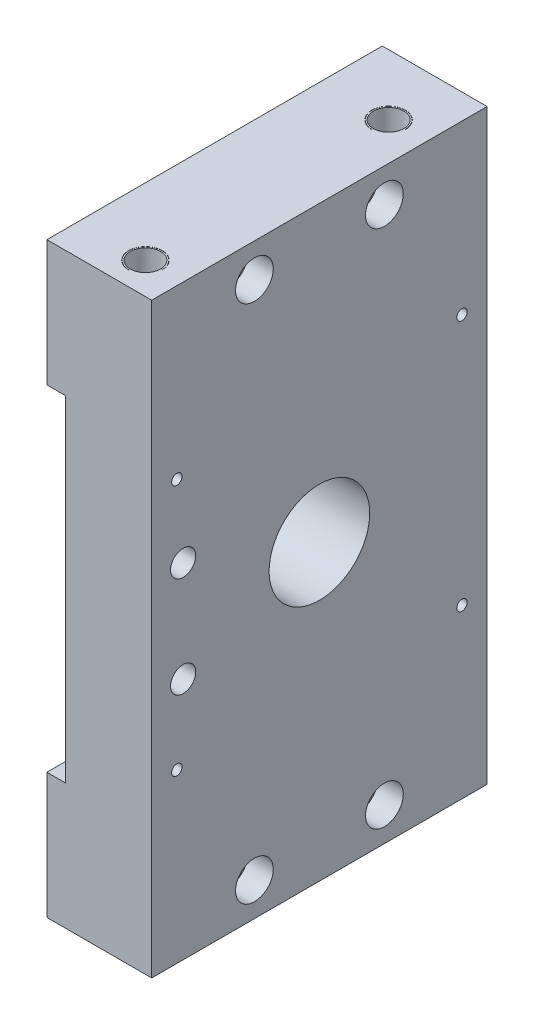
ISO-10303-21;
HEADER;
FILE_DESCRIPTION(('STEP AP214'),'2;1');
FILE_NAME('part.step','',(''),(''),'','','');
FILE_SCHEMA(('AUTOMOTIVE_DESIGN { 1 0 10303 214 1 1 1 1 }'));
ENDSEC;
DATA;
#1=APPLICATION_CONTEXT('core data for automotive mechanical design processes');
#2=APPLICATION_PROTOCOL_DEFINITION('international standard','automotive_design',2000,#1);
#3=PRODUCT_CONTEXT('',#1,'mechanical');
#4=PRODUCT('Part','Part','',(#3));
#5=PRODUCT_RELATED_PRODUCT_CATEGORY('part','',(#4));
#6=PRODUCT_DEFINITION_FORMATION('','',#4);
#7=PRODUCT_DEFINITION_CONTEXT('part definition',#1,'design');
#8=PRODUCT_DEFINITION('design','',#6,#7);
#9=PRODUCT_DEFINITION_SHAPE('','',#8);
#10=(LENGTH_UNIT() NAMED_UNIT(*) SI_UNIT(.MILLI.,.METRE.));
#11=(NAMED_UNIT(*) PLANE_ANGLE_UNIT() SI_UNIT($,.RADIAN.));
#12=(NAMED_UNIT(*) SI_UNIT($,.STERADIAN.) SOLID_ANGLE_UNIT());
#13=UNCERTAINTY_MEASURE_WITH_UNIT(LENGTH_MEASURE(1.E-05),#10,'distance_accuracy_value','');
#14=(GEOMETRIC_REPRESENTATION_CONTEXT(3) GLOBAL_UNCERTAINTY_ASSIGNED_CONTEXT((#13)) GLOBAL_UNIT_ASSIGNED_CONTEXT((#10,
#11,#12)) REPRESENTATION_CONTEXT('',''));
#15=CARTESIAN_POINT('',(0.,0.,0.));
#16=DIRECTION('',(0.,0.,1.));
#17=DIRECTION('',(1.,0.,0.));
#18=AXIS2_PLACEMENT_3D('',#15,#16,#17);
#19=CARTESIAN_POINT('',(0.,0.,0.));
#20=DIRECTION('',(1.,0.,0.));
#21=DIRECTION('',(0.,1.,0.));
#22=AXIS2_PLACEMENT_3D('',#19,#20,#21);
#23=PLANE('',#22);
#24=CARTESIAN_POINT('',(1.90819582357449E-13,30.,-34.));
#25=DIRECTION('',(-1.,0.,0.));
#26=DIRECTION('',(0.,0.,1.));
#27=AXIS2_PLACEMENT_3D('',#24,#25,#26);
#28=CIRCLE('',#27,1.25);
#29=CARTESIAN_POINT('',(1.90819582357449E-13,30.,-32.75));
#30=VERTEX_POINT('',#29);
#31=EDGE_CURVE('E2790',#30,#30,#28,.T.);
#32=ORIENTED_EDGE('',*,*,#31,.T.);
#33=EDGE_LOOP('',(#32));
#34=FACE_BOUND('',#33,.T.);
#35=CARTESIAN_POINT('',(1.94289029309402E-13,-30.,-34.));
#36=DIRECTION('',(-1.,0.,0.));
#37=DIRECTION('',(0.,0.,1.));
#38=AXIS2_PLACEMENT_3D('',#35,#36,#37);
#39=CIRCLE('',#38,1.25);
#40=CARTESIAN_POINT('',(1.94289029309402E-13,-30.,-32.75));
#41=VERTEX_POINT('',#40);
#42=EDGE_CURVE('E1038',#41,#41,#39,.T.);
#43=ORIENTED_EDGE('',*,*,#42,.T.);
#44=EDGE_LOOP('',(#43));
#45=FACE_BOUND('',#44,.T.);
#46=CARTESIAN_POINT('',(1.94289029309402E-13,-30.,34.));
#47=DIRECTION('',(-1.,0.,0.));
#48=DIRECTION('',(0.,0.,1.));
#49=AXIS2_PLACEMENT_3D('',#46,#47,#48);
#50=CIRCLE('',#49,1.25);
#51=CARTESIAN_POINT('',(1.94289029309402E-13,-30.,35.25));
#52=VERTEX_POINT('',#51);
#53=EDGE_CURVE('E670',#52,#52,#50,.T.);
#54=ORIENTED_EDGE('',*,*,#53,.T.);
#55=EDGE_LOOP('',(#54));
#56=FACE_BOUND('',#55,.T.);
#57=CARTESIAN_POINT('',(0.,0.,0.));
#58=DIRECTION('',(1.,0.,0.));
#59=DIRECTION('',(0.,1.,0.));
#60=AXIS2_PLACEMENT_3D('',#57,#58,#59);
#61=CIRCLE('',#60,12.);
#62=CARTESIAN_POINT('',(0.,12.,0.));
#63=VERTEX_POINT('',#62);
#64=EDGE_CURVE('E1046',#63,#63,#61,.T.);
#65=ORIENTED_EDGE('',*,*,#64,.F.);
#66=EDGE_LOOP('',(#65));
#67=FACE_BOUND('',#66,.T.);
#68=DIRECTION('',(0.,1.,0.));
#69=VECTOR('',#68,1.);
#70=CARTESIAN_POINT('',(0.,-70.,-40.0000000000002));
#71=LINE('',#70,#69);
#72=CARTESIAN_POINT('',(0.,-70.,-40.0000000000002));
#73=VERTEX_POINT('',#72);
#74=CARTESIAN_POINT('',(-1.87350135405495E-13,70.,-40.));
#75=VERTEX_POINT('',#74);
#76=EDGE_CURVE('E470',#73,#75,#71,.T.);
#77=ORIENTED_EDGE('',*,*,#76,.T.);
#78=DIRECTION('',(0.,0.,1.));
#79=VECTOR('',#78,1.);
#80=CARTESIAN_POINT('',(-1.87350135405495E-13,70.,-40.));
#81=LINE('',#80,#79);
#82=CARTESIAN_POINT('',(0.,70.,40.));
#83=VERTEX_POINT('',#82);
#84=EDGE_CURVE('E466',#75,#83,#81,.T.);
#85=ORIENTED_EDGE('',*,*,#84,.T.);
#86=DIRECTION('',(0.,-1.,0.));
#87=VECTOR('',#86,1.);
#88=CARTESIAN_POINT('',(0.,70.,40.));
#89=LINE('',#88,#87);
#90=CARTESIAN_POINT('',(1.87350135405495E-13,-70.,39.9999999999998));
#91=VERTEX_POINT('',#90);
#92=EDGE_CURVE('E463',#83,#91,#89,.T.);
#93=ORIENTED_EDGE('',*,*,#92,.T.);
#94=DIRECTION('',(0.,0.,-1.));
#95=VECTOR('',#94,1.);
#96=CARTESIAN_POINT('',(1.87350135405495E-13,-70.,39.9999999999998));
#97=LINE('',#96,#95);
#98=EDGE_CURVE('E467',#91,#73,#97,.T.);
#99=ORIENTED_EDGE('',*,*,#98,.T.);
#100=EDGE_LOOP('',(#77,#85,#93,#99));
#101=FACE_BOUND('',#100,.T.);
#102=CARTESIAN_POINT('',(0.,62.,-15.5));
#103=DIRECTION('',(-1.,0.,0.));
#104=DIRECTION('',(0.,-1.,0.));
#105=AXIS2_PLACEMENT_3D('',#102,#103,#104);
#106=CIRCLE('',#105,4.5);
#107=CARTESIAN_POINT('',(0.,57.5,-15.5));
#108=VERTEX_POINT('',#107);
#109=EDGE_CURVE('E505',#108,#108,#106,.T.);
#110=ORIENTED_EDGE('',*,*,#109,.T.);
#111=EDGE_LOOP('',(#110));
#112=FACE_BOUND('',#111,.T.);
#113=CARTESIAN_POINT('',(0.,62.,15.5));
#114=DIRECTION('',(-1.,0.,0.));
#115=DIRECTION('',(0.,-1.,0.));
#116=AXIS2_PLACEMENT_3D('',#113,#114,#115);
#117=CIRCLE('',#116,4.5);
#118=CARTESIAN_POINT('',(0.,57.5,15.5));
#119=VERTEX_POINT('',#118);
#120=EDGE_CURVE('E460',#119,#119,#117,.T.);
#121=ORIENTED_EDGE('',*,*,#120,.T.);
#122=EDGE_LOOP('',(#121));
#123=FACE_BOUND('',#122,.T.);
#124=CARTESIAN_POINT('',(0.,-62.,15.5));
#125=DIRECTION('',(-1.,0.,0.));
#126=DIRECTION('',(0.,-1.,0.));
#127=AXIS2_PLACEMENT_3D('',#124,#125,#126);
#128=CIRCLE('',#127,4.5);
#129=CARTESIAN_POINT('',(0.,-66.5,15.5));
#130=VERTEX_POINT('',#129);
#131=EDGE_CURVE('E457',#130,#130,#128,.T.);
#132=ORIENTED_EDGE('',*,*,#131,.T.);
#133=EDGE_LOOP('',(#132));
#134=FACE_BOUND('',#133,.T.);
#135=CARTESIAN_POINT('',(0.,-62.,-15.5));
#136=DIRECTION('',(-1.,0.,0.));
#137=DIRECTION('',(0.,-1.,0.));
#138=AXIS2_PLACEMENT_3D('',#135,#136,#137);
#139=CIRCLE('',#138,4.5);
#140=CARTESIAN_POINT('',(0.,-66.5,-15.5));
#141=VERTEX_POINT('',#140);
#142=EDGE_CURVE('E461',#141,#141,#139,.T.);
#143=ORIENTED_EDGE('',*,*,#142,.T.);
#144=EDGE_LOOP('',(#143));
#145=FACE_BOUND('',#144,.T.);
#146=CARTESIAN_POINT('',(0.,12.,32.5));
#147=DIRECTION('',(-1.,0.,0.));
#148=DIRECTION('',(0.,-1.,0.));
#149=AXIS2_PLACEMENT_3D('',#146,#147,#148);
#150=CIRCLE('',#149,3.);
#151=CARTESIAN_POINT('',(0.,9.,32.5));
#152=VERTEX_POINT('',#151);
#153=EDGE_CURVE('E581',#152,#152,#150,.T.);
#154=ORIENTED_EDGE('',*,*,#153,.T.);
#155=EDGE_LOOP('',(#154));
#156=FACE_BOUND('',#155,.T.);
#157=CARTESIAN_POINT('',(1.87350135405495E-13,-12.,32.5));
#158=DIRECTION('',(-1.,0.,0.));
#159=DIRECTION('',(0.,-1.,0.));
#160=AXIS2_PLACEMENT_3D('',#157,#158,#159);
#161=CIRCLE('',#160,3.);
#162=CARTESIAN_POINT('',(1.87533832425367E-13,-15.,32.5));
#163=VERTEX_POINT('',#162);
#164=EDGE_CURVE('E578',#163,#163,#161,.T.);
#165=ORIENTED_EDGE('',*,*,#164,.T.);
#166=EDGE_LOOP('',(#165));
#167=FACE_BOUND('',#166,.T.);
#168=CARTESIAN_POINT('',(1.90819582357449E-13,30.,34.));
#169=DIRECTION('',(-1.,0.,0.));
#170=DIRECTION('',(0.,0.,1.));
#171=AXIS2_PLACEMENT_3D('',#168,#169,#170);
#172=CIRCLE('',#171,1.25);
#173=CARTESIAN_POINT('',(1.90819582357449E-13,30.,35.25));
#174=VERTEX_POINT('',#173);
#175=EDGE_CURVE('E1027',#174,#174,#172,.T.);
#176=ORIENTED_EDGE('',*,*,#175,.T.);
#177=EDGE_LOOP('',(#176));
#178=FACE_BOUND('',#177,.T.);
#179=ADVANCED_FACE('F34',(#34,#45,#56,#67,#101,#112,#123,#134,#145,#156,#167,#178),#23,.T.);
#180=CARTESIAN_POINT('',(-25.,0.,0.));
#181=DIRECTION('',(-1.,0.,0.));
#182=DIRECTION('',(0.,-1.,0.));
#183=AXIS2_PLACEMENT_3D('',#180,#181,#182);
#184=PLANE('',#183);
#185=DIRECTION('',(0.,0.,-1.));
#186=VECTOR('',#185,1.);
#187=CARTESIAN_POINT('',(-25.,40.,-40.));
#188=LINE('',#187,#186);
#189=CARTESIAN_POINT('',(-25.,40.,40.));
#190=VERTEX_POINT('',#189);
#191=CARTESIAN_POINT('',(-25.,40.,-40.));
#192=VERTEX_POINT('',#191);
#193=EDGE_CURVE('E1055',#190,#192,#188,.T.);
#194=ORIENTED_EDGE('',*,*,#193,.F.);
#195=DIRECTION('',(0.,-1.,0.));
#196=VECTOR('',#195,1.);
#197=CARTESIAN_POINT('',(-25.0000000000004,70.,40.));
#198=LINE('',#197,#196);
#199=CARTESIAN_POINT('',(-25.0000000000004,70.,40.));
#200=VERTEX_POINT('',#199);
#201=EDGE_CURVE('E498',#200,#190,#198,.T.);
#202=ORIENTED_EDGE('',*,*,#201,.F.);
#203=DIRECTION('',(0.,0.,1.));
#204=VECTOR('',#203,1.);
#205=CARTESIAN_POINT('',(-25.,70.,-40.));
#206=LINE('',#205,#204);
#207=CARTESIAN_POINT('',(-25.,70.,-40.));
#208=VERTEX_POINT('',#207);
#209=EDGE_CURVE('E403',#208,#200,#206,.T.);
#210=ORIENTED_EDGE('',*,*,#209,.F.);
#211=DIRECTION('',(0.,1.,0.));
#212=VECTOR('',#211,1.);
#213=CARTESIAN_POINT('',(-24.9999999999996,-70.,-40.));
#214=LINE('',#213,#212);
#215=EDGE_CURVE('E65',#192,#208,#214,.T.);
#216=ORIENTED_EDGE('',*,*,#215,.F.);
#217=EDGE_LOOP('',(#194,#202,#210,#216));
#218=FACE_BOUND('',#217,.T.);
#219=CARTESIAN_POINT('',(-25.,61.9999999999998,15.5));
#220=DIRECTION('',(1.,0.,0.));
#221=DIRECTION('',(0.,-1.,0.));
#222=AXIS2_PLACEMENT_3D('',#219,#220,#221);
#223=CIRCLE('',#222,5.5);
#224=CARTESIAN_POINT('',(-25.,56.4999999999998,15.5));
#225=VERTEX_POINT('',#224);
#226=EDGE_CURVE('E48',#225,#225,#223,.T.);
#227=ORIENTED_EDGE('',*,*,#226,.T.);
#228=EDGE_LOOP('',(#227));
#229=FACE_BOUND('',#228,.T.);
#230=CARTESIAN_POINT('',(-25.,61.9999999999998,-15.5));
#231=DIRECTION('',(1.,0.,0.));
#232=DIRECTION('',(0.,-1.,0.));
#233=AXIS2_PLACEMENT_3D('',#230,#231,#232);
#234=CIRCLE('',#233,5.5);
#235=CARTESIAN_POINT('',(-25.,56.4999999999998,-15.5));
#236=VERTEX_POINT('',#235);
#237=EDGE_CURVE('E11',#236,#236,#234,.T.);
#238=ORIENTED_EDGE('',*,*,#237,.T.);
#239=EDGE_LOOP('',(#238));
#240=FACE_BOUND('',#239,.T.);
#241=ADVANCED_FACE('F708',(#218,#229,#240),#184,.T.);
#242=DIRECTION('',(0.,0.,1.));
#243=VECTOR('',#242,1.);
#244=CARTESIAN_POINT('',(-25.,-40.,-40.));
#245=LINE('',#244,#243);
#246=CARTESIAN_POINT('',(-25.,-40.,-40.));
#247=VERTEX_POINT('',#246);
#248=CARTESIAN_POINT('',(-25.,-40.,40.));
#249=VERTEX_POINT('',#248);
#250=EDGE_CURVE('E1049',#247,#249,#245,.T.);
#251=ORIENTED_EDGE('',*,*,#250,.F.);
#252=CARTESIAN_POINT('',(-24.9999999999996,-70.,-40.));
#253=VERTEX_POINT('',#252);
#254=EDGE_CURVE('E582',#253,#247,#214,.T.);
#255=ORIENTED_EDGE('',*,*,#254,.F.);
#256=DIRECTION('',(0.,0.,-1.));
#257=VECTOR('',#256,1.);
#258=CARTESIAN_POINT('',(-25.,-70.,40.));
#259=LINE('',#258,#257);
#260=CARTESIAN_POINT('',(-25.,-70.,40.));
#261=VERTEX_POINT('',#260);
#262=EDGE_CURVE('E356',#261,#253,#259,.T.);
#263=ORIENTED_EDGE('',*,*,#262,.F.);
#264=EDGE_CURVE('E502',#249,#261,#198,.T.);
#265=ORIENTED_EDGE('',*,*,#264,.F.);
#266=EDGE_LOOP('',(#251,#255,#263,#265));
#267=FACE_BOUND('',#266,.T.);
#268=CARTESIAN_POINT('',(-25.,-62.0000000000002,15.5));
#269=DIRECTION('',(1.,0.,0.));
#270=DIRECTION('',(0.,-1.,0.));
#271=AXIS2_PLACEMENT_3D('',#268,#269,#270);
#272=CIRCLE('',#271,5.5);
#273=CARTESIAN_POINT('',(-25.,-67.5000000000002,15.5));
#274=VERTEX_POINT('',#273);
#275=EDGE_CURVE('E1084',#274,#274,#272,.T.);
#276=ORIENTED_EDGE('',*,*,#275,.T.);
#277=EDGE_LOOP('',(#276));
#278=FACE_BOUND('',#277,.T.);
#279=CARTESIAN_POINT('',(-25.,-62.0000000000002,-15.5));
#280=DIRECTION('',(1.,0.,0.));
#281=DIRECTION('',(0.,-1.,0.));
#282=AXIS2_PLACEMENT_3D('',#279,#280,#281);
#283=CIRCLE('',#282,5.5);
#284=CARTESIAN_POINT('',(-25.,-67.5000000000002,-15.5));
#285=VERTEX_POINT('',#284);
#286=EDGE_CURVE('E1087',#285,#285,#283,.T.);
#287=ORIENTED_EDGE('',*,*,#286,.T.);
#288=EDGE_LOOP('',(#287));
#289=FACE_BOUND('',#288,.T.);
#290=ADVANCED_FACE('F704',(#267,#278,#289),#184,.T.);
#291=CARTESIAN_POINT('',(0.,-70.,-40.0000000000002));
#292=DIRECTION('',(0.,0.,-1.));
#293=DIRECTION('',(0.,1.,0.));
#294=AXIS2_PLACEMENT_3D('',#291,#292,#293);
#295=PLANE('',#294);
#296=DIRECTION('',(-1.,0.,0.));
#297=VECTOR('',#296,1.);
#298=CARTESIAN_POINT('',(-20.5,40.,-40.));
#299=LINE('',#298,#297);
#300=CARTESIAN_POINT('',(-20.5,40.,-40.));
#301=VERTEX_POINT('',#300);
#302=EDGE_CURVE('E1067',#301,#192,#299,.T.);
#303=ORIENTED_EDGE('',*,*,#302,.T.);
#304=ORIENTED_EDGE('',*,*,#215,.T.);
#305=DIRECTION('',(-1.,0.,0.));
#306=VECTOR('',#305,1.);
#307=CARTESIAN_POINT('',(-1.87350135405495E-13,70.,-40.));
#308=LINE('',#307,#306);
#309=EDGE_CURVE('E401',#75,#208,#308,.T.);
#310=ORIENTED_EDGE('',*,*,#309,.F.);
#311=ORIENTED_EDGE('',*,*,#76,.F.);
#312=DIRECTION('',(-1.,0.,0.));
#313=VECTOR('',#312,1.);
#314=CARTESIAN_POINT('',(0.,-70.,-40.0000000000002));
#315=LINE('',#314,#313);
#316=EDGE_CURVE('E652',#73,#253,#315,.T.);
#317=ORIENTED_EDGE('',*,*,#316,.T.);
#318=ORIENTED_EDGE('',*,*,#254,.T.);
#319=DIRECTION('',(-1.,0.,0.));
#320=VECTOR('',#319,1.);
#321=CARTESIAN_POINT('',(-20.5,-40.,-40.));
#322=LINE('',#321,#320);
#323=CARTESIAN_POINT('',(-20.5,-40.,-40.));
#324=VERTEX_POINT('',#323);
#325=EDGE_CURVE('E1062',#324,#247,#322,.T.);
#326=ORIENTED_EDGE('',*,*,#325,.F.);
#327=DIRECTION('',(0.,-1.,0.));
#328=VECTOR('',#327,1.);
#329=CARTESIAN_POINT('',(-20.5,40.,-40.));
#330=LINE('',#329,#328);
#331=EDGE_CURVE('E1053',#301,#324,#330,.T.);
#332=ORIENTED_EDGE('',*,*,#331,.F.);
#333=EDGE_LOOP('',(#303,#304,#310,#311,#317,#318,#326,#332));
#334=FACE_BOUND('',#333,.T.);
#335=CARTESIAN_POINT('',(-9.,52.,-40.));
#336=DIRECTION('',(0.,0.,1.));
#337=DIRECTION('',(0.,-1.,0.));
#338=AXIS2_PLACEMENT_3D('',#335,#336,#337);
#339=CIRCLE('',#338,3.625);
#340=CARTESIAN_POINT('',(-9.,48.375,-40.));
#341=VERTEX_POINT('',#340);
#342=EDGE_CURVE('E604',#341,#341,#339,.T.);
#343=ORIENTED_EDGE('',*,*,#342,.T.);
#344=EDGE_LOOP('',(#343));
#345=FACE_BOUND('',#344,.T.);
#346=CARTESIAN_POINT('',(-9.,52.,-40.));
#347=DIRECTION('',(0.,0.,-1.));
#348=DIRECTION('',(1.,0.,0.));
#349=AXIS2_PLACEMENT_3D('',#346,#347,#348);
#350=CIRCLE('',#349,3.95);
#351=CARTESIAN_POINT('',(-9.,48.05,-40.));
#352=VERTEX_POINT('',#351);
#353=CARTESIAN_POINT('',(-5.05,52.,-40.));
#354=VERTEX_POINT('',#353);
#355=EDGE_CURVE('E602',#352,#354,#350,.T.);
#356=ORIENTED_EDGE('',*,*,#355,.T.);
#357=DIRECTION('',(1.,0.,0.));
#358=VECTOR('',#357,1.);
#359=CARTESIAN_POINT('',(-2.5125,52.,-40.));
#360=LINE('',#359,#358);
#361=CARTESIAN_POINT('',(-5.,52.,-40.));
#362=VERTEX_POINT('',#361);
#363=EDGE_CURVE('E527',#354,#362,#360,.T.);
#364=ORIENTED_EDGE('',*,*,#363,.T.);
#365=CARTESIAN_POINT('',(-9.,52.,-40.));
#366=DIRECTION('',(0.,0.,1.));
#367=DIRECTION('',(1.,0.,0.));
#368=AXIS2_PLACEMENT_3D('',#365,#366,#367);
#369=CIRCLE('',#368,4.);
#370=CARTESIAN_POINT('',(-9.,48.,-40.));
#371=VERTEX_POINT('',#370);
#372=EDGE_CURVE('E521',#362,#371,#369,.T.);
#373=ORIENTED_EDGE('',*,*,#372,.T.);
#374=DIRECTION('',(0.,1.,0.));
#375=VECTOR('',#374,1.);
#376=CARTESIAN_POINT('',(-9.,-10.9875,-40.));
#377=LINE('',#376,#375);
#378=EDGE_CURVE('E528',#371,#352,#377,.T.);
#379=ORIENTED_EDGE('',*,*,#378,.T.);
#380=EDGE_LOOP('',(#356,#364,#373,#379));
#381=FACE_BOUND('',#380,.T.);
#382=CARTESIAN_POINT('',(-9.,-52.,-40.));
#383=DIRECTION('',(0.,0.,1.));
#384=DIRECTION('',(0.,-1.,0.));
#385=AXIS2_PLACEMENT_3D('',#382,#383,#384);
#386=CIRCLE('',#385,3.625);
#387=CARTESIAN_POINT('',(-9.,-55.625,-40.));
#388=VERTEX_POINT('',#387);
#389=EDGE_CURVE('E1214',#388,#388,#386,.T.);
#390=ORIENTED_EDGE('',*,*,#389,.T.);
#391=EDGE_LOOP('',(#390));
#392=FACE_BOUND('',#391,.T.);
#393=CARTESIAN_POINT('',(-9.,-52.,-40.));
#394=DIRECTION('',(0.,0.,-1.));
#395=DIRECTION('',(1.,0.,0.));
#396=AXIS2_PLACEMENT_3D('',#393,#394,#395);
#397=CIRCLE('',#396,3.95);
#398=CARTESIAN_POINT('',(-9.,-55.95,-40.));
#399=VERTEX_POINT('',#398);
#400=CARTESIAN_POINT('',(-5.05,-52.,-40.0000000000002));
#401=VERTEX_POINT('',#400);
#402=EDGE_CURVE('E648',#399,#401,#397,.T.);
#403=ORIENTED_EDGE('',*,*,#402,.T.);
#404=DIRECTION('',(1.,0.,0.));
#405=VECTOR('',#404,1.);
#406=CARTESIAN_POINT('',(-2.5125,-52.,-40.));
#407=LINE('',#406,#405);
#408=CARTESIAN_POINT('',(-5.,-52.,-40.0000000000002));
#409=VERTEX_POINT('',#408);
#410=EDGE_CURVE('E645',#401,#409,#407,.T.);
#411=ORIENTED_EDGE('',*,*,#410,.T.);
#412=CARTESIAN_POINT('',(-9.,-52.,-40.));
#413=DIRECTION('',(0.,0.,1.));
#414=DIRECTION('',(1.,0.,0.));
#415=AXIS2_PLACEMENT_3D('',#412,#413,#414);
#416=CIRCLE('',#415,4.);
#417=CARTESIAN_POINT('',(-9.,-56.,-40.));
#418=VERTEX_POINT('',#417);
#419=EDGE_CURVE('E383',#409,#418,#416,.T.);
#420=ORIENTED_EDGE('',*,*,#419,.T.);
#421=DIRECTION('',(0.,1.,0.));
#422=VECTOR('',#421,1.);
#423=CARTESIAN_POINT('',(-9.,-62.9875,-40.));
#424=LINE('',#423,#422);
#425=EDGE_CURVE('E377',#418,#399,#424,.T.);
#426=ORIENTED_EDGE('',*,*,#425,.T.);
#427=EDGE_LOOP('',(#403,#411,#420,#426));
#428=FACE_BOUND('',#427,.T.);
#429=ADVANCED_FACE('F707',(#334,#345,#381,#392,#428),#295,.T.);
#430=CARTESIAN_POINT('',(1.87350135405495E-13,-70.,39.9999999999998));
#431=DIRECTION('',(0.,-1.,0.));
#432=DIRECTION('',(0.,0.,-1.));
#433=AXIS2_PLACEMENT_3D('',#430,#431,#432);
#434=PLANE('',#433);
#435=ORIENTED_EDGE('',*,*,#262,.T.);
#436=ORIENTED_EDGE('',*,*,#316,.F.);
#437=ORIENTED_EDGE('',*,*,#98,.F.);
#438=DIRECTION('',(-1.,0.,0.));
#439=VECTOR('',#438,1.);
#440=CARTESIAN_POINT('',(1.87350135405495E-13,-70.,39.9999999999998));
#441=LINE('',#440,#439);
#442=EDGE_CURVE('E350',#91,#261,#441,.T.);
#443=ORIENTED_EDGE('',*,*,#442,.T.);
#444=EDGE_LOOP('',(#435,#436,#437,#443));
#445=FACE_BOUND('',#444,.T.);
#446=CARTESIAN_POINT('',(-8.99999999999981,-70.,32.5));
#447=DIRECTION('',(0.,1.,0.));
#448=DIRECTION('',(-1.,0.,0.));
#449=AXIS2_PLACEMENT_3D('',#446,#447,#448);
#450=CIRCLE('',#449,3.625);
#451=CARTESIAN_POINT('',(-12.6249999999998,-70.,32.5));
#452=VERTEX_POINT('',#451);
#453=EDGE_CURVE('E357',#452,#452,#450,.T.);
#454=ORIENTED_EDGE('',*,*,#453,.T.);
#455=EDGE_LOOP('',(#454));
#456=FACE_BOUND('',#455,.T.);
#457=CARTESIAN_POINT('',(-8.99999999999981,-70.,32.5));
#458=DIRECTION('',(0.,-1.,0.));
#459=DIRECTION('',(0.,0.,1.));
#460=AXIS2_PLACEMENT_3D('',#457,#458,#459);
#461=CIRCLE('',#460,3.95);
#462=CARTESIAN_POINT('',(-12.9499999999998,-70.,32.5));
#463=VERTEX_POINT('',#462);
#464=CARTESIAN_POINT('',(-8.99999999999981,-70.,36.45));
#465=VERTEX_POINT('',#464);
#466=EDGE_CURVE('E638',#463,#465,#461,.T.);
#467=ORIENTED_EDGE('',*,*,#466,.T.);
#468=DIRECTION('',(0.,0.,1.));
#469=VECTOR('',#468,1.);
#470=CARTESIAN_POINT('',(-8.99999999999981,-70.,38.2375));
#471=LINE('',#470,#469);
#472=CARTESIAN_POINT('',(-8.99999999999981,-70.,36.5));
#473=VERTEX_POINT('',#472);
#474=EDGE_CURVE('E635',#465,#473,#471,.T.);
#475=ORIENTED_EDGE('',*,*,#474,.T.);
#476=CARTESIAN_POINT('',(-8.99999999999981,-70.,32.5));
#477=DIRECTION('',(0.,1.,0.));
#478=DIRECTION('',(0.,0.,1.));
#479=AXIS2_PLACEMENT_3D('',#476,#477,#478);
#480=CIRCLE('',#479,4.);
#481=CARTESIAN_POINT('',(-12.9999999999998,-70.,32.5));
#482=VERTEX_POINT('',#481);
#483=EDGE_CURVE('E639',#473,#482,#480,.T.);
#484=ORIENTED_EDGE('',*,*,#483,.T.);
#485=DIRECTION('',(1.,0.,0.));
#486=VECTOR('',#485,1.);
#487=CARTESIAN_POINT('',(-6.48749999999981,-70.,32.5));
#488=LINE('',#487,#486);
#489=EDGE_CURVE('E1174',#482,#463,#488,.T.);
#490=ORIENTED_EDGE('',*,*,#489,.T.);
#491=EDGE_LOOP('',(#467,#475,#484,#490));
#492=FACE_BOUND('',#491,.T.);
#493=CARTESIAN_POINT('',(-8.99999999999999,-70.,-25.5000000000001));
#494=DIRECTION('',(0.,1.,0.));
#495=DIRECTION('',(-1.,0.,0.));
#496=AXIS2_PLACEMENT_3D('',#493,#494,#495);
#497=CIRCLE('',#496,3.625);
#498=CARTESIAN_POINT('',(-12.625,-70.,-25.5000000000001));
#499=VERTEX_POINT('',#498);
#500=EDGE_CURVE('E1201',#499,#499,#497,.T.);
#501=ORIENTED_EDGE('',*,*,#500,.T.);
#502=EDGE_LOOP('',(#501));
#503=FACE_BOUND('',#502,.T.);
#504=DIRECTION('',(1.,0.,0.));
#505=VECTOR('',#504,1.);
#506=CARTESIAN_POINT('',(-6.4875,-70.,-25.5));
#507=LINE('',#506,#505);
#508=CARTESIAN_POINT('',(-13.,-70.,-25.5));
#509=VERTEX_POINT('',#508);
#510=CARTESIAN_POINT('',(-12.95,-70.,-25.5));
#511=VERTEX_POINT('',#510);
#512=EDGE_CURVE('E501',#509,#511,#507,.T.);
#513=ORIENTED_EDGE('',*,*,#512,.T.);
#514=CARTESIAN_POINT('',(-9.,-70.,-25.5000000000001));
#515=DIRECTION('',(0.,-1.,0.));
#516=DIRECTION('',(0.,0.,1.));
#517=AXIS2_PLACEMENT_3D('',#514,#515,#516);
#518=CIRCLE('',#517,3.95);
#519=CARTESIAN_POINT('',(-8.99999999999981,-70.,-21.5500000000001));
#520=VERTEX_POINT('',#519);
#521=EDGE_CURVE('E1253',#511,#520,#518,.T.);
#522=ORIENTED_EDGE('',*,*,#521,.T.);
#523=DIRECTION('',(0.,0.,1.));
#524=VECTOR('',#523,1.);
#525=CARTESIAN_POINT('',(-9.,-70.,9.2375));
#526=LINE('',#525,#524);
#527=CARTESIAN_POINT('',(-8.99999999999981,-70.,-21.5000000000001));
#528=VERTEX_POINT('',#527);
#529=EDGE_CURVE('E1251',#520,#528,#526,.T.);
#530=ORIENTED_EDGE('',*,*,#529,.T.);
#531=CARTESIAN_POINT('',(-9.,-70.,-25.5000000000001));
#532=DIRECTION('',(0.,1.,0.));
#533=DIRECTION('',(0.,0.,1.));
#534=AXIS2_PLACEMENT_3D('',#531,#532,#533);
#535=CIRCLE('',#534,4.);
#536=EDGE_CURVE('E307',#528,#509,#535,.T.);
#537=ORIENTED_EDGE('',*,*,#536,.T.);
#538=EDGE_LOOP('',(#513,#522,#530,#537));
#539=FACE_BOUND('',#538,.T.);
#540=ADVANCED_FACE('F715',(#445,#456,#492,#503,#539),#434,.T.);
#541=CARTESIAN_POINT('',(0.,70.,40.));
#542=DIRECTION('',(0.,0.,1.));
#543=DIRECTION('',(0.,-1.,0.));
#544=AXIS2_PLACEMENT_3D('',#541,#542,#543);
#545=PLANE('',#544);
#546=DIRECTION('',(-1.,0.,0.));
#547=VECTOR('',#546,1.);
#548=CARTESIAN_POINT('',(-20.5,40.,40.));
#549=LINE('',#548,#547);
#550=CARTESIAN_POINT('',(-20.5,40.,40.));
#551=VERTEX_POINT('',#550);
#552=EDGE_CURVE('E1070',#551,#190,#549,.T.);
#553=ORIENTED_EDGE('',*,*,#552,.F.);
#554=DIRECTION('',(0.,1.,0.));
#555=VECTOR('',#554,1.);
#556=CARTESIAN_POINT('',(-20.5,40.,40.));
#557=LINE('',#556,#555);
#558=CARTESIAN_POINT('',(-20.5,-40.,40.));
#559=VERTEX_POINT('',#558);
#560=EDGE_CURVE('E1057',#559,#551,#557,.T.);
#561=ORIENTED_EDGE('',*,*,#560,.F.);
#562=DIRECTION('',(-1.,0.,0.));
#563=VECTOR('',#562,1.);
#564=CARTESIAN_POINT('',(-20.5,-40.,40.));
#565=LINE('',#564,#563);
#566=EDGE_CURVE('E1073',#559,#249,#565,.T.);
#567=ORIENTED_EDGE('',*,*,#566,.T.);
#568=ORIENTED_EDGE('',*,*,#264,.T.);
#569=ORIENTED_EDGE('',*,*,#442,.F.);
#570=ORIENTED_EDGE('',*,*,#92,.F.);
#571=DIRECTION('',(-1.,0.,0.));
#572=VECTOR('',#571,1.);
#573=CARTESIAN_POINT('',(0.,70.,40.));
#574=LINE('',#573,#572);
#575=EDGE_CURVE('E625',#83,#200,#574,.T.);
#576=ORIENTED_EDGE('',*,*,#575,.T.);
#577=ORIENTED_EDGE('',*,*,#201,.T.);
#578=EDGE_LOOP('',(#553,#561,#567,#568,#569,#570,#576,#577));
#579=FACE_BOUND('',#578,.T.);
#580=ADVANCED_FACE('F718',(#579),#545,.T.);
#581=CARTESIAN_POINT('',(-1.87350135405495E-13,70.,-40.));
#582=DIRECTION('',(0.,1.,0.));
#583=DIRECTION('',(0.,0.,1.));
#584=AXIS2_PLACEMENT_3D('',#581,#582,#583);
#585=PLANE('',#584);
#586=ORIENTED_EDGE('',*,*,#209,.T.);
#587=ORIENTED_EDGE('',*,*,#575,.F.);
#588=ORIENTED_EDGE('',*,*,#84,.F.);
#589=ORIENTED_EDGE('',*,*,#309,.T.);
#590=EDGE_LOOP('',(#586,#587,#588,#589));
#591=FACE_BOUND('',#590,.T.);
#592=CARTESIAN_POINT('',(-9.00000000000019,70.,-25.5));
#593=DIRECTION('',(0.,-1.,0.));
#594=DIRECTION('',(1.,0.,0.));
#595=AXIS2_PLACEMENT_3D('',#592,#593,#594);
#596=CIRCLE('',#595,3.625);
#597=CARTESIAN_POINT('',(-5.37500000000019,70.,-25.5));
#598=VERTEX_POINT('',#597);
#599=EDGE_CURVE('E404',#598,#598,#596,.T.);
#600=ORIENTED_EDGE('',*,*,#599,.T.);
#601=EDGE_LOOP('',(#600));
#602=FACE_BOUND('',#601,.T.);
#603=DIRECTION('',(-1.,0.,0.));
#604=VECTOR('',#603,1.);
#605=CARTESIAN_POINT('',(-2.5125000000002,70.,-25.5));
#606=LINE('',#605,#604);
#607=CARTESIAN_POINT('',(-5.00000000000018,70.,-25.5));
#608=VERTEX_POINT('',#607);
#609=CARTESIAN_POINT('',(-5.05000000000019,70.,-25.5));
#610=VERTEX_POINT('',#609);
#611=EDGE_CURVE('E495',#608,#610,#606,.T.);
#612=ORIENTED_EDGE('',*,*,#611,.T.);
#613=CARTESIAN_POINT('',(-9.00000000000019,70.,-25.5));
#614=DIRECTION('',(0.,1.,0.));
#615=DIRECTION('',(0.,0.,1.));
#616=AXIS2_PLACEMENT_3D('',#613,#614,#615);
#617=CIRCLE('',#616,3.95);
#618=CARTESIAN_POINT('',(-9.,70.,-21.55));
#619=VERTEX_POINT('',#618);
#620=EDGE_CURVE('E421',#610,#619,#617,.T.);
#621=ORIENTED_EDGE('',*,*,#620,.T.);
#622=DIRECTION('',(0.,0.,1.));
#623=VECTOR('',#622,1.);
#624=CARTESIAN_POINT('',(-9.00000000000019,70.,-30.7625));
#625=LINE('',#624,#623);
#626=CARTESIAN_POINT('',(-9.,70.,-21.5));
#627=VERTEX_POINT('',#626);
#628=EDGE_CURVE('E480',#619,#627,#625,.T.);
#629=ORIENTED_EDGE('',*,*,#628,.T.);
#630=CARTESIAN_POINT('',(-9.00000000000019,70.,-25.5));
#631=DIRECTION('',(0.,-1.,0.));
#632=DIRECTION('',(0.,0.,1.));
#633=AXIS2_PLACEMENT_3D('',#630,#631,#632);
#634=CIRCLE('',#633,4.);
#635=EDGE_CURVE('E483',#627,#608,#634,.T.);
#636=ORIENTED_EDGE('',*,*,#635,.T.);
#637=EDGE_LOOP('',(#612,#621,#629,#636));
#638=FACE_BOUND('',#637,.T.);
#639=CARTESIAN_POINT('',(-9.,70.,32.5));
#640=DIRECTION('',(0.,-1.,0.));
#641=DIRECTION('',(1.,0.,0.));
#642=AXIS2_PLACEMENT_3D('',#639,#640,#641);
#643=CIRCLE('',#642,3.625);
#644=CARTESIAN_POINT('',(-5.375,70.,32.5));
#645=VERTEX_POINT('',#644);
#646=EDGE_CURVE('E425',#645,#645,#643,.T.);
#647=ORIENTED_EDGE('',*,*,#646,.T.);
#648=EDGE_LOOP('',(#647));
#649=FACE_BOUND('',#648,.T.);
#650=DIRECTION('',(-1.,0.,0.));
#651=VECTOR('',#650,1.);
#652=CARTESIAN_POINT('',(-2.51250000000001,70.,32.5));
#653=LINE('',#652,#651);
#654=CARTESIAN_POINT('',(-5.,70.,32.4999999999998));
#655=VERTEX_POINT('',#654);
#656=CARTESIAN_POINT('',(-5.05,70.,32.4999999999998));
#657=VERTEX_POINT('',#656);
#658=EDGE_CURVE('E413',#655,#657,#653,.T.);
#659=ORIENTED_EDGE('',*,*,#658,.T.);
#660=CARTESIAN_POINT('',(-9.,70.,32.5));
#661=DIRECTION('',(0.,1.,0.));
#662=DIRECTION('',(0.,0.,1.));
#663=AXIS2_PLACEMENT_3D('',#660,#661,#662);
#664=CIRCLE('',#663,3.95);
#665=CARTESIAN_POINT('',(-9.,70.,36.45));
#666=VERTEX_POINT('',#665);
#667=EDGE_CURVE('E422',#657,#666,#664,.T.);
#668=ORIENTED_EDGE('',*,*,#667,.T.);
#669=DIRECTION('',(0.,0.,1.));
#670=VECTOR('',#669,1.);
#671=CARTESIAN_POINT('',(-9.00000000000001,70.,-1.76250000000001));
#672=LINE('',#671,#670);
#673=CARTESIAN_POINT('',(-9.,70.,36.5));
#674=VERTEX_POINT('',#673);
#675=EDGE_CURVE('E426',#666,#674,#672,.T.);
#676=ORIENTED_EDGE('',*,*,#675,.T.);
#677=CARTESIAN_POINT('',(-9.,70.,32.5));
#678=DIRECTION('',(0.,-1.,0.));
#679=DIRECTION('',(0.,0.,1.));
#680=AXIS2_PLACEMENT_3D('',#677,#678,#679);
#681=CIRCLE('',#680,4.);
#682=EDGE_CURVE('E496',#674,#655,#681,.T.);
#683=ORIENTED_EDGE('',*,*,#682,.T.);
#684=EDGE_LOOP('',(#659,#668,#676,#683));
#685=FACE_BOUND('',#684,.T.);
#686=ADVANCED_FACE('F722',(#591,#602,#638,#649,#685),#585,.T.);
#687=CARTESIAN_POINT('',(-12.5,62.,-15.5));
#688=DIRECTION('',(1.,0.,0.));
#689=DIRECTION('',(0.,0.,-1.));
#690=AXIS2_PLACEMENT_3D('',#687,#688,#689);
#691=CYLINDRICAL_SURFACE('',#690,3.375);
#692=CARTESIAN_POINT('',(-18.1,61.9999999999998,-15.5));
#693=DIRECTION('',(-1.,0.,0.));
#694=DIRECTION('',(0.,-1.,0.));
#695=AXIS2_PLACEMENT_3D('',#692,#693,#694);
#696=CIRCLE('',#695,3.375);
#697=CARTESIAN_POINT('',(-18.1,58.6249999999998,-15.5));
#698=VERTEX_POINT('',#697);
#699=EDGE_CURVE('E1141',#698,#698,#696,.T.);
#700=ORIENTED_EDGE('',*,*,#699,.T.);
#701=EDGE_LOOP('',(#700));
#702=FACE_BOUND('',#701,.T.);
#703=CARTESIAN_POINT('',(-6.09999999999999,62.,-15.5));
#704=DIRECTION('',(1.,0.,0.));
#705=DIRECTION('',(0.,-1.,0.));
#706=AXIS2_PLACEMENT_3D('',#703,#704,#705);
#707=CIRCLE('',#706,3.375);
#708=CARTESIAN_POINT('',(-6.09999999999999,58.625,-15.5));
#709=VERTEX_POINT('',#708);
#710=EDGE_CURVE('E1069',#709,#709,#707,.T.);
#711=ORIENTED_EDGE('',*,*,#710,.T.);
#712=EDGE_LOOP('',(#711));
#713=FACE_BOUND('',#712,.T.);
#714=ADVANCED_FACE('F726',(#702,#713),#691,.F.);
#715=CARTESIAN_POINT('',(-12.5,58.025,-15.5));
#716=DIRECTION('',(0.,0.,-1.));
#717=DIRECTION('',(-1.,0.,0.));
#718=AXIS2_PLACEMENT_3D('',#715,#716,#717);
#719=PLANE('',#718);
#720=DIRECTION('',(0.,1.,0.));
#721=VECTOR('',#720,1.);
#722=CARTESIAN_POINT('',(-18.1,60.0124999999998,-15.5));
#723=LINE('',#722,#721);
#724=CARTESIAN_POINT('',(-18.1,57.9999999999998,-15.5));
#725=VERTEX_POINT('',#724);
#726=CARTESIAN_POINT('',(-18.1,58.0499999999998,-15.5));
#727=VERTEX_POINT('',#726);
#728=EDGE_CURVE('E410',#725,#727,#723,.T.);
#729=ORIENTED_EDGE('',*,*,#728,.T.);
#730=DIRECTION('',(1.,0.,0.));
#731=VECTOR('',#730,1.);
#732=CARTESIAN_POINT('',(0.,58.05,-15.5));
#733=LINE('',#732,#731);
#734=CARTESIAN_POINT('',(-6.09999999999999,58.05,-15.5));
#735=VERTEX_POINT('',#734);
#736=EDGE_CURVE('E408',#727,#735,#733,.T.);
#737=ORIENTED_EDGE('',*,*,#736,.T.);
#738=DIRECTION('',(0.,-1.,0.));
#739=VECTOR('',#738,1.);
#740=CARTESIAN_POINT('',(-6.09999999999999,60.0125,-15.5));
#741=LINE('',#740,#739);
#742=CARTESIAN_POINT('',(-6.10000000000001,58.,-15.5));
#743=VERTEX_POINT('',#742);
#744=EDGE_CURVE('E405',#735,#743,#741,.T.);
#745=ORIENTED_EDGE('',*,*,#744,.T.);
#746=DIRECTION('',(-1.,0.,0.));
#747=VECTOR('',#746,1.);
#748=CARTESIAN_POINT('',(-25.,57.9999999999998,-15.5));
#749=LINE('',#748,#747);
#750=EDGE_CURVE('E409',#743,#725,#749,.T.);
#751=ORIENTED_EDGE('',*,*,#750,.T.);
#752=EDGE_LOOP('',(#729,#737,#745,#751));
#753=FACE_BOUND('',#752,.T.);
#754=ADVANCED_FACE('F728',(#753),#719,.T.);
#755=CARTESIAN_POINT('',(-12.5,62.,15.5));
#756=DIRECTION('',(1.,0.,0.));
#757=DIRECTION('',(0.,0.,-1.));
#758=AXIS2_PLACEMENT_3D('',#755,#756,#757);
#759=CYLINDRICAL_SURFACE('',#758,3.375);
#760=CARTESIAN_POINT('',(-18.1,61.9999999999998,15.5));
#761=DIRECTION('',(-1.,0.,0.));
#762=DIRECTION('',(0.,-1.,0.));
#763=AXIS2_PLACEMENT_3D('',#760,#761,#762);
#764=CIRCLE('',#763,3.375);
#765=CARTESIAN_POINT('',(-18.1,58.6249999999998,15.5));
#766=VERTEX_POINT('',#765);
#767=EDGE_CURVE('E616',#766,#766,#764,.T.);
#768=ORIENTED_EDGE('',*,*,#767,.T.);
#769=EDGE_LOOP('',(#768));
#770=FACE_BOUND('',#769,.T.);
#771=CARTESIAN_POINT('',(-6.10000000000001,62.,15.5));
#772=DIRECTION('',(1.,0.,0.));
#773=DIRECTION('',(0.,-1.,0.));
#774=AXIS2_PLACEMENT_3D('',#771,#772,#773);
#775=CIRCLE('',#774,3.375);
#776=CARTESIAN_POINT('',(-6.10000000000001,58.625,15.5));
#777=VERTEX_POINT('',#776);
#778=EDGE_CURVE('E618',#777,#777,#775,.T.);
#779=ORIENTED_EDGE('',*,*,#778,.T.);
#780=EDGE_LOOP('',(#779));
#781=FACE_BOUND('',#780,.T.);
#782=ADVANCED_FACE('F731',(#770,#781),#759,.F.);
#783=CARTESIAN_POINT('',(-12.5,58.025,15.5));
#784=DIRECTION('',(0.,0.,-1.));
#785=DIRECTION('',(-1.,0.,0.));
#786=AXIS2_PLACEMENT_3D('',#783,#784,#785);
#787=PLANE('',#786);
#788=DIRECTION('',(0.,1.,0.));
#789=VECTOR('',#788,1.);
#790=CARTESIAN_POINT('',(-18.1,60.0124999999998,15.5));
#791=LINE('',#790,#789);
#792=CARTESIAN_POINT('',(-18.1,57.9999999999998,15.5));
#793=VERTEX_POINT('',#792);
#794=CARTESIAN_POINT('',(-18.1,58.0499999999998,15.5));
#795=VERTEX_POINT('',#794);
#796=EDGE_CURVE('E452',#793,#795,#791,.T.);
#797=ORIENTED_EDGE('',*,*,#796,.T.);
#798=DIRECTION('',(1.,0.,0.));
#799=VECTOR('',#798,1.);
#800=CARTESIAN_POINT('',(0.,58.05,15.5));
#801=LINE('',#800,#799);
#802=CARTESIAN_POINT('',(-6.1,58.05,15.5));
#803=VERTEX_POINT('',#802);
#804=EDGE_CURVE('E449',#795,#803,#801,.T.);
#805=ORIENTED_EDGE('',*,*,#804,.T.);
#806=DIRECTION('',(0.,-1.,0.));
#807=VECTOR('',#806,1.);
#808=CARTESIAN_POINT('',(-6.10000000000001,60.0125,15.5));
#809=LINE('',#808,#807);
#810=CARTESIAN_POINT('',(-6.10000000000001,58.,15.5));
#811=VERTEX_POINT('',#810);
#812=EDGE_CURVE('E453',#803,#811,#809,.T.);
#813=ORIENTED_EDGE('',*,*,#812,.T.);
#814=DIRECTION('',(-1.,0.,0.));
#815=VECTOR('',#814,1.);
#816=CARTESIAN_POINT('',(-25.,57.9999999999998,15.5));
#817=LINE('',#816,#815);
#818=EDGE_CURVE('E1194',#811,#793,#817,.T.);
#819=ORIENTED_EDGE('',*,*,#818,.T.);
#820=EDGE_LOOP('',(#797,#805,#813,#819));
#821=FACE_BOUND('',#820,.T.);
#822=ADVANCED_FACE('F733',(#821),#787,.T.);
#823=CARTESIAN_POINT('',(-12.5,-62.,15.5));
#824=DIRECTION('',(1.,0.,0.));
#825=DIRECTION('',(0.,0.,-1.));
#826=AXIS2_PLACEMENT_3D('',#823,#824,#825);
#827=CYLINDRICAL_SURFACE('',#826,3.375);
#828=CARTESIAN_POINT('',(-18.1,-62.0000000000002,15.5));
#829=DIRECTION('',(-1.,0.,0.));
#830=DIRECTION('',(0.,-1.,0.));
#831=AXIS2_PLACEMENT_3D('',#828,#829,#830);
#832=CIRCLE('',#831,3.375);
#833=CARTESIAN_POINT('',(-18.1,-65.3750000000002,15.5));
#834=VERTEX_POINT('',#833);
#835=EDGE_CURVE('E1137',#834,#834,#832,.T.);
#836=ORIENTED_EDGE('',*,*,#835,.T.);
#837=EDGE_LOOP('',(#836));
#838=FACE_BOUND('',#837,.T.);
#839=CARTESIAN_POINT('',(-6.1,-62.,15.5));
#840=DIRECTION('',(1.,0.,0.));
#841=DIRECTION('',(0.,-1.,0.));
#842=AXIS2_PLACEMENT_3D('',#839,#840,#841);
#843=CIRCLE('',#842,3.375);
#844=CARTESIAN_POINT('',(-6.1,-65.375,15.5));
#845=VERTEX_POINT('',#844);
#846=EDGE_CURVE('E555',#845,#845,#843,.T.);
#847=ORIENTED_EDGE('',*,*,#846,.T.);
#848=EDGE_LOOP('',(#847));
#849=FACE_BOUND('',#848,.T.);
#850=ADVANCED_FACE('F736',(#838,#849),#827,.F.);
#851=CARTESIAN_POINT('',(-12.5,-65.975,15.5));
#852=DIRECTION('',(0.,0.,-1.));
#853=DIRECTION('',(-1.,0.,0.));
#854=AXIS2_PLACEMENT_3D('',#851,#852,#853);
#855=PLANE('',#854);
#856=DIRECTION('',(0.,1.,0.));
#857=VECTOR('',#856,1.);
#858=CARTESIAN_POINT('',(-18.1,-63.9875,15.5));
#859=LINE('',#858,#857);
#860=CARTESIAN_POINT('',(-18.1,-66.,15.5));
#861=VERTEX_POINT('',#860);
#862=CARTESIAN_POINT('',(-18.1,-65.95,15.5));
#863=VERTEX_POINT('',#862);
#864=EDGE_CURVE('E552',#861,#863,#859,.T.);
#865=ORIENTED_EDGE('',*,*,#864,.T.);
#866=DIRECTION('',(1.,0.,0.));
#867=VECTOR('',#866,1.);
#868=CARTESIAN_POINT('',(0.,-65.95,15.5));
#869=LINE('',#868,#867);
#870=CARTESIAN_POINT('',(-6.1,-65.95,15.5));
#871=VERTEX_POINT('',#870);
#872=EDGE_CURVE('E556',#863,#871,#869,.T.);
#873=ORIENTED_EDGE('',*,*,#872,.T.);
#874=DIRECTION('',(0.,-1.,0.));
#875=VECTOR('',#874,1.);
#876=CARTESIAN_POINT('',(-6.1,-63.9875,15.5));
#877=LINE('',#876,#875);
#878=CARTESIAN_POINT('',(-6.1,-66.,15.5));
#879=VERTEX_POINT('',#878);
#880=EDGE_CURVE('E1117',#871,#879,#877,.T.);
#881=ORIENTED_EDGE('',*,*,#880,.T.);
#882=DIRECTION('',(-1.,0.,0.));
#883=VECTOR('',#882,1.);
#884=CARTESIAN_POINT('',(-25.,-66.,15.5));
#885=LINE('',#884,#883);
#886=EDGE_CURVE('E1231',#879,#861,#885,.T.);
#887=ORIENTED_EDGE('',*,*,#886,.T.);
#888=EDGE_LOOP('',(#865,#873,#881,#887));
#889=FACE_BOUND('',#888,.T.);
#890=ADVANCED_FACE('F738',(#889),#855,.T.);
#891=CARTESIAN_POINT('',(-12.5,-62.,-15.5));
#892=DIRECTION('',(1.,0.,0.));
#893=DIRECTION('',(0.,0.,-1.));
#894=AXIS2_PLACEMENT_3D('',#891,#892,#893);
#895=CYLINDRICAL_SURFACE('',#894,3.375);
#896=CARTESIAN_POINT('',(-18.1,-62.0000000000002,-15.5));
#897=DIRECTION('',(-1.,0.,0.));
#898=DIRECTION('',(0.,-1.,0.));
#899=AXIS2_PLACEMENT_3D('',#896,#897,#898);
#900=CIRCLE('',#899,3.375);
#901=CARTESIAN_POINT('',(-18.1,-65.3750000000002,-15.5));
#902=VERTEX_POINT('',#901);
#903=EDGE_CURVE('E1189',#902,#902,#900,.T.);
#904=ORIENTED_EDGE('',*,*,#903,.T.);
#905=EDGE_LOOP('',(#904));
#906=FACE_BOUND('',#905,.T.);
#907=CARTESIAN_POINT('',(-6.09999999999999,-62.,-15.5));
#908=DIRECTION('',(1.,0.,0.));
#909=DIRECTION('',(0.,-1.,0.));
#910=AXIS2_PLACEMENT_3D('',#907,#908,#909);
#911=CIRCLE('',#910,3.375);
#912=CARTESIAN_POINT('',(-6.09999999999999,-65.375,-15.5));
#913=VERTEX_POINT('',#912);
#914=EDGE_CURVE('E1140',#913,#913,#911,.T.);
#915=ORIENTED_EDGE('',*,*,#914,.T.);
#916=EDGE_LOOP('',(#915));
#917=FACE_BOUND('',#916,.T.);
#918=ADVANCED_FACE('F741',(#906,#917),#895,.F.);
#919=CARTESIAN_POINT('',(-12.5,-65.975,-15.5));
#920=DIRECTION('',(0.,0.,-1.));
#921=DIRECTION('',(-1.,0.,0.));
#922=AXIS2_PLACEMENT_3D('',#919,#920,#921);
#923=PLANE('',#922);
#924=DIRECTION('',(0.,1.,0.));
#925=VECTOR('',#924,1.);
#926=CARTESIAN_POINT('',(-18.1,-63.9875,-15.5));
#927=LINE('',#926,#925);
#928=CARTESIAN_POINT('',(-18.0999999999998,-66.,-15.5));
#929=VERTEX_POINT('',#928);
#930=CARTESIAN_POINT('',(-18.0999999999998,-65.95,-15.5));
#931=VERTEX_POINT('',#930);
#932=EDGE_CURVE('E447',#929,#931,#927,.T.);
#933=ORIENTED_EDGE('',*,*,#932,.T.);
#934=DIRECTION('',(1.,0.,0.));
#935=VECTOR('',#934,1.);
#936=CARTESIAN_POINT('',(1.87350135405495E-13,-65.95,-15.5));
#937=LINE('',#936,#935);
#938=CARTESIAN_POINT('',(-6.09999999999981,-65.95,-15.5));
#939=VERTEX_POINT('',#938);
#940=EDGE_CURVE('E441',#931,#939,#937,.T.);
#941=ORIENTED_EDGE('',*,*,#940,.T.);
#942=DIRECTION('',(0.,-1.,0.));
#943=VECTOR('',#942,1.);
#944=CARTESIAN_POINT('',(-6.09999999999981,-63.9875,-15.5));
#945=LINE('',#944,#943);
#946=CARTESIAN_POINT('',(-6.09999999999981,-66.,-15.5));
#947=VERTEX_POINT('',#946);
#948=EDGE_CURVE('E448',#939,#947,#945,.T.);
#949=ORIENTED_EDGE('',*,*,#948,.T.);
#950=DIRECTION('',(-1.,0.,0.));
#951=VECTOR('',#950,1.);
#952=CARTESIAN_POINT('',(-25.,-66.,-15.5));
#953=LINE('',#952,#951);
#954=EDGE_CURVE('E1238',#947,#929,#953,.T.);
#955=ORIENTED_EDGE('',*,*,#954,.T.);
#956=EDGE_LOOP('',(#933,#941,#949,#955));
#957=FACE_BOUND('',#956,.T.);
#958=ADVANCED_FACE('F743',(#957),#923,.T.);
#959=CARTESIAN_POINT('',(-12.5,62.,-15.5));
#960=DIRECTION('',(1.,0.,0.));
#961=DIRECTION('',(0.,1.,0.));
#962=AXIS2_PLACEMENT_3D('',#959,#960,#961);
#963=CYLINDRICAL_SURFACE('',#962,4.);
#964=ORIENTED_EDGE('',*,*,#750,.F.);
#965=CARTESIAN_POINT('',(-6.09999999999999,62.,-15.5));
#966=DIRECTION('',(1.,0.,0.));
#967=DIRECTION('',(0.,0.,1.));
#968=AXIS2_PLACEMENT_3D('',#965,#966,#967);
#969=CIRCLE('',#968,4.);
#970=CARTESIAN_POINT('',(-6.10000000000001,62.,-11.5));
#971=VERTEX_POINT('',#970);
#972=EDGE_CURVE('E1136',#743,#971,#969,.T.);
#973=ORIENTED_EDGE('',*,*,#972,.T.);
#974=DIRECTION('',(1.,0.,0.));
#975=VECTOR('',#974,1.);
#976=CARTESIAN_POINT('',(-25.,61.9999999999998,-11.5));
#977=LINE('',#976,#975);
#978=CARTESIAN_POINT('',(-18.1,61.9999999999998,-11.5));
#979=VERTEX_POINT('',#978);
#980=EDGE_CURVE('E510',#979,#971,#977,.T.);
#981=ORIENTED_EDGE('',*,*,#980,.F.);
#982=CARTESIAN_POINT('',(-18.1,61.9999999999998,-15.5));
#983=DIRECTION('',(-1.,0.,0.));
#984=DIRECTION('',(0.,0.,1.));
#985=AXIS2_PLACEMENT_3D('',#982,#983,#984);
#986=CIRCLE('',#985,4.);
#987=EDGE_CURVE('E1146',#979,#725,#986,.T.);
#988=ORIENTED_EDGE('',*,*,#987,.T.);
#989=EDGE_LOOP('',(#964,#973,#981,#988));
#990=FACE_BOUND('',#989,.T.);
#991=ADVANCED_FACE('F746',(#990),#963,.F.);
#992=CARTESIAN_POINT('',(-3.05,62.,-15.5));
#993=DIRECTION('',(1.,0.,0.));
#994=DIRECTION('',(0.,0.,-1.));
#995=AXIS2_PLACEMENT_3D('',#992,#993,#994);
#996=CYLINDRICAL_SURFACE('',#995,4.5);
#997=CARTESIAN_POINT('',(-6.09999999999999,62.,-15.5));
#998=DIRECTION('',(-1.,0.,0.));
#999=DIRECTION('',(0.,-1.,0.));
#1000=AXIS2_PLACEMENT_3D('',#997,#998,#999);
#1001=CIRCLE('',#1000,4.5);
#1002=CARTESIAN_POINT('',(-6.09999999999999,57.5,-15.5));
#1003=VERTEX_POINT('',#1002);
#1004=EDGE_CURVE('E1133',#1003,#1003,#1001,.T.);
#1005=ORIENTED_EDGE('',*,*,#1004,.T.);
#1006=EDGE_LOOP('',(#1005));
#1007=FACE_BOUND('',#1006,.T.);
#1008=ORIENTED_EDGE('',*,*,#109,.F.);
#1009=EDGE_LOOP('',(#1008));
#1010=FACE_BOUND('',#1009,.T.);
#1011=ADVANCED_FACE('F752',(#1007,#1010),#996,.F.);
#1012=CARTESIAN_POINT('',(-6.09999999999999,62.,-15.5));
#1013=DIRECTION('',(1.,0.,0.));
#1014=DIRECTION('',(0.,0.,-1.));
#1015=AXIS2_PLACEMENT_3D('',#1012,#1013,#1014);
#1016=PLANE('',#1015);
#1017=CARTESIAN_POINT('',(-6.09999999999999,62.,-15.5));
#1018=DIRECTION('',(-1.,0.,0.));
#1019=DIRECTION('',(0.,0.,1.));
#1020=AXIS2_PLACEMENT_3D('',#1017,#1018,#1019);
#1021=CIRCLE('',#1020,3.95);
#1022=CARTESIAN_POINT('',(-6.1,62.,-11.55));
#1023=VERTEX_POINT('',#1022);
#1024=EDGE_CURVE('E474',#1023,#735,#1021,.T.);
#1025=ORIENTED_EDGE('',*,*,#1024,.F.);
#1026=DIRECTION('',(0.,0.,-1.));
#1027=VECTOR('',#1026,1.);
#1028=CARTESIAN_POINT('',(-6.1,62.,-13.5125));
#1029=LINE('',#1028,#1027);
#1030=EDGE_CURVE('E562',#971,#1023,#1029,.T.);
#1031=ORIENTED_EDGE('',*,*,#1030,.F.);
#1032=ORIENTED_EDGE('',*,*,#972,.F.);
#1033=ORIENTED_EDGE('',*,*,#744,.F.);
#1034=EDGE_LOOP('',(#1025,#1031,#1032,#1033));
#1035=FACE_BOUND('',#1034,.T.);
#1036=ORIENTED_EDGE('',*,*,#710,.F.);
#1037=EDGE_LOOP('',(#1036));
#1038=FACE_BOUND('',#1037,.T.);
#1039=ORIENTED_EDGE('',*,*,#1004,.F.);
#1040=EDGE_LOOP('',(#1039));
#1041=FACE_BOUND('',#1040,.T.);
#1042=ADVANCED_FACE('F748',(#1035,#1038,#1041),#1016,.T.);
#1043=CARTESIAN_POINT('',(-12.5,62.,15.5));
#1044=DIRECTION('',(1.,0.,0.));
#1045=DIRECTION('',(0.,1.,0.));
#1046=AXIS2_PLACEMENT_3D('',#1043,#1044,#1045);
#1047=CYLINDRICAL_SURFACE('',#1046,4.);
#1048=CARTESIAN_POINT('',(-6.10000000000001,62.,15.5));
#1049=DIRECTION('',(1.,0.,0.));
#1050=DIRECTION('',(0.,0.,1.));
#1051=AXIS2_PLACEMENT_3D('',#1048,#1049,#1050);
#1052=CIRCLE('',#1051,4.);
#1053=CARTESIAN_POINT('',(-6.10000000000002,62.,19.5));
#1054=VERTEX_POINT('',#1053);
#1055=EDGE_CURVE('E1144',#811,#1054,#1052,.T.);
#1056=ORIENTED_EDGE('',*,*,#1055,.T.);
#1057=DIRECTION('',(1.,0.,0.));
#1058=VECTOR('',#1057,1.);
#1059=CARTESIAN_POINT('',(-25.,61.9999999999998,19.5));
#1060=LINE('',#1059,#1058);
#1061=CARTESIAN_POINT('',(-18.1,61.9999999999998,19.5));
#1062=VERTEX_POINT('',#1061);
#1063=EDGE_CURVE('E570',#1062,#1054,#1060,.T.);
#1064=ORIENTED_EDGE('',*,*,#1063,.F.);
#1065=CARTESIAN_POINT('',(-18.1,61.9999999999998,15.5));
#1066=DIRECTION('',(-1.,0.,0.));
#1067=DIRECTION('',(0.,0.,1.));
#1068=AXIS2_PLACEMENT_3D('',#1065,#1066,#1067);
#1069=CIRCLE('',#1068,4.);
#1070=EDGE_CURVE('E1132',#1062,#793,#1069,.T.);
#1071=ORIENTED_EDGE('',*,*,#1070,.T.);
#1072=ORIENTED_EDGE('',*,*,#818,.F.);
#1073=EDGE_LOOP('',(#1056,#1064,#1071,#1072));
#1074=FACE_BOUND('',#1073,.T.);
#1075=ADVANCED_FACE('F751',(#1074),#1047,.F.);
#1076=CARTESIAN_POINT('',(-3.05000000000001,62.,15.5));
#1077=DIRECTION('',(1.,0.,0.));
#1078=DIRECTION('',(0.,0.,-1.));
#1079=AXIS2_PLACEMENT_3D('',#1076,#1077,#1078);
#1080=CYLINDRICAL_SURFACE('',#1079,4.5);
#1081=CARTESIAN_POINT('',(-6.10000000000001,62.,15.5));
#1082=DIRECTION('',(-1.,0.,0.));
#1083=DIRECTION('',(0.,-1.,0.));
#1084=AXIS2_PLACEMENT_3D('',#1081,#1082,#1083);
#1085=CIRCLE('',#1084,4.5);
#1086=CARTESIAN_POINT('',(-6.10000000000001,57.5,15.5));
#1087=VERTEX_POINT('',#1086);
#1088=EDGE_CURVE('E513',#1087,#1087,#1085,.T.);
#1089=ORIENTED_EDGE('',*,*,#1088,.T.);
#1090=EDGE_LOOP('',(#1089));
#1091=FACE_BOUND('',#1090,.T.);
#1092=ORIENTED_EDGE('',*,*,#120,.F.);
#1093=EDGE_LOOP('',(#1092));
#1094=FACE_BOUND('',#1093,.T.);
#1095=ADVANCED_FACE('F758',(#1091,#1094),#1080,.F.);
#1096=CARTESIAN_POINT('',(-6.10000000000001,62.,15.5));
#1097=DIRECTION('',(1.,0.,0.));
#1098=DIRECTION('',(0.,0.,-1.));
#1099=AXIS2_PLACEMENT_3D('',#1096,#1097,#1098);
#1100=PLANE('',#1099);
#1101=CARTESIAN_POINT('',(-6.10000000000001,62.,15.5));
#1102=DIRECTION('',(-1.,0.,0.));
#1103=DIRECTION('',(0.,0.,1.));
#1104=AXIS2_PLACEMENT_3D('',#1101,#1102,#1103);
#1105=CIRCLE('',#1104,3.95);
#1106=CARTESIAN_POINT('',(-6.10000000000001,62.,19.45));
#1107=VERTEX_POINT('',#1106);
#1108=EDGE_CURVE('E624',#1107,#803,#1105,.T.);
#1109=ORIENTED_EDGE('',*,*,#1108,.F.);
#1110=DIRECTION('',(0.,0.,-1.));
#1111=VECTOR('',#1110,1.);
#1112=CARTESIAN_POINT('',(-6.10000000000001,62.,17.4875));
#1113=LINE('',#1112,#1111);
#1114=EDGE_CURVE('E567',#1054,#1107,#1113,.T.);
#1115=ORIENTED_EDGE('',*,*,#1114,.F.);
#1116=ORIENTED_EDGE('',*,*,#1055,.F.);
#1117=ORIENTED_EDGE('',*,*,#812,.F.);
#1118=EDGE_LOOP('',(#1109,#1115,#1116,#1117));
#1119=FACE_BOUND('',#1118,.T.);
#1120=ORIENTED_EDGE('',*,*,#778,.F.);
#1121=EDGE_LOOP('',(#1120));
#1122=FACE_BOUND('',#1121,.T.);
#1123=ORIENTED_EDGE('',*,*,#1088,.F.);
#1124=EDGE_LOOP('',(#1123));
#1125=FACE_BOUND('',#1124,.T.);
#1126=ADVANCED_FACE('F754',(#1119,#1122,#1125),#1100,.T.);
#1127=CARTESIAN_POINT('',(-12.5,-62.,15.5));
#1128=DIRECTION('',(1.,0.,0.));
#1129=DIRECTION('',(0.,1.,0.));
#1130=AXIS2_PLACEMENT_3D('',#1127,#1128,#1129);
#1131=CYLINDRICAL_SURFACE('',#1130,4.);
#1132=ORIENTED_EDGE('',*,*,#886,.F.);
#1133=CARTESIAN_POINT('',(-6.1,-62.,15.5));
#1134=DIRECTION('',(1.,0.,0.));
#1135=DIRECTION('',(0.,0.,1.));
#1136=AXIS2_PLACEMENT_3D('',#1133,#1134,#1135);
#1137=CIRCLE('',#1136,4.);
#1138=CARTESIAN_POINT('',(-6.1,-62.,19.5));
#1139=VERTEX_POINT('',#1138);
#1140=EDGE_CURVE('E1129',#879,#1139,#1137,.T.);
#1141=ORIENTED_EDGE('',*,*,#1140,.T.);
#1142=DIRECTION('',(1.,0.,0.));
#1143=VECTOR('',#1142,1.);
#1144=CARTESIAN_POINT('',(-25.,-62.0000000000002,19.5));
#1145=LINE('',#1144,#1143);
#1146=CARTESIAN_POINT('',(-18.1,-62.0000000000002,19.5));
#1147=VERTEX_POINT('',#1146);
#1148=EDGE_CURVE('E612',#1147,#1139,#1145,.T.);
#1149=ORIENTED_EDGE('',*,*,#1148,.F.);
#1150=CARTESIAN_POINT('',(-18.1,-62.0000000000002,15.5));
#1151=DIRECTION('',(-1.,0.,0.));
#1152=DIRECTION('',(0.,0.,1.));
#1153=AXIS2_PLACEMENT_3D('',#1150,#1151,#1152);
#1154=CIRCLE('',#1153,4.);
#1155=EDGE_CURVE('E509',#1147,#861,#1154,.T.);
#1156=ORIENTED_EDGE('',*,*,#1155,.T.);
#1157=EDGE_LOOP('',(#1132,#1141,#1149,#1156));
#1158=FACE_BOUND('',#1157,.T.);
#1159=ADVANCED_FACE('F757',(#1158),#1131,.F.);
#1160=CARTESIAN_POINT('',(-3.05,-62.,15.5));
#1161=DIRECTION('',(1.,0.,0.));
#1162=DIRECTION('',(0.,0.,-1.));
#1163=AXIS2_PLACEMENT_3D('',#1160,#1161,#1162);
#1164=CYLINDRICAL_SURFACE('',#1163,4.5);
#1165=CARTESIAN_POINT('',(-6.1,-62.,15.5));
#1166=DIRECTION('',(-1.,0.,0.));
#1167=DIRECTION('',(0.,-1.,0.));
#1168=AXIS2_PLACEMENT_3D('',#1165,#1166,#1167);
#1169=CIRCLE('',#1168,4.5);
#1170=CARTESIAN_POINT('',(-6.1,-66.5,15.5));
#1171=VERTEX_POINT('',#1170);
#1172=EDGE_CURVE('E1126',#1171,#1171,#1169,.T.);
#1173=ORIENTED_EDGE('',*,*,#1172,.T.);
#1174=EDGE_LOOP('',(#1173));
#1175=FACE_BOUND('',#1174,.T.);
#1176=ORIENTED_EDGE('',*,*,#131,.F.);
#1177=EDGE_LOOP('',(#1176));
#1178=FACE_BOUND('',#1177,.T.);
#1179=ADVANCED_FACE('F764',(#1175,#1178),#1164,.F.);
#1180=CARTESIAN_POINT('',(-6.1,-62.,15.5));
#1181=DIRECTION('',(1.,0.,0.));
#1182=DIRECTION('',(0.,0.,-1.));
#1183=AXIS2_PLACEMENT_3D('',#1180,#1181,#1182);
#1184=PLANE('',#1183);
#1185=CARTESIAN_POINT('',(-6.1,-62.,15.5));
#1186=DIRECTION('',(-1.,0.,0.));
#1187=DIRECTION('',(0.,0.,1.));
#1188=AXIS2_PLACEMENT_3D('',#1185,#1186,#1187);
#1189=CIRCLE('',#1188,3.95);
#1190=CARTESIAN_POINT('',(-6.1,-62.,19.45));
#1191=VERTEX_POINT('',#1190);
#1192=EDGE_CURVE('E623',#1191,#871,#1189,.T.);
#1193=ORIENTED_EDGE('',*,*,#1192,.F.);
#1194=DIRECTION('',(0.,0.,-1.));
#1195=VECTOR('',#1194,1.);
#1196=CARTESIAN_POINT('',(-6.1,-62.,17.4875));
#1197=LINE('',#1196,#1195);
#1198=EDGE_CURVE('E575',#1139,#1191,#1197,.T.);
#1199=ORIENTED_EDGE('',*,*,#1198,.F.);
#1200=ORIENTED_EDGE('',*,*,#1140,.F.);
#1201=ORIENTED_EDGE('',*,*,#880,.F.);
#1202=EDGE_LOOP('',(#1193,#1199,#1200,#1201));
#1203=FACE_BOUND('',#1202,.T.);
#1204=ORIENTED_EDGE('',*,*,#846,.F.);
#1205=EDGE_LOOP('',(#1204));
#1206=FACE_BOUND('',#1205,.T.);
#1207=ORIENTED_EDGE('',*,*,#1172,.F.);
#1208=EDGE_LOOP('',(#1207));
#1209=FACE_BOUND('',#1208,.T.);
#1210=ADVANCED_FACE('F760',(#1203,#1206,#1209),#1184,.T.);
#1211=CARTESIAN_POINT('',(-12.5,-62.,-15.5));
#1212=DIRECTION('',(1.,0.,0.));
#1213=DIRECTION('',(0.,1.,0.));
#1214=AXIS2_PLACEMENT_3D('',#1211,#1212,#1213);
#1215=CYLINDRICAL_SURFACE('',#1214,4.);
#1216=ORIENTED_EDGE('',*,*,#954,.F.);
#1217=CARTESIAN_POINT('',(-6.09999999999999,-62.,-15.5));
#1218=DIRECTION('',(1.,0.,0.));
#1219=DIRECTION('',(0.,0.,1.));
#1220=AXIS2_PLACEMENT_3D('',#1217,#1218,#1219);
#1221=CIRCLE('',#1220,4.);
#1222=CARTESIAN_POINT('',(-6.09999999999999,-62.,-11.5));
#1223=VERTEX_POINT('',#1222);
#1224=EDGE_CURVE('E1122',#947,#1223,#1221,.T.);
#1225=ORIENTED_EDGE('',*,*,#1224,.T.);
#1226=DIRECTION('',(1.,0.,0.));
#1227=VECTOR('',#1226,1.);
#1228=CARTESIAN_POINT('',(-25.,-62.0000000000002,-11.5));
#1229=LINE('',#1228,#1227);
#1230=CARTESIAN_POINT('',(-18.1,-62.0000000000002,-11.5));
#1231=VERTEX_POINT('',#1230);
#1232=EDGE_CURVE('E418',#1231,#1223,#1229,.T.);
#1233=ORIENTED_EDGE('',*,*,#1232,.F.);
#1234=CARTESIAN_POINT('',(-18.1,-62.0000000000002,-15.5));
#1235=DIRECTION('',(-1.,0.,0.));
#1236=DIRECTION('',(0.,0.,1.));
#1237=AXIS2_PLACEMENT_3D('',#1234,#1235,#1236);
#1238=CIRCLE('',#1237,4.);
#1239=EDGE_CURVE('E1123',#1231,#929,#1238,.T.);
#1240=ORIENTED_EDGE('',*,*,#1239,.T.);
#1241=EDGE_LOOP('',(#1216,#1225,#1233,#1240));
#1242=FACE_BOUND('',#1241,.T.);
#1243=ADVANCED_FACE('F763',(#1242),#1215,.F.);
#1244=CARTESIAN_POINT('',(-3.05,-62.,-15.5));
#1245=DIRECTION('',(1.,0.,0.));
#1246=DIRECTION('',(0.,0.,-1.));
#1247=AXIS2_PLACEMENT_3D('',#1244,#1245,#1246);
#1248=CYLINDRICAL_SURFACE('',#1247,4.5);
#1249=CARTESIAN_POINT('',(-6.09999999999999,-62.,-15.5));
#1250=DIRECTION('',(-1.,0.,0.));
#1251=DIRECTION('',(0.,-1.,0.));
#1252=AXIS2_PLACEMENT_3D('',#1249,#1250,#1251);
#1253=CIRCLE('',#1252,4.5);
#1254=CARTESIAN_POINT('',(-6.09999999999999,-66.5,-15.5));
#1255=VERTEX_POINT('',#1254);
#1256=EDGE_CURVE('E1118',#1255,#1255,#1253,.T.);
#1257=ORIENTED_EDGE('',*,*,#1256,.T.);
#1258=EDGE_LOOP('',(#1257));
#1259=FACE_BOUND('',#1258,.T.);
#1260=ORIENTED_EDGE('',*,*,#142,.F.);
#1261=EDGE_LOOP('',(#1260));
#1262=FACE_BOUND('',#1261,.T.);
#1263=ADVANCED_FACE('F770',(#1259,#1262),#1248,.F.);
#1264=CARTESIAN_POINT('',(-6.09999999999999,-62.,-15.5));
#1265=DIRECTION('',(1.,0.,0.));
#1266=DIRECTION('',(0.,0.,-1.));
#1267=AXIS2_PLACEMENT_3D('',#1264,#1265,#1266);
#1268=PLANE('',#1267);
#1269=CARTESIAN_POINT('',(-6.09999999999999,-62.,-15.5));
#1270=DIRECTION('',(-1.,0.,0.));
#1271=DIRECTION('',(0.,0.,1.));
#1272=AXIS2_PLACEMENT_3D('',#1269,#1270,#1271);
#1273=CIRCLE('',#1272,3.95);
#1274=CARTESIAN_POINT('',(-6.09999999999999,-62.,-11.55));
#1275=VERTEX_POINT('',#1274);
#1276=EDGE_CURVE('E1111',#1275,#939,#1273,.T.);
#1277=ORIENTED_EDGE('',*,*,#1276,.F.);
#1278=DIRECTION('',(0.,0.,-1.));
#1279=VECTOR('',#1278,1.);
#1280=CARTESIAN_POINT('',(-6.09999999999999,-62.,-13.5125));
#1281=LINE('',#1280,#1279);
#1282=EDGE_CURVE('E456',#1223,#1275,#1281,.T.);
#1283=ORIENTED_EDGE('',*,*,#1282,.F.);
#1284=ORIENTED_EDGE('',*,*,#1224,.F.);
#1285=ORIENTED_EDGE('',*,*,#948,.F.);
#1286=EDGE_LOOP('',(#1277,#1283,#1284,#1285));
#1287=FACE_BOUND('',#1286,.T.);
#1288=ORIENTED_EDGE('',*,*,#914,.F.);
#1289=EDGE_LOOP('',(#1288));
#1290=FACE_BOUND('',#1289,.T.);
#1291=ORIENTED_EDGE('',*,*,#1256,.F.);
#1292=EDGE_LOOP('',(#1291));
#1293=FACE_BOUND('',#1292,.T.);
#1294=ADVANCED_FACE('F766',(#1287,#1290,#1293),#1268,.T.);
#1295=CARTESIAN_POINT('',(-12.5,62.,-11.525));
#1296=DIRECTION('',(0.,1.,0.));
#1297=DIRECTION('',(0.,0.,1.));
#1298=AXIS2_PLACEMENT_3D('',#1295,#1296,#1297);
#1299=PLANE('',#1298);
#1300=DIRECTION('',(0.,0.,1.));
#1301=VECTOR('',#1300,1.);
#1302=CARTESIAN_POINT('',(-18.1,61.9999999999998,-13.5125));
#1303=LINE('',#1302,#1301);
#1304=CARTESIAN_POINT('',(-18.1,61.9999999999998,-11.55));
#1305=VERTEX_POINT('',#1304);
#1306=EDGE_CURVE('E506',#1305,#979,#1303,.T.);
#1307=ORIENTED_EDGE('',*,*,#1306,.T.);
#1308=ORIENTED_EDGE('',*,*,#980,.T.);
#1309=ORIENTED_EDGE('',*,*,#1030,.T.);
#1310=DIRECTION('',(-1.,0.,0.));
#1311=VECTOR('',#1310,1.);
#1312=CARTESIAN_POINT('',(0.,62.,-11.55));
#1313=LINE('',#1312,#1311);
#1314=EDGE_CURVE('E473',#1023,#1305,#1313,.T.);
#1315=ORIENTED_EDGE('',*,*,#1314,.T.);
#1316=EDGE_LOOP('',(#1307,#1308,#1309,#1315));
#1317=FACE_BOUND('',#1316,.T.);
#1318=ADVANCED_FACE('F769',(#1317),#1299,.T.);
#1319=CARTESIAN_POINT('',(-12.5,62.,-15.5));
#1320=DIRECTION('',(1.,0.,0.));
#1321=DIRECTION('',(0.,1.,0.));
#1322=AXIS2_PLACEMENT_3D('',#1319,#1320,#1321);
#1323=CYLINDRICAL_SURFACE('',#1322,3.95);
#1324=ORIENTED_EDGE('',*,*,#1024,.T.);
#1325=ORIENTED_EDGE('',*,*,#736,.F.);
#1326=CARTESIAN_POINT('',(-18.1,61.9999999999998,-15.5));
#1327=DIRECTION('',(1.,0.,0.));
#1328=DIRECTION('',(0.,0.,1.));
#1329=AXIS2_PLACEMENT_3D('',#1326,#1327,#1328);
#1330=CIRCLE('',#1329,3.95);
#1331=EDGE_CURVE('E471',#727,#1305,#1330,.T.);
#1332=ORIENTED_EDGE('',*,*,#1331,.T.);
#1333=ORIENTED_EDGE('',*,*,#1314,.F.);
#1334=EDGE_LOOP('',(#1324,#1325,#1332,#1333));
#1335=FACE_BOUND('',#1334,.T.);
#1336=ADVANCED_FACE('F774',(#1335),#1323,.T.);
#1337=CARTESIAN_POINT('',(-21.55,61.9999999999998,-15.5));
#1338=DIRECTION('',(1.,0.,0.));
#1339=DIRECTION('',(0.,0.,-1.));
#1340=AXIS2_PLACEMENT_3D('',#1337,#1338,#1339);
#1341=CYLINDRICAL_SURFACE('',#1340,5.5);
#1342=ORIENTED_EDGE('',*,*,#237,.F.);
#1343=EDGE_LOOP('',(#1342));
#1344=FACE_BOUND('',#1343,.T.);
#1345=CARTESIAN_POINT('',(-18.1,61.9999999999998,-15.5));
#1346=DIRECTION('',(1.,0.,0.));
#1347=DIRECTION('',(0.,-1.,0.));
#1348=AXIS2_PLACEMENT_3D('',#1345,#1346,#1347);
#1349=CIRCLE('',#1348,5.5);
#1350=CARTESIAN_POINT('',(-18.1,56.4999999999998,-15.5));
#1351=VERTEX_POINT('',#1350);
#1352=EDGE_CURVE('E563',#1351,#1351,#1349,.T.);
#1353=ORIENTED_EDGE('',*,*,#1352,.T.);
#1354=EDGE_LOOP('',(#1353));
#1355=FACE_BOUND('',#1354,.T.);
#1356=ADVANCED_FACE('F778',(#1344,#1355),#1341,.F.);
#1357=CARTESIAN_POINT('',(-18.1,61.9999999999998,-15.5));
#1358=DIRECTION('',(-1.,0.,0.));
#1359=DIRECTION('',(0.,0.,1.));
#1360=AXIS2_PLACEMENT_3D('',#1357,#1358,#1359);
#1361=PLANE('',#1360);
#1362=ORIENTED_EDGE('',*,*,#987,.F.);
#1363=ORIENTED_EDGE('',*,*,#1306,.F.);
#1364=ORIENTED_EDGE('',*,*,#1331,.F.);
#1365=ORIENTED_EDGE('',*,*,#728,.F.);
#1366=EDGE_LOOP('',(#1362,#1363,#1364,#1365));
#1367=FACE_BOUND('',#1366,.T.);
#1368=ORIENTED_EDGE('',*,*,#699,.F.);
#1369=EDGE_LOOP('',(#1368));
#1370=FACE_BOUND('',#1369,.T.);
#1371=ORIENTED_EDGE('',*,*,#1352,.F.);
#1372=EDGE_LOOP('',(#1371));
#1373=FACE_BOUND('',#1372,.T.);
#1374=ADVANCED_FACE('F780',(#1367,#1370,#1373),#1361,.T.);
#1375=CARTESIAN_POINT('',(-12.5000000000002,62.,19.4749999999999));
#1376=DIRECTION('',(0.,1.,0.));
#1377=DIRECTION('',(0.,0.,1.));
#1378=AXIS2_PLACEMENT_3D('',#1375,#1376,#1377);
#1379=PLANE('',#1378);
#1380=DIRECTION('',(0.,0.,1.));
#1381=VECTOR('',#1380,1.);
#1382=CARTESIAN_POINT('',(-18.1,61.9999999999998,17.4875));
#1383=LINE('',#1382,#1381);
#1384=CARTESIAN_POINT('',(-18.1,61.9999999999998,19.45));
#1385=VERTEX_POINT('',#1384);
#1386=EDGE_CURVE('E566',#1385,#1062,#1383,.T.);
#1387=ORIENTED_EDGE('',*,*,#1386,.T.);
#1388=ORIENTED_EDGE('',*,*,#1063,.T.);
#1389=ORIENTED_EDGE('',*,*,#1114,.T.);
#1390=DIRECTION('',(-1.,0.,0.));
#1391=VECTOR('',#1390,1.);
#1392=CARTESIAN_POINT('',(-1.87350135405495E-13,62.,19.45));
#1393=LINE('',#1392,#1391);
#1394=EDGE_CURVE('E571',#1107,#1385,#1393,.T.);
#1395=ORIENTED_EDGE('',*,*,#1394,.T.);
#1396=EDGE_LOOP('',(#1387,#1388,#1389,#1395));
#1397=FACE_BOUND('',#1396,.T.);
#1398=ADVANCED_FACE('F783',(#1397),#1379,.T.);
#1399=CARTESIAN_POINT('',(-12.5,62.,15.5));
#1400=DIRECTION('',(1.,0.,0.));
#1401=DIRECTION('',(0.,1.,0.));
#1402=AXIS2_PLACEMENT_3D('',#1399,#1400,#1401);
#1403=CYLINDRICAL_SURFACE('',#1402,3.95);
#1404=ORIENTED_EDGE('',*,*,#1394,.F.);
#1405=ORIENTED_EDGE('',*,*,#1108,.T.);
#1406=ORIENTED_EDGE('',*,*,#804,.F.);
#1407=CARTESIAN_POINT('',(-18.1,61.9999999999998,15.5));
#1408=DIRECTION('',(1.,0.,0.));
#1409=DIRECTION('',(0.,0.,1.));
#1410=AXIS2_PLACEMENT_3D('',#1407,#1408,#1409);
#1411=CIRCLE('',#1410,3.95);
#1412=EDGE_CURVE('E1121',#795,#1385,#1411,.T.);
#1413=ORIENTED_EDGE('',*,*,#1412,.T.);
#1414=EDGE_LOOP('',(#1404,#1405,#1406,#1413));
#1415=FACE_BOUND('',#1414,.T.);
#1416=ADVANCED_FACE('F787',(#1415),#1403,.T.);
#1417=CARTESIAN_POINT('',(-21.55,61.9999999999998,15.5));
#1418=DIRECTION('',(1.,0.,0.));
#1419=DIRECTION('',(0.,0.,-1.));
#1420=AXIS2_PLACEMENT_3D('',#1417,#1418,#1419);
#1421=CYLINDRICAL_SURFACE('',#1420,5.5);
#1422=ORIENTED_EDGE('',*,*,#226,.F.);
#1423=EDGE_LOOP('',(#1422));
#1424=FACE_BOUND('',#1423,.T.);
#1425=CARTESIAN_POINT('',(-18.1,61.9999999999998,15.5));
#1426=DIRECTION('',(1.,0.,0.));
#1427=DIRECTION('',(0.,-1.,0.));
#1428=AXIS2_PLACEMENT_3D('',#1425,#1426,#1427);
#1429=CIRCLE('',#1428,5.5);
#1430=CARTESIAN_POINT('',(-18.1,56.4999999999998,15.5));
#1431=VERTEX_POINT('',#1430);
#1432=EDGE_CURVE('E632',#1431,#1431,#1429,.T.);
#1433=ORIENTED_EDGE('',*,*,#1432,.T.);
#1434=EDGE_LOOP('',(#1433));
#1435=FACE_BOUND('',#1434,.T.);
#1436=ADVANCED_FACE('F791',(#1424,#1435),#1421,.F.);
#1437=CARTESIAN_POINT('',(-18.1,61.9999999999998,15.5));
#1438=DIRECTION('',(-1.,0.,0.));
#1439=DIRECTION('',(0.,0.,1.));
#1440=AXIS2_PLACEMENT_3D('',#1437,#1438,#1439);
#1441=PLANE('',#1440);
#1442=ORIENTED_EDGE('',*,*,#1070,.F.);
#1443=ORIENTED_EDGE('',*,*,#1386,.F.);
#1444=ORIENTED_EDGE('',*,*,#1412,.F.);
#1445=ORIENTED_EDGE('',*,*,#796,.F.);
#1446=EDGE_LOOP('',(#1442,#1443,#1444,#1445));
#1447=FACE_BOUND('',#1446,.T.);
#1448=ORIENTED_EDGE('',*,*,#767,.F.);
#1449=EDGE_LOOP('',(#1448));
#1450=FACE_BOUND('',#1449,.T.);
#1451=ORIENTED_EDGE('',*,*,#1432,.F.);
#1452=EDGE_LOOP('',(#1451));
#1453=FACE_BOUND('',#1452,.T.);
#1454=ADVANCED_FACE('F793',(#1447,#1450,#1453),#1441,.T.);
#1455=CARTESIAN_POINT('',(-12.5,-62.,19.4749999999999));
#1456=DIRECTION('',(0.,1.,0.));
#1457=DIRECTION('',(0.,0.,1.));
#1458=AXIS2_PLACEMENT_3D('',#1455,#1456,#1457);
#1459=PLANE('',#1458);
#1460=DIRECTION('',(0.,0.,1.));
#1461=VECTOR('',#1460,1.);
#1462=CARTESIAN_POINT('',(-18.1,-62.0000000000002,17.4875));
#1463=LINE('',#1462,#1461);
#1464=CARTESIAN_POINT('',(-18.1,-62.0000000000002,19.45));
#1465=VERTEX_POINT('',#1464);
#1466=EDGE_CURVE('E615',#1465,#1147,#1463,.T.);
#1467=ORIENTED_EDGE('',*,*,#1466,.T.);
#1468=ORIENTED_EDGE('',*,*,#1148,.T.);
#1469=ORIENTED_EDGE('',*,*,#1198,.T.);
#1470=DIRECTION('',(-1.,0.,0.));
#1471=VECTOR('',#1470,1.);
#1472=CARTESIAN_POINT('',(0.,-62.,19.45));
#1473=LINE('',#1472,#1471);
#1474=EDGE_CURVE('E572',#1191,#1465,#1473,.T.);
#1475=ORIENTED_EDGE('',*,*,#1474,.T.);
#1476=EDGE_LOOP('',(#1467,#1468,#1469,#1475));
#1477=FACE_BOUND('',#1476,.T.);
#1478=ADVANCED_FACE('F796',(#1477),#1459,.T.);
#1479=CARTESIAN_POINT('',(-12.5,-62.,15.5));
#1480=DIRECTION('',(1.,0.,0.));
#1481=DIRECTION('',(0.,1.,0.));
#1482=AXIS2_PLACEMENT_3D('',#1479,#1480,#1481);
#1483=CYLINDRICAL_SURFACE('',#1482,3.95);
#1484=ORIENTED_EDGE('',*,*,#1474,.F.);
#1485=ORIENTED_EDGE('',*,*,#1192,.T.);
#1486=ORIENTED_EDGE('',*,*,#872,.F.);
#1487=CARTESIAN_POINT('',(-18.1,-62.0000000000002,15.5));
#1488=DIRECTION('',(1.,0.,0.));
#1489=DIRECTION('',(0.,0.,1.));
#1490=AXIS2_PLACEMENT_3D('',#1487,#1488,#1489);
#1491=CIRCLE('',#1490,3.95);
#1492=EDGE_CURVE('E621',#863,#1465,#1491,.T.);
#1493=ORIENTED_EDGE('',*,*,#1492,.T.);
#1494=EDGE_LOOP('',(#1484,#1485,#1486,#1493));
#1495=FACE_BOUND('',#1494,.T.);
#1496=ADVANCED_FACE('F800',(#1495),#1483,.T.);
#1497=CARTESIAN_POINT('',(-21.55,-62.0000000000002,15.5));
#1498=DIRECTION('',(1.,0.,0.));
#1499=DIRECTION('',(0.,0.,-1.));
#1500=AXIS2_PLACEMENT_3D('',#1497,#1498,#1499);
#1501=CYLINDRICAL_SURFACE('',#1500,5.5);
#1502=ORIENTED_EDGE('',*,*,#275,.F.);
#1503=EDGE_LOOP('',(#1502));
#1504=FACE_BOUND('',#1503,.T.);
#1505=CARTESIAN_POINT('',(-18.1,-62.0000000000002,15.5));
#1506=DIRECTION('',(1.,0.,0.));
#1507=DIRECTION('',(0.,-1.,0.));
#1508=AXIS2_PLACEMENT_3D('',#1505,#1506,#1507);
#1509=CIRCLE('',#1508,5.5);
#1510=CARTESIAN_POINT('',(-18.1,-67.5000000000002,15.5));
#1511=VERTEX_POINT('',#1510);
#1512=EDGE_CURVE('E417',#1511,#1511,#1509,.T.);
#1513=ORIENTED_EDGE('',*,*,#1512,.T.);
#1514=EDGE_LOOP('',(#1513));
#1515=FACE_BOUND('',#1514,.T.);
#1516=ADVANCED_FACE('F804',(#1504,#1515),#1501,.F.);
#1517=CARTESIAN_POINT('',(-18.1,-62.0000000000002,15.5));
#1518=DIRECTION('',(-1.,0.,0.));
#1519=DIRECTION('',(0.,0.,1.));
#1520=AXIS2_PLACEMENT_3D('',#1517,#1518,#1519);
#1521=PLANE('',#1520);
#1522=ORIENTED_EDGE('',*,*,#1155,.F.);
#1523=ORIENTED_EDGE('',*,*,#1466,.F.);
#1524=ORIENTED_EDGE('',*,*,#1492,.F.);
#1525=ORIENTED_EDGE('',*,*,#864,.F.);
#1526=EDGE_LOOP('',(#1522,#1523,#1524,#1525));
#1527=FACE_BOUND('',#1526,.T.);
#1528=ORIENTED_EDGE('',*,*,#835,.F.);
#1529=EDGE_LOOP('',(#1528));
#1530=FACE_BOUND('',#1529,.T.);
#1531=ORIENTED_EDGE('',*,*,#1512,.F.);
#1532=EDGE_LOOP('',(#1531));
#1533=FACE_BOUND('',#1532,.T.);
#1534=ADVANCED_FACE('F806',(#1527,#1530,#1533),#1521,.T.);
#1535=CARTESIAN_POINT('',(-12.5,-62.,-11.525));
#1536=DIRECTION('',(0.,1.,0.));
#1537=DIRECTION('',(0.,0.,1.));
#1538=AXIS2_PLACEMENT_3D('',#1535,#1536,#1537);
#1539=PLANE('',#1538);
#1540=DIRECTION('',(0.,0.,1.));
#1541=VECTOR('',#1540,1.);
#1542=CARTESIAN_POINT('',(-18.1,-62.0000000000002,-13.5125));
#1543=LINE('',#1542,#1541);
#1544=CARTESIAN_POINT('',(-18.1,-62.0000000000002,-11.55));
#1545=VERTEX_POINT('',#1544);
#1546=EDGE_CURVE('E414',#1545,#1231,#1543,.T.);
#1547=ORIENTED_EDGE('',*,*,#1546,.T.);
#1548=ORIENTED_EDGE('',*,*,#1232,.T.);
#1549=ORIENTED_EDGE('',*,*,#1282,.T.);
#1550=DIRECTION('',(-1.,0.,0.));
#1551=VECTOR('',#1550,1.);
#1552=CARTESIAN_POINT('',(0.,-62.,-11.55));
#1553=LINE('',#1552,#1551);
#1554=EDGE_CURVE('E478',#1275,#1545,#1553,.T.);
#1555=ORIENTED_EDGE('',*,*,#1554,.T.);
#1556=EDGE_LOOP('',(#1547,#1548,#1549,#1555));
#1557=FACE_BOUND('',#1556,.T.);
#1558=ADVANCED_FACE('F809',(#1557),#1539,.T.);
#1559=CARTESIAN_POINT('',(-12.5,-62.,-15.5));
#1560=DIRECTION('',(1.,0.,0.));
#1561=DIRECTION('',(0.,1.,0.));
#1562=AXIS2_PLACEMENT_3D('',#1559,#1560,#1561);
#1563=CYLINDRICAL_SURFACE('',#1562,3.95);
#1564=ORIENTED_EDGE('',*,*,#1554,.F.);
#1565=ORIENTED_EDGE('',*,*,#1276,.T.);
#1566=ORIENTED_EDGE('',*,*,#940,.F.);
#1567=CARTESIAN_POINT('',(-18.1,-62.0000000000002,-15.5));
#1568=DIRECTION('',(1.,0.,0.));
#1569=DIRECTION('',(0.,0.,1.));
#1570=AXIS2_PLACEMENT_3D('',#1567,#1568,#1569);
#1571=CIRCLE('',#1570,3.95);
#1572=EDGE_CURVE('E475',#931,#1545,#1571,.T.);
#1573=ORIENTED_EDGE('',*,*,#1572,.T.);
#1574=EDGE_LOOP('',(#1564,#1565,#1566,#1573));
#1575=FACE_BOUND('',#1574,.T.);
#1576=ADVANCED_FACE('F813',(#1575),#1563,.T.);
#1577=CARTESIAN_POINT('',(-21.55,-62.0000000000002,-15.5));
#1578=DIRECTION('',(1.,0.,0.));
#1579=DIRECTION('',(0.,0.,-1.));
#1580=AXIS2_PLACEMENT_3D('',#1577,#1578,#1579);
#1581=CYLINDRICAL_SURFACE('',#1580,5.5);
#1582=ORIENTED_EDGE('',*,*,#286,.F.);
#1583=EDGE_LOOP('',(#1582));
#1584=FACE_BOUND('',#1583,.T.);
#1585=CARTESIAN_POINT('',(-18.1,-62.0000000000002,-15.5));
#1586=DIRECTION('',(1.,0.,0.));
#1587=DIRECTION('',(0.,-1.,0.));
#1588=AXIS2_PLACEMENT_3D('',#1585,#1586,#1587);
#1589=CIRCLE('',#1588,5.5);
#1590=CARTESIAN_POINT('',(-18.1,-67.5000000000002,-15.5));
#1591=VERTEX_POINT('',#1590);
#1592=EDGE_CURVE('E479',#1591,#1591,#1589,.T.);
#1593=ORIENTED_EDGE('',*,*,#1592,.T.);
#1594=EDGE_LOOP('',(#1593));
#1595=FACE_BOUND('',#1594,.T.);
#1596=ADVANCED_FACE('F817',(#1584,#1595),#1581,.F.);
#1597=CARTESIAN_POINT('',(-18.1,-62.0000000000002,-15.5));
#1598=DIRECTION('',(-1.,0.,0.));
#1599=DIRECTION('',(0.,0.,1.));
#1600=AXIS2_PLACEMENT_3D('',#1597,#1598,#1599);
#1601=PLANE('',#1600);
#1602=ORIENTED_EDGE('',*,*,#1239,.F.);
#1603=ORIENTED_EDGE('',*,*,#1546,.F.);
#1604=ORIENTED_EDGE('',*,*,#1572,.F.);
#1605=ORIENTED_EDGE('',*,*,#932,.F.);
#1606=EDGE_LOOP('',(#1602,#1603,#1604,#1605));
#1607=FACE_BOUND('',#1606,.T.);
#1608=ORIENTED_EDGE('',*,*,#903,.F.);
#1609=EDGE_LOOP('',(#1608));
#1610=FACE_BOUND('',#1609,.T.);
#1611=ORIENTED_EDGE('',*,*,#1592,.F.);
#1612=EDGE_LOOP('',(#1611));
#1613=FACE_BOUND('',#1612,.T.);
#1614=ADVANCED_FACE('F819',(#1607,#1610,#1613),#1601,.T.);
#1615=CARTESIAN_POINT('',(-4.5,12.,32.5));
#1616=DIRECTION('',(1.,0.,0.));
#1617=DIRECTION('',(0.,0.,-1.));
#1618=AXIS2_PLACEMENT_3D('',#1615,#1616,#1617);
#1619=CYLINDRICAL_SURFACE('',#1618,3.);
#1620=CARTESIAN_POINT('',(-6.,8.99999999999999,32.5));
#1621=CARTESIAN_POINT('',(-6.,9.00000000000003,35.4999999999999));
#1622=CARTESIAN_POINT('',(-9.,12.,35.5));
#1623=CARTESIAN_POINT('',(-12.,15.,35.5));
#1624=CARTESIAN_POINT('',(-11.9999999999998,15.,32.5));
#1625=CARTESIAN_POINT('',(-12.0000000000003,15.,29.5));
#1626=CARTESIAN_POINT('',(-9.,12.,29.5));
#1627=CARTESIAN_POINT('',(-6.00000000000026,9.00000000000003,29.4999999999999));
#1628=CARTESIAN_POINT('',(-6.,8.99999999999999,32.5));
#1629=(BOUNDED_CURVE() B_SPLINE_CURVE(2,(#1620,#1621,#1622,#1623,#1624,#1625,#1626,#1627,#1628),
.UNSPECIFIED.,.T.,.F.) B_SPLINE_CURVE_WITH_KNOTS((3,2,2,2,3),(0.,1.5707963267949,
3.14159265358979,4.71238898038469,6.28318530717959),
.UNSPECIFIED.) CURVE() GEOMETRIC_REPRESENTATION_ITEM() RATIONAL_B_SPLINE_CURVE((1.,
0.707106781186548,1.,0.707106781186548,1.,0.707106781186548,1.,0.707106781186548,1.)) REPRESENTATION_ITEM(''));
#1630=CARTESIAN_POINT('',(-9.,12.,29.5));
#1631=VERTEX_POINT('',#1630);
#1632=CARTESIAN_POINT('',(-9.,12.,35.5));
#1633=VERTEX_POINT('',#1632);
#1634=EDGE_CURVE('E349',#1631,#1633,#1629,.T.);
#1635=ORIENTED_EDGE('',*,*,#1634,.T.);
#1636=CARTESIAN_POINT('',(-5.99999999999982,15.,32.5));
#1637=CARTESIAN_POINT('',(-6.00000000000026,15.,29.4999999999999));
#1638=CARTESIAN_POINT('',(-9.,12.,29.5));
#1639=CARTESIAN_POINT('',(-12.0000000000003,9.00000000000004,29.5));
#1640=CARTESIAN_POINT('',(-12.,9.00000000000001,32.5));
#1641=CARTESIAN_POINT('',(-12.,9.00000000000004,35.5));
#1642=CARTESIAN_POINT('',(-9.,12.,35.5));
#1643=CARTESIAN_POINT('',(-6.,15.,35.4999999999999));
#1644=CARTESIAN_POINT('',(-5.99999999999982,15.,32.5));
#1645=(BOUNDED_CURVE() B_SPLINE_CURVE(2,(#1636,#1637,#1638,#1639,#1640,#1641,#1642,#1643,#1644),
.UNSPECIFIED.,.T.,.F.) B_SPLINE_CURVE_WITH_KNOTS((3,2,2,2,3),(0.,1.5707963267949,
3.14159265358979,4.71238898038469,6.28318530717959),
.UNSPECIFIED.) CURVE() GEOMETRIC_REPRESENTATION_ITEM() RATIONAL_B_SPLINE_CURVE((1.,
0.707106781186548,1.,0.707106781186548,1.,0.707106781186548,1.,0.707106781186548,1.)) REPRESENTATION_ITEM(''));
#1646=EDGE_CURVE('E1090',#1633,#1631,#1645,.T.);
#1647=ORIENTED_EDGE('',*,*,#1646,.T.);
#1648=EDGE_LOOP('',(#1635,#1647));
#1649=FACE_BOUND('',#1648,.T.);
#1650=ORIENTED_EDGE('',*,*,#153,.F.);
#1651=EDGE_LOOP('',(#1650));
#1652=FACE_BOUND('',#1651,.T.);
#1653=ADVANCED_FACE('F822',(#1649,#1652),#1619,.F.);
#1654=CARTESIAN_POINT('',(-4.49999999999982,-12.,32.5));
#1655=DIRECTION('',(1.,0.,0.));
#1656=DIRECTION('',(0.,0.,-1.));
#1657=AXIS2_PLACEMENT_3D('',#1654,#1655,#1656);
#1658=CYLINDRICAL_SURFACE('',#1657,3.);
#1659=CARTESIAN_POINT('',(-12.,-15.,32.5));
#1660=CARTESIAN_POINT('',(-11.9999999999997,-15.,35.4999999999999));
#1661=CARTESIAN_POINT('',(-8.99999999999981,-12.,35.5));
#1662=CARTESIAN_POINT('',(-5.99999999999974,-8.99999999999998,35.5));
#1663=CARTESIAN_POINT('',(-5.99999999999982,-9.00000000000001,32.5));
#1664=CARTESIAN_POINT('',(-6.00000000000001,-8.99999999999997,29.5));
#1665=CARTESIAN_POINT('',(-8.99999999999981,-12.,29.4999999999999));
#1666=CARTESIAN_POINT('',(-12.,-15.,29.4999999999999));
#1667=CARTESIAN_POINT('',(-12.,-15.,32.5));
#1668=(BOUNDED_CURVE() B_SPLINE_CURVE(2,(#1659,#1660,#1661,#1662,#1663,#1664,#1665,#1666,#1667),
.UNSPECIFIED.,.T.,.F.) B_SPLINE_CURVE_WITH_KNOTS((3,2,2,2,3),(0.,1.5707963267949,
3.14159265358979,4.71238898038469,6.28318530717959),
.UNSPECIFIED.) CURVE() GEOMETRIC_REPRESENTATION_ITEM() RATIONAL_B_SPLINE_CURVE((1.,
0.707106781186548,1.,0.707106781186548,1.,0.707106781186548,1.,0.707106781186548,1.)) REPRESENTATION_ITEM(''));
#1669=CARTESIAN_POINT('',(-8.99999999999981,-12.,35.5));
#1670=VERTEX_POINT('',#1669);
#1671=CARTESIAN_POINT('',(-8.99999999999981,-12.,29.4999999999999));
#1672=VERTEX_POINT('',#1671);
#1673=EDGE_CURVE('E343',#1670,#1672,#1668,.T.);
#1674=ORIENTED_EDGE('',*,*,#1673,.T.);
#1675=CARTESIAN_POINT('',(-12.,-8.99999999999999,32.5));
#1676=CARTESIAN_POINT('',(-12.,-8.99999999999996,29.5));
#1677=CARTESIAN_POINT('',(-8.99999999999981,-12.,29.4999999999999));
#1678=CARTESIAN_POINT('',(-6.,-15.,29.5));
#1679=CARTESIAN_POINT('',(-6.00000000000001,-15.,32.5));
#1680=CARTESIAN_POINT('',(-5.99999999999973,-15.,35.5));
#1681=CARTESIAN_POINT('',(-8.99999999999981,-12.,35.5));
#1682=CARTESIAN_POINT('',(-11.9999999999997,-8.99999999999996,35.5));
#1683=CARTESIAN_POINT('',(-12.,-8.99999999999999,32.5));
#1684=(BOUNDED_CURVE() B_SPLINE_CURVE(2,(#1675,#1676,#1677,#1678,#1679,#1680,#1681,#1682,#1683),
.UNSPECIFIED.,.T.,.F.) B_SPLINE_CURVE_WITH_KNOTS((3,2,2,2,3),(0.,1.5707963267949,
3.14159265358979,4.71238898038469,6.28318530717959),
.UNSPECIFIED.) CURVE() GEOMETRIC_REPRESENTATION_ITEM() RATIONAL_B_SPLINE_CURVE((1.,
0.707106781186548,1.,0.707106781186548,1.,0.707106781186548,1.,0.707106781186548,1.)) REPRESENTATION_ITEM(''));
#1685=EDGE_CURVE('E519',#1672,#1670,#1684,.T.);
#1686=ORIENTED_EDGE('',*,*,#1685,.T.);
#1687=EDGE_LOOP('',(#1674,#1686));
#1688=FACE_BOUND('',#1687,.T.);
#1689=ORIENTED_EDGE('',*,*,#164,.F.);
#1690=EDGE_LOOP('',(#1689));
#1691=FACE_BOUND('',#1690,.T.);
#1692=ADVANCED_FACE('F1011',(#1688,#1691),#1658,.F.);
#1693=CARTESIAN_POINT('',(-9.,0.,-25.5));
#1694=DIRECTION('',(0.,1.,0.));
#1695=DIRECTION('',(0.,0.,1.));
#1696=AXIS2_PLACEMENT_3D('',#1693,#1694,#1695);
#1697=CYLINDRICAL_SURFACE('',#1696,3.);
#1698=CARTESIAN_POINT('',(-9.,49.,-28.5000000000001));
#1699=CARTESIAN_POINT('',(-6.,49.,-28.5000000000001));
#1700=CARTESIAN_POINT('',(-6.00000000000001,52.,-25.5));
#1701=CARTESIAN_POINT('',(-6.,55.,-22.5000000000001));
#1702=CARTESIAN_POINT('',(-8.99999999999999,55.,-22.5000000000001));
#1703=CARTESIAN_POINT('',(-12.,55.,-22.5000000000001));
#1704=CARTESIAN_POINT('',(-12.,52.,-25.5));
#1705=CARTESIAN_POINT('',(-12.,49.,-28.5000000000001));
#1706=CARTESIAN_POINT('',(-9.,49.,-28.5000000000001));
#1707=(BOUNDED_CURVE() B_SPLINE_CURVE(2,(#1698,#1699,#1700,#1701,#1702,#1703,#1704,#1705,#1706),
.UNSPECIFIED.,.T.,.F.) B_SPLINE_CURVE_WITH_KNOTS((3,2,2,2,3),(0.,1.5707963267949,
3.14159265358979,4.71238898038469,6.28318530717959),
.UNSPECIFIED.) CURVE() GEOMETRIC_REPRESENTATION_ITEM() RATIONAL_B_SPLINE_CURVE((1.,
0.707106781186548,1.,0.707106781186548,1.,0.707106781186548,1.,0.707106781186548,1.)) REPRESENTATION_ITEM(''));
#1708=CARTESIAN_POINT('',(-6.00000000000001,52.,-25.5));
#1709=VERTEX_POINT('',#1708);
#1710=CARTESIAN_POINT('',(-12.,52.,-25.5));
#1711=VERTEX_POINT('',#1710);
#1712=EDGE_CURVE('E440',#1709,#1711,#1707,.T.);
#1713=ORIENTED_EDGE('',*,*,#1712,.T.);
#1714=CARTESIAN_POINT('',(-8.99999999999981,49.,-22.5000000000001));
#1715=CARTESIAN_POINT('',(-12.,49.,-22.5000000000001));
#1716=CARTESIAN_POINT('',(-12.,52.,-25.5));
#1717=CARTESIAN_POINT('',(-12.,55.,-28.5000000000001));
#1718=CARTESIAN_POINT('',(-9.,55.,-28.5000000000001));
#1719=CARTESIAN_POINT('',(-6.,55.,-28.5000000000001));
#1720=CARTESIAN_POINT('',(-6.00000000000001,52.,-25.5));
#1721=CARTESIAN_POINT('',(-6.,49.,-22.5000000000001));
#1722=CARTESIAN_POINT('',(-8.99999999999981,49.,-22.5000000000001));
#1723=(BOUNDED_CURVE() B_SPLINE_CURVE(2,(#1714,#1715,#1716,#1717,#1718,#1719,#1720,#1721,#1722),
.UNSPECIFIED.,.T.,.F.) B_SPLINE_CURVE_WITH_KNOTS((3,2,2,2,3),(0.,1.5707963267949,
3.14159265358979,4.71238898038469,6.28318530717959),
.UNSPECIFIED.) CURVE() GEOMETRIC_REPRESENTATION_ITEM() RATIONAL_B_SPLINE_CURVE((1.,
0.707106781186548,1.,0.707106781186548,1.,0.707106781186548,1.,0.707106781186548,1.)) REPRESENTATION_ITEM(''));
#1724=EDGE_CURVE('E514',#1711,#1709,#1723,.T.);
#1725=ORIENTED_EDGE('',*,*,#1724,.T.);
#1726=EDGE_LOOP('',(#1713,#1725));
#1727=FACE_BOUND('',#1726,.T.);
#1728=CARTESIAN_POINT('',(-9.,60.,-25.5));
#1729=DIRECTION('',(0.,1.,0.));
#1730=DIRECTION('',(1.,0.,0.));
#1731=AXIS2_PLACEMENT_3D('',#1728,#1729,#1730);
#1732=CIRCLE('',#1731,3.);
#1733=CARTESIAN_POINT('',(-6.,60.,-25.5));
#1734=VERTEX_POINT('',#1733);
#1735=EDGE_CURVE('E348',#1734,#1734,#1732,.T.);
#1736=ORIENTED_EDGE('',*,*,#1735,.T.);
#1737=EDGE_LOOP('',(#1736));
#1738=FACE_BOUND('',#1737,.T.);
#1739=ADVANCED_FACE('F828',(#1727,#1738),#1697,.F.);
#1740=CARTESIAN_POINT('',(-9.,6.,32.5));
#1741=DIRECTION('',(0.,1.,0.));
#1742=DIRECTION('',(0.,0.,1.));
#1743=AXIS2_PLACEMENT_3D('',#1740,#1741,#1742);
#1744=PLANE('',#1743);
#1745=CARTESIAN_POINT('',(-9.,6.,32.5));
#1746=DIRECTION('',(0.,-1.,0.));
#1747=DIRECTION('',(1.,0.,0.));
#1748=AXIS2_PLACEMENT_3D('',#1745,#1746,#1747);
#1749=CIRCLE('',#1748,3.);
#1750=CARTESIAN_POINT('',(-6.,6.,32.5));
#1751=VERTEX_POINT('',#1750);
#1752=EDGE_CURVE('E400',#1751,#1751,#1749,.T.);
#1753=ORIENTED_EDGE('',*,*,#1752,.F.);
#1754=EDGE_LOOP('',(#1753));
#1755=FACE_BOUND('',#1754,.T.);
#1756=ADVANCED_FACE('F824',(#1755),#1744,.T.);
#1757=CARTESIAN_POINT('',(-9.,38.,32.5));
#1758=DIRECTION('',(0.,1.,0.));
#1759=DIRECTION('',(0.,0.,1.));
#1760=AXIS2_PLACEMENT_3D('',#1757,#1758,#1759);
#1761=CYLINDRICAL_SURFACE('',#1760,3.);
#1762=CARTESIAN_POINT('',(-7.80104211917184,30.,35.25));
#1763=CARTESIAN_POINT('',(-7.80103453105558,29.9670951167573,35.2499974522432));
#1764=CARTESIAN_POINT('',(-7.7980049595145,29.9341414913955,35.2486818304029));
#1765=CARTESIAN_POINT('',(-7.78642337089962,29.8693955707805,35.2435866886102));
#1766=CARTESIAN_POINT('',(-7.77785437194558,29.8376071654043,35.2397995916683));
#1767=CARTESIAN_POINT('',(-7.7525811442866,29.764786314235,35.2284054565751));
#1768=CARTESIAN_POINT('',(-7.73405947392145,29.7245409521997,35.2199144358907));
#1769=CARTESIAN_POINT('',(-7.69202281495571,29.6475669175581,35.1999515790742));
#1770=CARTESIAN_POINT('',(-7.66849299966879,29.6108491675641,35.1884708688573));
#1771=CARTESIAN_POINT('',(-7.61918288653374,29.5415875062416,35.1634725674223));
#1772=CARTESIAN_POINT('',(-7.59349472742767,29.5089496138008,35.1500289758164));
#1773=CARTESIAN_POINT('',(-7.54031928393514,29.4461117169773,35.1211168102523));
#1774=CARTESIAN_POINT('',(-7.51283036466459,29.4159139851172,35.1056463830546));
#1775=CARTESIAN_POINT('',(-7.42862792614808,29.3283588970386,35.0563650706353));
#1776=CARTESIAN_POINT('',(-7.37026651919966,29.2741528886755,35.0197271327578));
#1777=CARTESIAN_POINT('',(-7.26823813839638,29.186531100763,34.9502528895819));
#1778=CARTESIAN_POINT('',(-7.22484763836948,29.151448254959,34.9190509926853));
#1779=CARTESIAN_POINT('',(-7.1380588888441,29.0849824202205,34.8529036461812));
#1780=CARTESIAN_POINT('',(-7.09466064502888,29.0536011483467,34.8179564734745));
#1781=CARTESIAN_POINT('',(-6.96547824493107,28.9652629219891,34.707597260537));
#1782=CARTESIAN_POINT('',(-6.8804689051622,28.9139125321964,34.6265103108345));
#1783=CARTESIAN_POINT('',(-6.73829132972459,28.8406880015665,34.4729668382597));
#1784=CARTESIAN_POINT('',(-6.67967179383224,28.8146148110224,34.4038308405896));
#1785=CARTESIAN_POINT('',(-6.5675315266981,28.7746522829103,34.2582619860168));
#1786=CARTESIAN_POINT('',(-6.51400292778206,28.76074386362,34.1818407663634));
#1787=CARTESIAN_POINT('',(-6.42295385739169,28.7488784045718,34.037767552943));
#1788=CARTESIAN_POINT('',(-6.38429161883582,28.7484832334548,33.9710434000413));
#1789=CARTESIAN_POINT('',(-6.31255037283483,28.7590154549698,33.8354695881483));
#1790=CARTESIAN_POINT('',(-6.27946888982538,28.7699378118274,33.7666208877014));
#1791=CARTESIAN_POINT('',(-6.21943151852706,28.8042737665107,33.6287712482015));
#1792=CARTESIAN_POINT('',(-6.19251499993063,28.8277646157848,33.5597720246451));
#1793=CARTESIAN_POINT('',(-6.14531888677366,28.887591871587,33.4251397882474));
#1794=CARTESIAN_POINT('',(-6.12503659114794,28.9239230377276,33.3595054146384));
#1795=CARTESIAN_POINT('',(-6.0925106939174,29.004136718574,33.2415208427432));
#1796=CARTESIAN_POINT('',(-6.07963705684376,29.0467865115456,33.1885011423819));
#1797=CARTESIAN_POINT('',(-6.05809133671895,29.1406537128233,33.0896896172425));
#1798=CARTESIAN_POINT('',(-6.04941884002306,29.1918702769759,33.0438970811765));
#1799=CARTESIAN_POINT('',(-6.03551585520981,29.3001838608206,32.9620865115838));
#1800=CARTESIAN_POINT('',(-6.03021349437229,29.3571258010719,32.9258747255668));
#1801=CARTESIAN_POINT('',(-6.02187739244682,29.4762225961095,32.8630341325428));
#1802=CARTESIAN_POINT('',(-6.01884380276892,29.5383777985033,32.8364059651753));
#1803=CARTESIAN_POINT('',(-6.01426131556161,29.6676831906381,32.7930111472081));
#1804=CARTESIAN_POINT('',(-6.01274802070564,29.7349151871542,32.7764843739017));
#1805=CARTESIAN_POINT('',(-6.01081481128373,29.8712011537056,32.7547394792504));
#1806=CARTESIAN_POINT('',(-6.01039499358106,29.9402552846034,32.7495223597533));
#1807=CARTESIAN_POINT('',(-6.01048094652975,30.0791936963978,32.7505531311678));
#1808=CARTESIAN_POINT('',(-6.01099901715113,30.1490768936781,32.7569533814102));
#1809=CARTESIAN_POINT('',(-6.01319586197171,30.2867789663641,32.7813338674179));
#1810=CARTESIAN_POINT('',(-6.01487469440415,30.3545977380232,32.7993146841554));
#1811=CARTESIAN_POINT('',(-6.01996457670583,30.4862426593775,32.8463303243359));
#1812=CARTESIAN_POINT('',(-6.02337602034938,30.5500678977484,32.8753676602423));
#1813=CARTESIAN_POINT('',(-6.0327776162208,30.6718367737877,32.9435892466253));
#1814=CARTESIAN_POINT('',(-6.03876748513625,30.7297810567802,32.9827723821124));
#1815=CARTESIAN_POINT('',(-6.05420449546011,30.8373446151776,33.0693780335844));
#1816=CARTESIAN_POINT('',(-6.06360457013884,30.8870644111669,33.1166839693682));
#1817=CARTESIAN_POINT('',(-6.08676472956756,30.9776797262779,33.2181645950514));
#1818=CARTESIAN_POINT('',(-6.1005235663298,31.0185777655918,33.2723373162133));
#1819=CARTESIAN_POINT('',(-6.13267504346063,31.0897436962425,33.3841661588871));
#1820=CARTESIAN_POINT('',(-6.15095391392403,31.1202343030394,33.4417136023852));
#1821=CARTESIAN_POINT('',(-6.1925349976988,31.1714767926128,33.5592567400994));
#1822=CARTESIAN_POINT('',(-6.21583734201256,31.1922284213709,33.6192524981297));
#1823=CARTESIAN_POINT('',(-6.26779828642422,31.2244708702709,33.7407741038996));
#1824=CARTESIAN_POINT('',(-6.2965479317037,31.2357834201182,33.8023077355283));
#1825=CARTESIAN_POINT('',(-6.35863364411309,31.2491932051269,33.9240297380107));
#1826=CARTESIAN_POINT('',(-6.39197168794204,31.2512864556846,33.9842175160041));
#1827=CARTESIAN_POINT('',(-6.46660156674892,31.2469973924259,34.1086438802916));
#1828=CARTESIAN_POINT('',(-6.50836690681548,31.2396207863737,34.1725611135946));
#1829=CARTESIAN_POINT('',(-6.59575665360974,31.2160911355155,34.2959247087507));
#1830=CARTESIAN_POINT('',(-6.64138236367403,31.1999351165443,34.3553695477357));
#1831=CARTESIAN_POINT('',(-6.75993377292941,31.1498752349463,34.4986610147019));
#1832=CARTESIAN_POINT('',(-6.83477781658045,31.1111140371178,34.5792334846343));
#1833=CARTESIAN_POINT('',(-6.98846458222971,31.019707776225,34.7282827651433));
#1834=CARTESIAN_POINT('',(-7.06732281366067,30.9670049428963,34.7967072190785));
#1835=CARTESIAN_POINT('',(-7.1868061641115,30.8781954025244,34.8906011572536));
#1836=CARTESIAN_POINT('',(-7.22724965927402,30.8465943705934,34.9207009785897));
#1837=CARTESIAN_POINT('',(-7.30775138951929,30.7801467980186,34.9776438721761));
#1838=CARTESIAN_POINT('',(-7.34780978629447,30.7453016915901,35.0044883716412));
#1839=CARTESIAN_POINT('',(-7.4266535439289,30.6722769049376,35.0547520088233));
#1840=CARTESIAN_POINT('',(-7.4654435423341,30.6341118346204,35.0781850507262));
#1841=CARTESIAN_POINT('',(-7.54076213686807,30.5538218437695,35.1215452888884));
#1842=CARTESIAN_POINT('',(-7.57729444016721,30.5117037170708,35.1414783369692));
#1843=CARTESIAN_POINT('',(-7.63585412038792,30.4358147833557,35.1720504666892));
#1844=CARTESIAN_POINT('',(-7.65896240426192,30.4032906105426,35.183689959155));
#1845=CARTESIAN_POINT('',(-7.70184041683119,30.3353847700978,35.2046899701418));
#1846=CARTESIAN_POINT('',(-7.72161339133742,30.3000059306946,35.2140527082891));
#1847=CARTESIAN_POINT('',(-7.75226705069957,30.2340244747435,35.2282569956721));
#1848=CARTESIAN_POINT('',(-7.764144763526,30.2040107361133,35.2336368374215));
#1849=CARTESIAN_POINT('',(-7.78339869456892,30.1422984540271,35.242260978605));
#1850=CARTESIAN_POINT('',(-7.79078903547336,30.1106055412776,35.2455119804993));
#1851=CARTESIAN_POINT('',(-7.79726658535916,30.0654906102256,35.2483514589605));
#1852=CARTESIAN_POINT('',(-7.79867713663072,30.0524429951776,35.2489679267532));
#1853=CARTESIAN_POINT('',(-7.80056649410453,30.0262661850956,35.2497927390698));
#1854=CARTESIAN_POINT('',(-7.80104514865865,30.0131369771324,35.2500010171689));
#1855=CARTESIAN_POINT('',(-7.80104211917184,30.,35.25));
#1856=B_SPLINE_CURVE_WITH_KNOTS('',3,(#1762,#1763,#1764,#1765,#1766,#1767,#1768,#1769,#1770,
#1771,#1772,#1773,#1774,#1775,#1776,#1777,#1778,#1779,#1780,#1781,#1782,#1783,#1784,#1785,#1786,
#1787,#1788,#1789,#1790,#1791,#1792,#1793,#1794,#1795,#1796,#1797,#1798,#1799,#1800,#1801,#1802,
#1803,#1804,#1805,#1806,#1807,#1808,#1809,#1810,#1811,#1812,#1813,#1814,#1815,#1816,#1817,#1818,
#1819,#1820,#1821,#1822,#1823,#1824,#1825,#1826,#1827,#1828,#1829,#1830,#1831,#1832,#1833,#1834,
#1835,#1836,#1837,#1838,#1839,#1840,#1841,#1842,#1843,#1844,#1845,#1846,#1847,#1848,#1849,#1850,
#1851,#1852,#1853,#1854,#1855),.UNSPECIFIED.,.T.,.F.,(4,2,2,2,2,2,2,2,2,2,2,2,2,2,2,2,2,2,2,2,2,
2,2,2,2,2,2,2,2,2,2,2,2,2,2,2,2,2,2,2,2,2,2,2,2,2,4),(0.,0.0986525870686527,0.197609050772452,
0.332154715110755,0.467104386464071,0.597879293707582,0.728774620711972,0.991009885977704,
1.18260686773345,1.37429237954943,1.75663282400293,2.03862450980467,2.3201730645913,
2.55059135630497,2.78090716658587,3.01265514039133,3.24430864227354,3.45104281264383,
3.65775662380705,3.85989935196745,4.06205556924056,4.26884270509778,4.47564815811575,
4.68518544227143,4.89473323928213,5.10432868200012,5.3139011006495,5.5206847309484,
5.72740920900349,5.92938239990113,6.13136085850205,6.33707275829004,6.54287355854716,
6.77215574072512,7.0015156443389,7.34946038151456,7.69887012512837,7.87723042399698,
8.05551224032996,8.23304576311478,8.41027957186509,8.53476253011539,8.65912363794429,
8.75698241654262,8.85453159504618,8.89391134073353,8.93329749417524),.UNSPECIFIED.);
#1857=CARTESIAN_POINT('',(-7.80104211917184,30.,35.25));
#1858=VERTEX_POINT('',#1857);
#1859=EDGE_CURVE('E38',#1858,#1858,#1856,.T.);
#1860=ORIENTED_EDGE('',*,*,#1859,.T.);
#1861=EDGE_LOOP('',(#1860));
#1862=FACE_BOUND('',#1861,.T.);
#1863=CARTESIAN_POINT('',(-10.1989578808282,30.,35.25));
#1864=CARTESIAN_POINT('',(-10.1989654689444,30.0329048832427,35.2499974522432));
#1865=CARTESIAN_POINT('',(-10.2019950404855,30.0658585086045,35.2486818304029));
#1866=CARTESIAN_POINT('',(-10.2135766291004,30.1306044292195,35.2435866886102));
#1867=CARTESIAN_POINT('',(-10.2221456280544,30.1623928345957,35.2397995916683));
#1868=CARTESIAN_POINT('',(-10.2474188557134,30.2352136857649,35.2284054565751));
#1869=CARTESIAN_POINT('',(-10.2659405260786,30.2754590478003,35.2199144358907));
#1870=CARTESIAN_POINT('',(-10.3079771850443,30.3524330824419,35.1999515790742));
#1871=CARTESIAN_POINT('',(-10.3315070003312,30.3891508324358,35.1884708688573));
#1872=CARTESIAN_POINT('',(-10.3808171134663,30.4584124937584,35.1634725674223));
#1873=CARTESIAN_POINT('',(-10.4065052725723,30.4910503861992,35.1500289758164));
#1874=CARTESIAN_POINT('',(-10.4596807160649,30.5538882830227,35.1211168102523));
#1875=CARTESIAN_POINT('',(-10.4871696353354,30.5840860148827,35.1056463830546));
#1876=CARTESIAN_POINT('',(-10.5713720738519,30.6716411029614,35.0563650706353));
#1877=CARTESIAN_POINT('',(-10.6297334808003,30.7258471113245,35.0197271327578));
#1878=CARTESIAN_POINT('',(-10.7317618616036,30.813468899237,34.9502528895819));
#1879=CARTESIAN_POINT('',(-10.7751523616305,30.8485517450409,34.9190509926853));
#1880=CARTESIAN_POINT('',(-10.8619411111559,30.9150175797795,34.8529036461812));
#1881=CARTESIAN_POINT('',(-10.9053393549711,30.9463988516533,34.8179564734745));
#1882=CARTESIAN_POINT('',(-11.0345217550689,31.0347370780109,34.707597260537));
#1883=CARTESIAN_POINT('',(-11.1195310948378,31.0860874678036,34.6265103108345));
#1884=CARTESIAN_POINT('',(-11.2617086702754,31.1593119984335,34.4729668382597));
#1885=CARTESIAN_POINT('',(-11.3203282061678,31.1853851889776,34.4038308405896));
#1886=CARTESIAN_POINT('',(-11.4324684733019,31.2253477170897,34.2582619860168));
#1887=CARTESIAN_POINT('',(-11.4859970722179,31.23925613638,34.1818407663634));
#1888=CARTESIAN_POINT('',(-11.5770461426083,31.2511215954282,34.037767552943));
#1889=CARTESIAN_POINT('',(-11.6157083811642,31.2515167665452,33.9710434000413));
#1890=CARTESIAN_POINT('',(-11.6874496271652,31.2409845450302,33.8354695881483));
#1891=CARTESIAN_POINT('',(-11.7205311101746,31.2300621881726,33.7666208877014));
#1892=CARTESIAN_POINT('',(-11.7805684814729,31.1957262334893,33.6287712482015));
#1893=CARTESIAN_POINT('',(-11.8074850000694,31.1722353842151,33.5597720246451));
#1894=CARTESIAN_POINT('',(-11.8546811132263,31.112408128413,33.4251397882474));
#1895=CARTESIAN_POINT('',(-11.8749634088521,31.0760769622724,33.3595054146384));
#1896=CARTESIAN_POINT('',(-11.9074893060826,30.9958632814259,33.2415208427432));
#1897=CARTESIAN_POINT('',(-11.9203629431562,30.9532134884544,33.1885011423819));
#1898=CARTESIAN_POINT('',(-11.9419086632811,30.8593462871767,33.0896896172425));
#1899=CARTESIAN_POINT('',(-11.9505811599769,30.8081297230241,33.0438970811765));
#1900=CARTESIAN_POINT('',(-11.9644841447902,30.6998161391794,32.9620865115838));
#1901=CARTESIAN_POINT('',(-11.9697865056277,30.6428741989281,32.9258747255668));
#1902=CARTESIAN_POINT('',(-11.9781226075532,30.5237774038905,32.8630341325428));
#1903=CARTESIAN_POINT('',(-11.9811561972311,30.4616222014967,32.8364059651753));
#1904=CARTESIAN_POINT('',(-11.9857386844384,30.3323168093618,32.7930111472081));
#1905=CARTESIAN_POINT('',(-11.9872519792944,30.2650848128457,32.7764843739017));
#1906=CARTESIAN_POINT('',(-11.9891851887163,30.1287988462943,32.7547394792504));
#1907=CARTESIAN_POINT('',(-11.9896050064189,30.0597447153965,32.7495223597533));
#1908=CARTESIAN_POINT('',(-11.9895190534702,29.9208063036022,32.7505531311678));
#1909=CARTESIAN_POINT('',(-11.9890009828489,29.8509231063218,32.7569533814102));
#1910=CARTESIAN_POINT('',(-11.9868041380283,29.7132210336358,32.7813338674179));
#1911=CARTESIAN_POINT('',(-11.9851253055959,29.6454022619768,32.7993146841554));
#1912=CARTESIAN_POINT('',(-11.9800354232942,29.5137573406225,32.8463303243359));
#1913=CARTESIAN_POINT('',(-11.9766239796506,29.4499321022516,32.8753676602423));
#1914=CARTESIAN_POINT('',(-11.9672223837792,29.3281632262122,32.9435892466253));
#1915=CARTESIAN_POINT('',(-11.9612325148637,29.2702189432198,32.9827723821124));
#1916=CARTESIAN_POINT('',(-11.9457955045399,29.1626553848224,33.0693780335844));
#1917=CARTESIAN_POINT('',(-11.9363954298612,29.1129355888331,33.1166839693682));
#1918=CARTESIAN_POINT('',(-11.9132352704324,29.022320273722,33.2181645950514));
#1919=CARTESIAN_POINT('',(-11.8994764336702,28.9814222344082,33.2723373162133));
#1920=CARTESIAN_POINT('',(-11.8673249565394,28.9102563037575,33.3841661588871));
#1921=CARTESIAN_POINT('',(-11.849046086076,28.8797656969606,33.4417136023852));
#1922=CARTESIAN_POINT('',(-11.8074650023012,28.8285232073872,33.5592567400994));
#1923=CARTESIAN_POINT('',(-11.7841626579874,28.8077715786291,33.6192524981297));
#1924=CARTESIAN_POINT('',(-11.7322017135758,28.7755291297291,33.7407741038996));
#1925=CARTESIAN_POINT('',(-11.7034520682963,28.7642165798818,33.8023077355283));
#1926=CARTESIAN_POINT('',(-11.6413663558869,28.7508067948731,33.9240297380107));
#1927=CARTESIAN_POINT('',(-11.608028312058,28.7487135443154,33.9842175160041));
#1928=CARTESIAN_POINT('',(-11.5333984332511,28.7530026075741,34.1086438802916));
#1929=CARTESIAN_POINT('',(-11.4916330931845,28.7603792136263,34.1725611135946));
#1930=CARTESIAN_POINT('',(-11.4042433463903,28.7839088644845,34.2959247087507));
#1931=CARTESIAN_POINT('',(-11.358617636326,28.8000648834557,34.3553695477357));
#1932=CARTESIAN_POINT('',(-11.2400662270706,28.8501247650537,34.4986610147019));
#1933=CARTESIAN_POINT('',(-11.1652221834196,28.8888859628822,34.5792334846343));
#1934=CARTESIAN_POINT('',(-11.0115354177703,28.980292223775,34.7282827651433));
#1935=CARTESIAN_POINT('',(-10.9326771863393,29.0329950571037,34.7967072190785));
#1936=CARTESIAN_POINT('',(-10.8131938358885,29.1218045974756,34.8906011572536));
#1937=CARTESIAN_POINT('',(-10.772750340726,29.1534056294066,34.9207009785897));
#1938=CARTESIAN_POINT('',(-10.6922486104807,29.2198532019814,34.9776438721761));
#1939=CARTESIAN_POINT('',(-10.6521902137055,29.2546983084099,35.0044883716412));
#1940=CARTESIAN_POINT('',(-10.5733464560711,29.3277230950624,35.0547520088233));
#1941=CARTESIAN_POINT('',(-10.5345564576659,29.3658881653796,35.0781850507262));
#1942=CARTESIAN_POINT('',(-10.4592378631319,29.4461781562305,35.1215452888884));
#1943=CARTESIAN_POINT('',(-10.4227055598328,29.4882962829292,35.1414783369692));
#1944=CARTESIAN_POINT('',(-10.3641458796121,29.5641852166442,35.1720504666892));
#1945=CARTESIAN_POINT('',(-10.3410375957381,29.5967093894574,35.183689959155));
#1946=CARTESIAN_POINT('',(-10.2981595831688,29.6646152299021,35.2046899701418));
#1947=CARTESIAN_POINT('',(-10.2783866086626,29.6999940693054,35.2140527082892));
#1948=CARTESIAN_POINT('',(-10.2477329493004,29.7659755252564,35.2282569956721));
#1949=CARTESIAN_POINT('',(-10.235855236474,29.7959892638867,35.2336368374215));
#1950=CARTESIAN_POINT('',(-10.2166013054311,29.8577015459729,35.242260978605));
#1951=CARTESIAN_POINT('',(-10.2092109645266,29.8893944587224,35.2455119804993));
#1952=CARTESIAN_POINT('',(-10.2027334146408,29.9345093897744,35.2483514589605));
#1953=CARTESIAN_POINT('',(-10.2013228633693,29.9475570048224,35.2489679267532));
#1954=CARTESIAN_POINT('',(-10.1994335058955,29.9737338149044,35.2497927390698));
#1955=CARTESIAN_POINT('',(-10.1989548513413,29.9868630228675,35.2500010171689));
#1956=CARTESIAN_POINT('',(-10.1989578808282,30.,35.25));
#1957=B_SPLINE_CURVE_WITH_KNOTS('',3,(#1863,#1864,#1865,#1866,#1867,#1868,#1869,#1870,#1871,
#1872,#1873,#1874,#1875,#1876,#1877,#1878,#1879,#1880,#1881,#1882,#1883,#1884,#1885,#1886,#1887,
#1888,#1889,#1890,#1891,#1892,#1893,#1894,#1895,#1896,#1897,#1898,#1899,#1900,#1901,#1902,#1903,
#1904,#1905,#1906,#1907,#1908,#1909,#1910,#1911,#1912,#1913,#1914,#1915,#1916,#1917,#1918,#1919,
#1920,#1921,#1922,#1923,#1924,#1925,#1926,#1927,#1928,#1929,#1930,#1931,#1932,#1933,#1934,#1935,
#1936,#1937,#1938,#1939,#1940,#1941,#1942,#1943,#1944,#1945,#1946,#1947,#1948,#1949,#1950,#1951,
#1952,#1953,#1954,#1955,#1956),.UNSPECIFIED.,.T.,.F.,(4,2,2,2,2,2,2,2,2,2,2,2,2,2,2,2,2,2,2,2,2,
2,2,2,2,2,2,2,2,2,2,2,2,2,2,2,2,2,2,2,2,2,2,2,2,2,4),(0.,0.098652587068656,0.197609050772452,
0.332154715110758,0.467104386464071,0.597879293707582,0.728774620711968,0.9910098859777,
1.18260686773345,1.37429237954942,1.75663282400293,2.03862450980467,2.3201730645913,
2.55059135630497,2.78090716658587,3.01265514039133,3.24430864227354,3.45104281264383,
3.65775662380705,3.85989935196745,4.06205556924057,4.26884270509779,4.47564815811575,
4.68518544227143,4.89473323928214,5.10432868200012,5.3139011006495,5.5206847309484,
5.7274092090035,5.92938239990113,6.13136085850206,6.33707275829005,6.54287355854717,
6.77215574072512,7.0015156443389,7.34946038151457,7.69887012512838,7.87723042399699,
8.05551224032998,8.2330457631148,8.41027957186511,8.53476253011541,8.65912363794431,
8.75698241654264,8.8545315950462,8.89391134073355,8.93329749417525),.UNSPECIFIED.);
#1958=CARTESIAN_POINT('',(-10.1989578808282,30.,35.25));
#1959=VERTEX_POINT('',#1958);
#1960=EDGE_CURVE('E1022',#1959,#1959,#1957,.T.);
#1961=ORIENTED_EDGE('',*,*,#1960,.T.);
#1962=EDGE_LOOP('',(#1961));
#1963=FACE_BOUND('',#1962,.T.);
#1964=CARTESIAN_POINT('',(-9.,49.,29.4999999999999));
#1965=CARTESIAN_POINT('',(-12.0000000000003,49.,29.4999999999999));
#1966=CARTESIAN_POINT('',(-12.,52.,32.5));
#1967=CARTESIAN_POINT('',(-12.,55.,35.4999999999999));
#1968=CARTESIAN_POINT('',(-9.00000000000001,55.,35.5));
#1969=CARTESIAN_POINT('',(-6.00000000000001,55.,35.4999999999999));
#1970=CARTESIAN_POINT('',(-6.00000000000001,52.,32.5));
#1971=CARTESIAN_POINT('',(-6.00000000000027,49.,29.4999999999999));
#1972=CARTESIAN_POINT('',(-9.,49.,29.4999999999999));
#1973=(BOUNDED_CURVE() B_SPLINE_CURVE(2,(#1964,#1965,#1966,#1967,#1968,#1969,#1970,#1971,#1972),
.UNSPECIFIED.,.T.,.F.) B_SPLINE_CURVE_WITH_KNOTS((3,2,2,2,3),(0.,1.5707963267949,
3.14159265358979,4.71238898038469,6.28318530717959),
.UNSPECIFIED.) CURVE() GEOMETRIC_REPRESENTATION_ITEM() RATIONAL_B_SPLINE_CURVE((1.,
0.707106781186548,1.,0.707106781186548,1.,0.707106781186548,1.,0.707106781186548,1.)) REPRESENTATION_ITEM(''));
#1974=CARTESIAN_POINT('',(-6.00000000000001,52.,32.5));
#1975=VERTEX_POINT('',#1974);
#1976=CARTESIAN_POINT('',(-12.,52.,32.5));
#1977=VERTEX_POINT('',#1976);
#1978=EDGE_CURVE('E520',#1975,#1977,#1973,.T.);
#1979=ORIENTED_EDGE('',*,*,#1978,.T.);
#1980=CARTESIAN_POINT('',(-9.,49.,35.5));
#1981=CARTESIAN_POINT('',(-12.,49.,35.4999999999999));
#1982=CARTESIAN_POINT('',(-12.,52.,32.5));
#1983=CARTESIAN_POINT('',(-12.0000000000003,55.,29.4999999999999));
#1984=CARTESIAN_POINT('',(-9.00000000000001,55.,29.4999999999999));
#1985=CARTESIAN_POINT('',(-6.00000000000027,55.,29.4999999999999));
#1986=CARTESIAN_POINT('',(-6.00000000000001,52.,32.5));
#1987=CARTESIAN_POINT('',(-6.00000000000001,49.,35.4999999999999));
#1988=CARTESIAN_POINT('',(-9.,49.,35.5));
#1989=(BOUNDED_CURVE() B_SPLINE_CURVE(2,(#1980,#1981,#1982,#1983,#1984,#1985,#1986,#1987,#1988),
.UNSPECIFIED.,.T.,.F.) B_SPLINE_CURVE_WITH_KNOTS((3,2,2,2,3),(0.,1.5707963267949,
3.14159265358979,4.71238898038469,6.28318530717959),
.UNSPECIFIED.) CURVE() GEOMETRIC_REPRESENTATION_ITEM() RATIONAL_B_SPLINE_CURVE((1.,
0.707106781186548,1.,0.707106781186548,1.,0.707106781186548,1.,0.707106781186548,1.)) REPRESENTATION_ITEM(''));
#1990=EDGE_CURVE('E237',#1977,#1975,#1989,.T.);
#1991=ORIENTED_EDGE('',*,*,#1990,.T.);
#1992=EDGE_LOOP('',(#1979,#1991));
#1993=FACE_BOUND('',#1992,.T.);
#1994=ORIENTED_EDGE('',*,*,#1752,.T.);
#1995=EDGE_LOOP('',(#1994));
#1996=FACE_BOUND('',#1995,.T.);
#1997=CARTESIAN_POINT('',(-9.,60.,32.5));
#1998=DIRECTION('',(0.,1.,0.));
#1999=DIRECTION('',(1.,0.,0.));
#2000=AXIS2_PLACEMENT_3D('',#1997,#1998,#1999);
#2001=CIRCLE('',#2000,3.);
#2002=CARTESIAN_POINT('',(-6.,60.,32.5));
#2003=VERTEX_POINT('',#2002);
#2004=EDGE_CURVE('E397',#2003,#2003,#2001,.T.);
#2005=ORIENTED_EDGE('',*,*,#2004,.T.);
#2006=EDGE_LOOP('',(#2005));
#2007=FACE_BOUND('',#2006,.T.);
#2008=ORIENTED_EDGE('',*,*,#1646,.F.);
#2009=ORIENTED_EDGE('',*,*,#1634,.F.);
#2010=EDGE_LOOP('',(#2008,#2009));
#2011=FACE_BOUND('',#2010,.T.);
#2012=ADVANCED_FACE('F827',(#1862,#1963,#1993,#1996,#2007,#2011),#1761,.F.);
#2013=CARTESIAN_POINT('',(-9.,-6.,32.5));
#2014=DIRECTION('',(0.,-1.,0.));
#2015=DIRECTION('',(0.,0.,-1.));
#2016=AXIS2_PLACEMENT_3D('',#2013,#2014,#2015);
#2017=PLANE('',#2016);
#2018=CARTESIAN_POINT('',(-9.,-6.,32.5));
#2019=DIRECTION('',(0.,1.,0.));
#2020=DIRECTION('',(-1.,0.,0.));
#2021=AXIS2_PLACEMENT_3D('',#2018,#2019,#2020);
#2022=CIRCLE('',#2021,3.);
#2023=CARTESIAN_POINT('',(-12.,-6.,32.5));
#2024=VERTEX_POINT('',#2023);
#2025=EDGE_CURVE('E544',#2024,#2024,#2022,.T.);
#2026=ORIENTED_EDGE('',*,*,#2025,.F.);
#2027=EDGE_LOOP('',(#2026));
#2028=FACE_BOUND('',#2027,.T.);
#2029=ADVANCED_FACE('F830',(#2028),#2017,.T.);
#2030=CARTESIAN_POINT('',(-8.99999999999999,-38.,32.5));
#2031=DIRECTION('',(0.,-1.,0.));
#2032=DIRECTION('',(0.,0.,-1.));
#2033=AXIS2_PLACEMENT_3D('',#2030,#2031,#2032);
#2034=CYLINDRICAL_SURFACE('',#2033,3.);
#2035=CARTESIAN_POINT('',(-7.80104211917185,-30.,35.25));
#2036=CARTESIAN_POINT('',(-7.80103453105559,-30.0329048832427,35.2499974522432));
#2037=CARTESIAN_POINT('',(-7.79800495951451,-30.0658585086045,35.248681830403));
#2038=CARTESIAN_POINT('',(-7.78642337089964,-30.1306044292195,35.2435866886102));
#2039=CARTESIAN_POINT('',(-7.77785437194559,-30.1623928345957,35.2397995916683));
#2040=CARTESIAN_POINT('',(-7.75258114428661,-30.2352136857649,35.2284054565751));
#2041=CARTESIAN_POINT('',(-7.73405947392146,-30.2754590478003,35.2199144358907));
#2042=CARTESIAN_POINT('',(-7.69202281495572,-30.3524330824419,35.1999515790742));
#2043=CARTESIAN_POINT('',(-7.6684929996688,-30.3891508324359,35.1884708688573));
#2044=CARTESIAN_POINT('',(-7.61918288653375,-30.4584124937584,35.1634725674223));
#2045=CARTESIAN_POINT('',(-7.59349472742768,-30.4910503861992,35.1500289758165));
#2046=CARTESIAN_POINT('',(-7.54031928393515,-30.5538882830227,35.1211168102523));
#2047=CARTESIAN_POINT('',(-7.5128303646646,-30.5840860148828,35.1056463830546));
#2048=CARTESIAN_POINT('',(-7.42862792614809,-30.6716411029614,35.0563650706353));
#2049=CARTESIAN_POINT('',(-7.37026651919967,-30.7258471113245,35.0197271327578));
#2050=CARTESIAN_POINT('',(-7.26823813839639,-30.813468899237,34.9502528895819));
#2051=CARTESIAN_POINT('',(-7.22484763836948,-30.848551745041,34.9190509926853));
#2052=CARTESIAN_POINT('',(-7.1380588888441,-30.9150175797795,34.8529036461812));
#2053=CARTESIAN_POINT('',(-7.09466064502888,-30.9463988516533,34.8179564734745));
#2054=CARTESIAN_POINT('',(-6.96547824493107,-31.0347370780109,34.707597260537));
#2055=CARTESIAN_POINT('',(-6.8804689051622,-31.0860874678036,34.6265103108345));
#2056=CARTESIAN_POINT('',(-6.73829132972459,-31.1593119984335,34.4729668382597));
#2057=CARTESIAN_POINT('',(-6.67967179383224,-31.1853851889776,34.4038308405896));
#2058=CARTESIAN_POINT('',(-6.5675315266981,-31.2253477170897,34.2582619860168));
#2059=CARTESIAN_POINT('',(-6.51400292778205,-31.23925613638,34.1818407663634));
#2060=CARTESIAN_POINT('',(-6.42295385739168,-31.2511215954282,34.037767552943));
#2061=CARTESIAN_POINT('',(-6.38429161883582,-31.2515167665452,33.9710434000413));
#2062=CARTESIAN_POINT('',(-6.31255037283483,-31.2409845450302,33.8354695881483));
#2063=CARTESIAN_POINT('',(-6.27946888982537,-31.2300621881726,33.7666208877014));
#2064=CARTESIAN_POINT('',(-6.21943151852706,-31.1957262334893,33.6287712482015));
#2065=CARTESIAN_POINT('',(-6.19251499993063,-31.1722353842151,33.5597720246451));
#2066=CARTESIAN_POINT('',(-6.14531888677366,-31.112408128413,33.4251397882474));
#2067=CARTESIAN_POINT('',(-6.12503659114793,-31.0760769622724,33.3595054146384));
#2068=CARTESIAN_POINT('',(-6.0925106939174,-30.995863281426,33.2415208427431));
#2069=CARTESIAN_POINT('',(-6.07963705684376,-30.9532134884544,33.1885011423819));
#2070=CARTESIAN_POINT('',(-6.05809133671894,-30.8593462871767,33.0896896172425));
#2071=CARTESIAN_POINT('',(-6.04941884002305,-30.8081297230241,33.0438970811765));
#2072=CARTESIAN_POINT('',(-6.0355158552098,-30.6998161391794,32.9620865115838));
#2073=CARTESIAN_POINT('',(-6.03021349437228,-30.6428741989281,32.9258747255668));
#2074=CARTESIAN_POINT('',(-6.02187739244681,-30.5237774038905,32.8630341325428));
#2075=CARTESIAN_POINT('',(-6.01884380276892,-30.4616222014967,32.8364059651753));
#2076=CARTESIAN_POINT('',(-6.0142613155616,-30.3323168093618,32.7930111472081));
#2077=CARTESIAN_POINT('',(-6.01274802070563,-30.2650848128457,32.7764843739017));
#2078=CARTESIAN_POINT('',(-6.01081481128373,-30.1287988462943,32.7547394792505));
#2079=CARTESIAN_POINT('',(-6.01039499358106,-30.0597447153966,32.7495223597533));
#2080=CARTESIAN_POINT('',(-6.01048094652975,-29.9208063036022,32.7505531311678));
#2081=CARTESIAN_POINT('',(-6.01099901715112,-29.8509231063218,32.7569533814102));
#2082=CARTESIAN_POINT('',(-6.0131958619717,-29.7132210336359,32.7813338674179));
#2083=CARTESIAN_POINT('',(-6.01487469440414,-29.6454022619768,32.7993146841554));
#2084=CARTESIAN_POINT('',(-6.01996457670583,-29.5137573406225,32.8463303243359));
#2085=CARTESIAN_POINT('',(-6.02337602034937,-29.4499321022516,32.8753676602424));
#2086=CARTESIAN_POINT('',(-6.03277761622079,-29.3281632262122,32.9435892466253));
#2087=CARTESIAN_POINT('',(-6.03876748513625,-29.2702189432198,32.9827723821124));
#2088=CARTESIAN_POINT('',(-6.05420449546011,-29.1626553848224,33.0693780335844));
#2089=CARTESIAN_POINT('',(-6.06360457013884,-29.1129355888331,33.1166839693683));
#2090=CARTESIAN_POINT('',(-6.08676472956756,-29.0223202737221,33.2181645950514));
#2091=CARTESIAN_POINT('',(-6.1005235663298,-28.9814222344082,33.2723373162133));
#2092=CARTESIAN_POINT('',(-6.13267504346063,-28.9102563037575,33.3841661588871));
#2093=CARTESIAN_POINT('',(-6.15095391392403,-28.8797656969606,33.4417136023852));
#2094=CARTESIAN_POINT('',(-6.1925349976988,-28.8285232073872,33.5592567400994));
#2095=CARTESIAN_POINT('',(-6.21583734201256,-28.8077715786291,33.6192524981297));
#2096=CARTESIAN_POINT('',(-6.26779828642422,-28.7755291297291,33.7407741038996));
#2097=CARTESIAN_POINT('',(-6.2965479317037,-28.7642165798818,33.8023077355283));
#2098=CARTESIAN_POINT('',(-6.35863364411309,-28.7508067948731,33.9240297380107));
#2099=CARTESIAN_POINT('',(-6.39197168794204,-28.7487135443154,33.9842175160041));
#2100=CARTESIAN_POINT('',(-6.46660156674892,-28.7530026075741,34.1086438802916));
#2101=CARTESIAN_POINT('',(-6.50836690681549,-28.7603792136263,34.1725611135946));
#2102=CARTESIAN_POINT('',(-6.59575665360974,-28.7839088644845,34.2959247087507));
#2103=CARTESIAN_POINT('',(-6.64138236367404,-28.8000648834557,34.3553695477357));
#2104=CARTESIAN_POINT('',(-6.75993377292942,-28.8501247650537,34.4986610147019));
#2105=CARTESIAN_POINT('',(-6.83477781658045,-28.8888859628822,34.5792334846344));
#2106=CARTESIAN_POINT('',(-6.98846458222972,-28.980292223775,34.7282827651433));
#2107=CARTESIAN_POINT('',(-7.06732281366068,-29.0329950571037,34.7967072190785));
#2108=CARTESIAN_POINT('',(-7.18680616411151,-29.1218045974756,34.8906011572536));
#2109=CARTESIAN_POINT('',(-7.22724965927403,-29.1534056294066,34.9207009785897));
#2110=CARTESIAN_POINT('',(-7.30775138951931,-29.2198532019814,34.9776438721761));
#2111=CARTESIAN_POINT('',(-7.34780978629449,-29.2546983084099,35.0044883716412));
#2112=CARTESIAN_POINT('',(-7.42665354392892,-29.3277230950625,35.0547520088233));
#2113=CARTESIAN_POINT('',(-7.46544354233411,-29.3658881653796,35.0781850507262));
#2114=CARTESIAN_POINT('',(-7.54076213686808,-29.4461781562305,35.1215452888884));
#2115=CARTESIAN_POINT('',(-7.57729444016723,-29.4882962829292,35.1414783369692));
#2116=CARTESIAN_POINT('',(-7.63585412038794,-29.5641852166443,35.1720504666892));
#2117=CARTESIAN_POINT('',(-7.65896240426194,-29.5967093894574,35.183689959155));
#2118=CARTESIAN_POINT('',(-7.70184041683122,-29.6646152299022,35.2046899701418));
#2119=CARTESIAN_POINT('',(-7.72161339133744,-29.6999940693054,35.2140527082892));
#2120=CARTESIAN_POINT('',(-7.75226705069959,-29.7659755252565,35.2282569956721));
#2121=CARTESIAN_POINT('',(-7.76414476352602,-29.7959892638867,35.2336368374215));
#2122=CARTESIAN_POINT('',(-7.78339869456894,-29.8577015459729,35.242260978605));
#2123=CARTESIAN_POINT('',(-7.79078903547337,-29.8893944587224,35.2455119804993));
#2124=CARTESIAN_POINT('',(-7.79726658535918,-29.9345093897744,35.2483514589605));
#2125=CARTESIAN_POINT('',(-7.79867713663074,-29.9475570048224,35.2489679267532));
#2126=CARTESIAN_POINT('',(-7.80056649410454,-29.9737338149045,35.2497927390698));
#2127=CARTESIAN_POINT('',(-7.80104514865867,-29.9868630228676,35.2500010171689));
#2128=CARTESIAN_POINT('',(-7.80104211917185,-30.,35.25));
#2129=B_SPLINE_CURVE_WITH_KNOTS('',3,(#2035,#2036,#2037,#2038,#2039,#2040,#2041,#2042,#2043,
#2044,#2045,#2046,#2047,#2048,#2049,#2050,#2051,#2052,#2053,#2054,#2055,#2056,#2057,#2058,#2059,
#2060,#2061,#2062,#2063,#2064,#2065,#2066,#2067,#2068,#2069,#2070,#2071,#2072,#2073,#2074,#2075,
#2076,#2077,#2078,#2079,#2080,#2081,#2082,#2083,#2084,#2085,#2086,#2087,#2088,#2089,#2090,#2091,
#2092,#2093,#2094,#2095,#2096,#2097,#2098,#2099,#2100,#2101,#2102,#2103,#2104,#2105,#2106,#2107,
#2108,#2109,#2110,#2111,#2112,#2113,#2114,#2115,#2116,#2117,#2118,#2119,#2120,#2121,#2122,#2123,
#2124,#2125,#2126,#2127,#2128),.UNSPECIFIED.,.T.,.F.,(4,2,2,2,2,2,2,2,2,2,2,2,2,2,2,2,2,2,2,2,2,
2,2,2,2,2,2,2,2,2,2,2,2,2,2,2,2,2,2,2,2,2,2,2,2,2,4),(0.,0.0986525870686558,0.197609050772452,
0.332154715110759,0.467104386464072,0.597879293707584,0.728774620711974,0.991009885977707,
1.18260686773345,1.37429237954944,1.75663282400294,2.03862450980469,2.32017306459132,
2.55059135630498,2.78090716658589,3.01265514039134,3.24430864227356,3.45104281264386,
3.65775662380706,3.85989935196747,4.06205556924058,4.2688427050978,4.47564815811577,
4.68518544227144,4.89473323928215,5.10432868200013,5.31390110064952,5.52068473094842,
5.72740920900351,5.92938239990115,6.13136085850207,6.33707275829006,6.54287355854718,
6.77215574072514,7.00151564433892,7.34946038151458,7.69887012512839,7.877230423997,
8.05551224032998,8.2330457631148,8.41027957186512,8.53476253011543,8.65912363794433,
8.75698241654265,8.85453159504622,8.89391134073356,8.93329749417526),.UNSPECIFIED.);
#2130=CARTESIAN_POINT('',(-7.80104211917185,-30.,35.25));
#2131=VERTEX_POINT('',#2130);
#2132=EDGE_CURVE('E669',#2131,#2131,#2129,.T.);
#2133=ORIENTED_EDGE('',*,*,#2132,.T.);
#2134=EDGE_LOOP('',(#2133));
#2135=FACE_BOUND('',#2134,.T.);
#2136=CARTESIAN_POINT('',(-10.1989578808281,-30.,35.25));
#2137=CARTESIAN_POINT('',(-10.1989654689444,-29.9670951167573,35.2499974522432));
#2138=CARTESIAN_POINT('',(-10.2019950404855,-29.9341414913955,35.248681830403));
#2139=CARTESIAN_POINT('',(-10.2135766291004,-29.8693955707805,35.2435866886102));
#2140=CARTESIAN_POINT('',(-10.2221456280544,-29.8376071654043,35.2397995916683));
#2141=CARTESIAN_POINT('',(-10.2474188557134,-29.7647863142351,35.2284054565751));
#2142=CARTESIAN_POINT('',(-10.2659405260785,-29.7245409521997,35.2199144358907));
#2143=CARTESIAN_POINT('',(-10.3079771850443,-29.6475669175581,35.1999515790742));
#2144=CARTESIAN_POINT('',(-10.3315070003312,-29.6108491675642,35.1884708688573));
#2145=CARTESIAN_POINT('',(-10.3808171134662,-29.5415875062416,35.1634725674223));
#2146=CARTESIAN_POINT('',(-10.4065052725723,-29.5089496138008,35.1500289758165));
#2147=CARTESIAN_POINT('',(-10.4596807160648,-29.4461117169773,35.1211168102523));
#2148=CARTESIAN_POINT('',(-10.4871696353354,-29.4159139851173,35.1056463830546));
#2149=CARTESIAN_POINT('',(-10.5713720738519,-29.3283588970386,35.0563650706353));
#2150=CARTESIAN_POINT('',(-10.6297334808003,-29.2741528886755,35.0197271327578));
#2151=CARTESIAN_POINT('',(-10.7317618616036,-29.186531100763,34.9502528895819));
#2152=CARTESIAN_POINT('',(-10.7751523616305,-29.1514482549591,34.9190509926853));
#2153=CARTESIAN_POINT('',(-10.8619411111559,-29.0849824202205,34.8529036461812));
#2154=CARTESIAN_POINT('',(-10.9053393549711,-29.0536011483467,34.8179564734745));
#2155=CARTESIAN_POINT('',(-11.0345217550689,-28.9652629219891,34.707597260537));
#2156=CARTESIAN_POINT('',(-11.1195310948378,-28.9139125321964,34.6265103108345));
#2157=CARTESIAN_POINT('',(-11.2617086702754,-28.8406880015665,34.4729668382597));
#2158=CARTESIAN_POINT('',(-11.3203282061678,-28.8146148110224,34.4038308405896));
#2159=CARTESIAN_POINT('',(-11.4324684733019,-28.7746522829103,34.2582619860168));
#2160=CARTESIAN_POINT('',(-11.4859970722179,-28.76074386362,34.1818407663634));
#2161=CARTESIAN_POINT('',(-11.5770461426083,-28.7488784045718,34.037767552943));
#2162=CARTESIAN_POINT('',(-11.6157083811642,-28.7484832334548,33.9710434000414));
#2163=CARTESIAN_POINT('',(-11.6874496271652,-28.7590154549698,33.8354695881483));
#2164=CARTESIAN_POINT('',(-11.7205311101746,-28.7699378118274,33.7666208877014));
#2165=CARTESIAN_POINT('',(-11.7805684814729,-28.8042737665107,33.6287712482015));
#2166=CARTESIAN_POINT('',(-11.8074850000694,-28.8277646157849,33.5597720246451));
#2167=CARTESIAN_POINT('',(-11.8546811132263,-28.887591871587,33.4251397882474));
#2168=CARTESIAN_POINT('',(-11.8749634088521,-28.9239230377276,33.3595054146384));
#2169=CARTESIAN_POINT('',(-11.9074893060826,-29.0041367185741,33.2415208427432));
#2170=CARTESIAN_POINT('',(-11.9203629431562,-29.0467865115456,33.1885011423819));
#2171=CARTESIAN_POINT('',(-11.941908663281,-29.1406537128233,33.0896896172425));
#2172=CARTESIAN_POINT('',(-11.9505811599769,-29.1918702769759,33.0438970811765));
#2173=CARTESIAN_POINT('',(-11.9644841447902,-29.3001838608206,32.9620865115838));
#2174=CARTESIAN_POINT('',(-11.9697865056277,-29.3571258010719,32.9258747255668));
#2175=CARTESIAN_POINT('',(-11.9781226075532,-29.4762225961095,32.8630341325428));
#2176=CARTESIAN_POINT('',(-11.9811561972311,-29.5383777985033,32.8364059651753));
#2177=CARTESIAN_POINT('',(-11.9857386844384,-29.6676831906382,32.7930111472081));
#2178=CARTESIAN_POINT('',(-11.9872519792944,-29.7349151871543,32.7764843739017));
#2179=CARTESIAN_POINT('',(-11.9891851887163,-29.8712011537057,32.7547394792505));
#2180=CARTESIAN_POINT('',(-11.9896050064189,-29.9402552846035,32.7495223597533));
#2181=CARTESIAN_POINT('',(-11.9895190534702,-30.0791936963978,32.7505531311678));
#2182=CARTESIAN_POINT('',(-11.9890009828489,-30.1490768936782,32.7569533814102));
#2183=CARTESIAN_POINT('',(-11.9868041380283,-30.2867789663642,32.7813338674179));
#2184=CARTESIAN_POINT('',(-11.9851253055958,-30.3545977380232,32.7993146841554));
#2185=CARTESIAN_POINT('',(-11.9800354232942,-30.4862426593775,32.8463303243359));
#2186=CARTESIAN_POINT('',(-11.9766239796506,-30.5500678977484,32.8753676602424));
#2187=CARTESIAN_POINT('',(-11.9672223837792,-30.6718367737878,32.9435892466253));
#2188=CARTESIAN_POINT('',(-11.9612325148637,-30.7297810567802,32.9827723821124));
#2189=CARTESIAN_POINT('',(-11.9457955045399,-30.8373446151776,33.0693780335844));
#2190=CARTESIAN_POINT('',(-11.9363954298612,-30.8870644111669,33.1166839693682));
#2191=CARTESIAN_POINT('',(-11.9132352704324,-30.977679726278,33.2181645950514));
#2192=CARTESIAN_POINT('',(-11.8994764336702,-31.0185777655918,33.2723373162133));
#2193=CARTESIAN_POINT('',(-11.8673249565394,-31.0897436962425,33.3841661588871));
#2194=CARTESIAN_POINT('',(-11.849046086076,-31.1202343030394,33.4417136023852));
#2195=CARTESIAN_POINT('',(-11.8074650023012,-31.1714767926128,33.5592567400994));
#2196=CARTESIAN_POINT('',(-11.7841626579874,-31.1922284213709,33.6192524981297));
#2197=CARTESIAN_POINT('',(-11.7322017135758,-31.2244708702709,33.7407741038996));
#2198=CARTESIAN_POINT('',(-11.7034520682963,-31.2357834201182,33.8023077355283));
#2199=CARTESIAN_POINT('',(-11.6413663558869,-31.2491932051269,33.9240297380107));
#2200=CARTESIAN_POINT('',(-11.608028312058,-31.2512864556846,33.9842175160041));
#2201=CARTESIAN_POINT('',(-11.5333984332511,-31.2469973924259,34.1086438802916));
#2202=CARTESIAN_POINT('',(-11.4916330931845,-31.2396207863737,34.1725611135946));
#2203=CARTESIAN_POINT('',(-11.4042433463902,-31.2160911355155,34.2959247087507));
#2204=CARTESIAN_POINT('',(-11.358617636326,-31.1999351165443,34.3553695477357));
#2205=CARTESIAN_POINT('',(-11.2400662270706,-31.1498752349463,34.4986610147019));
#2206=CARTESIAN_POINT('',(-11.1652221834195,-31.1111140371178,34.5792334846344));
#2207=CARTESIAN_POINT('',(-11.0115354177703,-31.019707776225,34.7282827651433));
#2208=CARTESIAN_POINT('',(-10.9326771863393,-30.9670049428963,34.7967072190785));
#2209=CARTESIAN_POINT('',(-10.8131938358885,-30.8781954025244,34.8906011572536));
#2210=CARTESIAN_POINT('',(-10.772750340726,-30.8465943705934,34.9207009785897));
#2211=CARTESIAN_POINT('',(-10.6922486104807,-30.7801467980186,34.9776438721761));
#2212=CARTESIAN_POINT('',(-10.6521902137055,-30.7453016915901,35.0044883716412));
#2213=CARTESIAN_POINT('',(-10.5733464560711,-30.6722769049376,35.0547520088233));
#2214=CARTESIAN_POINT('',(-10.5345564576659,-30.6341118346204,35.0781850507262));
#2215=CARTESIAN_POINT('',(-10.4592378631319,-30.5538218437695,35.1215452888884));
#2216=CARTESIAN_POINT('',(-10.4227055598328,-30.5117037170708,35.1414783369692));
#2217=CARTESIAN_POINT('',(-10.364145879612,-30.4358147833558,35.1720504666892));
#2218=CARTESIAN_POINT('',(-10.341037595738,-30.4032906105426,35.183689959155));
#2219=CARTESIAN_POINT('',(-10.2981595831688,-30.3353847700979,35.2046899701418));
#2220=CARTESIAN_POINT('',(-10.2783866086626,-30.3000059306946,35.2140527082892));
#2221=CARTESIAN_POINT('',(-10.2477329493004,-30.2340244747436,35.2282569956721));
#2222=CARTESIAN_POINT('',(-10.235855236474,-30.2040107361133,35.2336368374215));
#2223=CARTESIAN_POINT('',(-10.2166013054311,-30.1422984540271,35.242260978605));
#2224=CARTESIAN_POINT('',(-10.2092109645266,-30.1106055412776,35.2455119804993));
#2225=CARTESIAN_POINT('',(-10.2027334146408,-30.0654906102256,35.2483514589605));
#2226=CARTESIAN_POINT('',(-10.2013228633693,-30.0524429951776,35.2489679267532));
#2227=CARTESIAN_POINT('',(-10.1994335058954,-30.0262661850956,35.2497927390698));
#2228=CARTESIAN_POINT('',(-10.1989548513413,-30.0131369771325,35.2500010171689));
#2229=CARTESIAN_POINT('',(-10.1989578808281,-30.,35.25));
#2230=B_SPLINE_CURVE_WITH_KNOTS('',3,(#2136,#2137,#2138,#2139,#2140,#2141,#2142,#2143,#2144,
#2145,#2146,#2147,#2148,#2149,#2150,#2151,#2152,#2153,#2154,#2155,#2156,#2157,#2158,#2159,#2160,
#2161,#2162,#2163,#2164,#2165,#2166,#2167,#2168,#2169,#2170,#2171,#2172,#2173,#2174,#2175,#2176,
#2177,#2178,#2179,#2180,#2181,#2182,#2183,#2184,#2185,#2186,#2187,#2188,#2189,#2190,#2191,#2192,
#2193,#2194,#2195,#2196,#2197,#2198,#2199,#2200,#2201,#2202,#2203,#2204,#2205,#2206,#2207,#2208,
#2209,#2210,#2211,#2212,#2213,#2214,#2215,#2216,#2217,#2218,#2219,#2220,#2221,#2222,#2223,#2224,
#2225,#2226,#2227,#2228,#2229),.UNSPECIFIED.,.T.,.F.,(4,2,2,2,2,2,2,2,2,2,2,2,2,2,2,2,2,2,2,2,2,
2,2,2,2,2,2,2,2,2,2,2,2,2,2,2,2,2,2,2,2,2,2,2,2,2,4),(0.,0.0986525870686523,0.197609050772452,
0.332154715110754,0.467104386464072,0.597879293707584,0.728774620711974,0.991009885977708,
1.18260686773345,1.37429237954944,1.75663282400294,2.03862450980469,2.32017306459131,
2.55059135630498,2.78090716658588,3.01265514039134,3.24430864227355,3.45104281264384,
3.65775662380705,3.85989935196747,4.06205556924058,4.2688427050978,4.47564815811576,
4.68518544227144,4.89473323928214,5.10432868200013,5.31390110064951,5.52068473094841,
5.7274092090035,5.92938239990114,6.13136085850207,6.33707275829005,6.54287355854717,
6.77215574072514,7.00151564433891,7.34946038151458,7.69887012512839,7.877230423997,
8.05551224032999,8.2330457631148,8.41027957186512,8.53476253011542,8.65912363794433,
8.75698241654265,8.85453159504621,8.89391134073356,8.93329749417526),.UNSPECIFIED.);
#2231=CARTESIAN_POINT('',(-10.1989578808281,-30.,35.25));
#2232=VERTEX_POINT('',#2231);
#2233=EDGE_CURVE('E661',#2232,#2232,#2230,.T.);
#2234=ORIENTED_EDGE('',*,*,#2233,.T.);
#2235=EDGE_LOOP('',(#2234));
#2236=FACE_BOUND('',#2235,.T.);
#2237=ORIENTED_EDGE('',*,*,#2025,.T.);
#2238=EDGE_LOOP('',(#2237));
#2239=FACE_BOUND('',#2238,.T.);
#2240=ORIENTED_EDGE('',*,*,#1673,.F.);
#2241=ORIENTED_EDGE('',*,*,#1685,.F.);
#2242=EDGE_LOOP('',(#2240,#2241));
#2243=FACE_BOUND('',#2242,.T.);
#2244=CARTESIAN_POINT('',(-9.,-55.,35.5));
#2245=CARTESIAN_POINT('',(-11.9999999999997,-55.,35.4999999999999));
#2246=CARTESIAN_POINT('',(-12.,-52.,32.5));
#2247=CARTESIAN_POINT('',(-12.,-49.,29.4999999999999));
#2248=CARTESIAN_POINT('',(-9.,-49.,29.5));
#2249=CARTESIAN_POINT('',(-6.00000000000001,-49.,29.4999999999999));
#2250=CARTESIAN_POINT('',(-6.,-52.,32.4999999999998));
#2251=CARTESIAN_POINT('',(-5.99999999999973,-55.,35.4999999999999));
#2252=CARTESIAN_POINT('',(-9.,-55.,35.5));
#2253=(BOUNDED_CURVE() B_SPLINE_CURVE(2,(#2244,#2245,#2246,#2247,#2248,#2249,#2250,#2251,#2252),
.UNSPECIFIED.,.T.,.F.) B_SPLINE_CURVE_WITH_KNOTS((3,2,2,2,3),(0.,1.5707963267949,
3.14159265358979,4.71238898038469,6.28318530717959),
.UNSPECIFIED.) CURVE() GEOMETRIC_REPRESENTATION_ITEM() RATIONAL_B_SPLINE_CURVE((1.,
0.707106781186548,1.,0.707106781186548,1.,0.707106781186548,1.,0.707106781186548,1.)) REPRESENTATION_ITEM(''));
#2254=CARTESIAN_POINT('',(-12.,-52.,32.5));
#2255=VERTEX_POINT('',#2254);
#2256=CARTESIAN_POINT('',(-6.,-52.,32.4999999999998));
#2257=VERTEX_POINT('',#2256);
#2258=EDGE_CURVE('E244',#2255,#2257,#2253,.T.);
#2259=ORIENTED_EDGE('',*,*,#2258,.T.);
#2260=CARTESIAN_POINT('',(-9.,-55.,29.5));
#2261=CARTESIAN_POINT('',(-12.,-55.,29.4999999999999));
#2262=CARTESIAN_POINT('',(-12.,-52.,32.5));
#2263=CARTESIAN_POINT('',(-11.9999999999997,-49.,35.4999999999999));
#2264=CARTESIAN_POINT('',(-9.,-49.,35.5));
#2265=CARTESIAN_POINT('',(-5.99999999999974,-49.,35.4999999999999));
#2266=CARTESIAN_POINT('',(-6.,-52.,32.4999999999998));
#2267=CARTESIAN_POINT('',(-6.,-55.,29.4999999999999));
#2268=CARTESIAN_POINT('',(-9.,-55.,29.5));
#2269=(BOUNDED_CURVE() B_SPLINE_CURVE(2,(#2260,#2261,#2262,#2263,#2264,#2265,#2266,#2267,#2268),
.UNSPECIFIED.,.T.,.F.) B_SPLINE_CURVE_WITH_KNOTS((3,2,2,2,3),(0.,1.5707963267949,
3.14159265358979,4.71238898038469,6.28318530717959),
.UNSPECIFIED.) CURVE() GEOMETRIC_REPRESENTATION_ITEM() RATIONAL_B_SPLINE_CURVE((1.,
0.707106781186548,1.,0.707106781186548,1.,0.707106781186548,1.,0.707106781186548,1.)) REPRESENTATION_ITEM(''));
#2270=EDGE_CURVE('E492',#2257,#2255,#2269,.T.);
#2271=ORIENTED_EDGE('',*,*,#2270,.T.);
#2272=EDGE_LOOP('',(#2259,#2271));
#2273=FACE_BOUND('',#2272,.T.);
#2274=CARTESIAN_POINT('',(-9.,-60.,32.5));
#2275=DIRECTION('',(0.,-1.,0.));
#2276=DIRECTION('',(-1.,0.,0.));
#2277=AXIS2_PLACEMENT_3D('',#2274,#2275,#2276);
#2278=CIRCLE('',#2277,3.);
#2279=CARTESIAN_POINT('',(-12.,-60.,32.5));
#2280=VERTEX_POINT('',#2279);
#2281=EDGE_CURVE('E587',#2280,#2280,#2278,.T.);
#2282=ORIENTED_EDGE('',*,*,#2281,.T.);
#2283=EDGE_LOOP('',(#2282));
#2284=FACE_BOUND('',#2283,.T.);
#2285=ADVANCED_FACE('F674',(#2135,#2236,#2239,#2243,#2273,#2284),#2034,.F.);
#2286=CARTESIAN_POINT('',(-9.,60.,-25.5));
#2287=DIRECTION('',(0.,1.,0.));
#2288=DIRECTION('',(0.,0.,1.));
#2289=AXIS2_PLACEMENT_3D('',#2286,#2287,#2288);
#2290=PLANE('',#2289);
#2291=CARTESIAN_POINT('',(-9.,60.,-25.5));
#2292=DIRECTION('',(0.,-1.,0.));
#2293=DIRECTION('',(1.,0.,0.));
#2294=AXIS2_PLACEMENT_3D('',#2291,#2292,#2293);
#2295=CIRCLE('',#2294,3.625);
#2296=CARTESIAN_POINT('',(-5.375,60.,-25.5));
#2297=VERTEX_POINT('',#2296);
#2298=EDGE_CURVE('E543',#2297,#2297,#2295,.T.);
#2299=ORIENTED_EDGE('',*,*,#2298,.F.);
#2300=EDGE_LOOP('',(#2299));
#2301=FACE_BOUND('',#2300,.T.);
#2302=ORIENTED_EDGE('',*,*,#1735,.F.);
#2303=EDGE_LOOP('',(#2302));
#2304=FACE_BOUND('',#2303,.T.);
#2305=ADVANCED_FACE('F834',(#2301,#2304),#2290,.T.);
#2306=CARTESIAN_POINT('',(-9.00000000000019,65.,-25.5));
#2307=DIRECTION('',(0.,1.,0.));
#2308=DIRECTION('',(0.,0.,1.));
#2309=AXIS2_PLACEMENT_3D('',#2306,#2307,#2308);
#2310=CYLINDRICAL_SURFACE('',#2309,3.625);
#2311=ORIENTED_EDGE('',*,*,#2298,.T.);
#2312=EDGE_LOOP('',(#2311));
#2313=FACE_BOUND('',#2312,.T.);
#2314=ORIENTED_EDGE('',*,*,#599,.F.);
#2315=EDGE_LOOP('',(#2314));
#2316=FACE_BOUND('',#2315,.T.);
#2317=ADVANCED_FACE('F837',(#2313,#2316),#2310,.F.);
#2318=CARTESIAN_POINT('',(-5.0250000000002,65.,-25.5));
#2319=DIRECTION('',(0.,0.,-1.));
#2320=DIRECTION('',(-1.,0.,0.));
#2321=AXIS2_PLACEMENT_3D('',#2318,#2319,#2320);
#2322=PLANE('',#2321);
#2323=DIRECTION('',(0.,-1.,0.));
#2324=VECTOR('',#2323,1.);
#2325=CARTESIAN_POINT('',(-5.00000000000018,60.,-25.5));
#2326=LINE('',#2325,#2324);
#2327=CARTESIAN_POINT('',(-5.00000000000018,60.,-25.5));
#2328=VERTEX_POINT('',#2327);
#2329=EDGE_CURVE('E489',#608,#2328,#2326,.T.);
#2330=ORIENTED_EDGE('',*,*,#2329,.T.);
#2331=DIRECTION('',(-1.,0.,0.));
#2332=VECTOR('',#2331,1.);
#2333=CARTESIAN_POINT('',(-5.05000000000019,60.,-25.5));
#2334=LINE('',#2333,#2332);
#2335=CARTESIAN_POINT('',(-5.05000000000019,60.,-25.5));
#2336=VERTEX_POINT('',#2335);
#2337=EDGE_CURVE('E486',#2328,#2336,#2334,.T.);
#2338=ORIENTED_EDGE('',*,*,#2337,.T.);
#2339=DIRECTION('',(0.,1.,0.));
#2340=VECTOR('',#2339,1.);
#2341=CARTESIAN_POINT('',(-5.05000000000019,70.,-25.5));
#2342=LINE('',#2341,#2340);
#2343=EDGE_CURVE('E361',#2336,#610,#2342,.T.);
#2344=ORIENTED_EDGE('',*,*,#2343,.T.);
#2345=ORIENTED_EDGE('',*,*,#611,.F.);
#2346=EDGE_LOOP('',(#2330,#2338,#2344,#2345));
#2347=FACE_BOUND('',#2346,.T.);
#2348=ADVANCED_FACE('F839',(#2347),#2322,.T.);
#2349=CARTESIAN_POINT('',(-9.,65.,-21.525));
#2350=DIRECTION('',(-1.,0.,0.));
#2351=DIRECTION('',(0.,0.,1.));
#2352=AXIS2_PLACEMENT_3D('',#2349,#2350,#2351);
#2353=PLANE('',#2352);
#2354=ORIENTED_EDGE('',*,*,#628,.F.);
#2355=DIRECTION('',(0.,-1.,0.));
#2356=VECTOR('',#2355,1.);
#2357=CARTESIAN_POINT('',(-9.,70.,-21.55));
#2358=LINE('',#2357,#2356);
#2359=CARTESIAN_POINT('',(-8.99999999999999,60.,-21.55));
#2360=VERTEX_POINT('',#2359);
#2361=EDGE_CURVE('E358',#619,#2360,#2358,.T.);
#2362=ORIENTED_EDGE('',*,*,#2361,.T.);
#2363=DIRECTION('',(0.,0.,1.));
#2364=VECTOR('',#2363,1.);
#2365=CARTESIAN_POINT('',(-8.99999999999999,60.,-21.55));
#2366=LINE('',#2365,#2364);
#2367=CARTESIAN_POINT('',(-8.99999999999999,60.,-21.5));
#2368=VERTEX_POINT('',#2367);
#2369=EDGE_CURVE('E362',#2360,#2368,#2366,.T.);
#2370=ORIENTED_EDGE('',*,*,#2369,.T.);
#2371=DIRECTION('',(0.,1.,0.));
#2372=VECTOR('',#2371,1.);
#2373=CARTESIAN_POINT('',(-8.99999999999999,60.,-21.5));
#2374=LINE('',#2373,#2372);
#2375=EDGE_CURVE('E366',#2368,#627,#2374,.T.);
#2376=ORIENTED_EDGE('',*,*,#2375,.T.);
#2377=EDGE_LOOP('',(#2354,#2362,#2370,#2376));
#2378=FACE_BOUND('',#2377,.T.);
#2379=ADVANCED_FACE('F842',(#2378),#2353,.T.);
#2380=CARTESIAN_POINT('',(-9.00000000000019,65.,-25.5));
#2381=DIRECTION('',(0.,1.,0.));
#2382=DIRECTION('',(0.,0.,1.));
#2383=AXIS2_PLACEMENT_3D('',#2380,#2381,#2382);
#2384=CYLINDRICAL_SURFACE('',#2383,3.95);
#2385=ORIENTED_EDGE('',*,*,#620,.F.);
#2386=ORIENTED_EDGE('',*,*,#2343,.F.);
#2387=CARTESIAN_POINT('',(-9.,60.,-25.5));
#2388=DIRECTION('',(0.,-1.,0.));
#2389=DIRECTION('',(0.,0.,1.));
#2390=AXIS2_PLACEMENT_3D('',#2387,#2388,#2389);
#2391=CIRCLE('',#2390,3.95);
#2392=EDGE_CURVE('E363',#2360,#2336,#2391,.T.);
#2393=ORIENTED_EDGE('',*,*,#2392,.F.);
#2394=ORIENTED_EDGE('',*,*,#2361,.F.);
#2395=EDGE_LOOP('',(#2385,#2386,#2393,#2394));
#2396=FACE_BOUND('',#2395,.T.);
#2397=ADVANCED_FACE('F846',(#2396),#2384,.T.);
#2398=CARTESIAN_POINT('',(-8.99999999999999,60.,-21.525));
#2399=DIRECTION('',(0.,1.,0.));
#2400=DIRECTION('',(0.,0.,1.));
#2401=AXIS2_PLACEMENT_3D('',#2398,#2399,#2400);
#2402=PLANE('',#2401);
#2403=ORIENTED_EDGE('',*,*,#2337,.F.);
#2404=CARTESIAN_POINT('',(-9.,60.,-25.5));
#2405=DIRECTION('',(0.,-1.,0.));
#2406=DIRECTION('',(0.,0.,1.));
#2407=AXIS2_PLACEMENT_3D('',#2404,#2405,#2406);
#2408=CIRCLE('',#2407,4.);
#2409=EDGE_CURVE('E342',#2368,#2328,#2408,.T.);
#2410=ORIENTED_EDGE('',*,*,#2409,.F.);
#2411=ORIENTED_EDGE('',*,*,#2369,.F.);
#2412=ORIENTED_EDGE('',*,*,#2392,.T.);
#2413=EDGE_LOOP('',(#2403,#2410,#2411,#2412));
#2414=FACE_BOUND('',#2413,.T.);
#2415=ADVANCED_FACE('F850',(#2414),#2402,.T.);
#2416=CARTESIAN_POINT('',(-9.00000000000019,65.,-25.5));
#2417=DIRECTION('',(0.,1.,0.));
#2418=DIRECTION('',(0.,0.,1.));
#2419=AXIS2_PLACEMENT_3D('',#2416,#2417,#2418);
#2420=CYLINDRICAL_SURFACE('',#2419,4.);
#2421=ORIENTED_EDGE('',*,*,#635,.F.);
#2422=ORIENTED_EDGE('',*,*,#2375,.F.);
#2423=ORIENTED_EDGE('',*,*,#2409,.T.);
#2424=ORIENTED_EDGE('',*,*,#2329,.F.);
#2425=EDGE_LOOP('',(#2421,#2422,#2423,#2424));
#2426=FACE_BOUND('',#2425,.T.);
#2427=ADVANCED_FACE('F854',(#2426),#2420,.F.);
#2428=CARTESIAN_POINT('',(-9.,60.,32.5));
#2429=DIRECTION('',(0.,1.,0.));
#2430=DIRECTION('',(0.,0.,1.));
#2431=AXIS2_PLACEMENT_3D('',#2428,#2429,#2430);
#2432=PLANE('',#2431);
#2433=CARTESIAN_POINT('',(-9.,60.,32.5));
#2434=DIRECTION('',(0.,-1.,0.));
#2435=DIRECTION('',(1.,0.,0.));
#2436=AXIS2_PLACEMENT_3D('',#2433,#2434,#2435);
#2437=CIRCLE('',#2436,3.625);
#2438=CARTESIAN_POINT('',(-5.375,60.,32.5));
#2439=VERTEX_POINT('',#2438);
#2440=EDGE_CURVE('E339',#2439,#2439,#2437,.T.);
#2441=ORIENTED_EDGE('',*,*,#2440,.F.);
#2442=EDGE_LOOP('',(#2441));
#2443=FACE_BOUND('',#2442,.T.);
#2444=ORIENTED_EDGE('',*,*,#2004,.F.);
#2445=EDGE_LOOP('',(#2444));
#2446=FACE_BOUND('',#2445,.T.);
#2447=ADVANCED_FACE('F856',(#2443,#2446),#2432,.T.);
#2448=CARTESIAN_POINT('',(-9.,65.,32.5));
#2449=DIRECTION('',(0.,1.,0.));
#2450=DIRECTION('',(0.,0.,1.));
#2451=AXIS2_PLACEMENT_3D('',#2448,#2449,#2450);
#2452=CYLINDRICAL_SURFACE('',#2451,3.625);
#2453=ORIENTED_EDGE('',*,*,#2440,.T.);
#2454=EDGE_LOOP('',(#2453));
#2455=FACE_BOUND('',#2454,.T.);
#2456=ORIENTED_EDGE('',*,*,#646,.F.);
#2457=EDGE_LOOP('',(#2456));
#2458=FACE_BOUND('',#2457,.T.);
#2459=ADVANCED_FACE('F859',(#2455,#2458),#2452,.F.);
#2460=CARTESIAN_POINT('',(-5.02500000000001,65.,32.5));
#2461=DIRECTION('',(0.,0.,-1.));
#2462=DIRECTION('',(-1.,0.,0.));
#2463=AXIS2_PLACEMENT_3D('',#2460,#2461,#2462);
#2464=PLANE('',#2463);
#2465=DIRECTION('',(0.,-1.,0.));
#2466=VECTOR('',#2465,1.);
#2467=CARTESIAN_POINT('',(-5.00000000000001,60.,32.5));
#2468=LINE('',#2467,#2466);
#2469=CARTESIAN_POINT('',(-5.,60.,32.5));
#2470=VERTEX_POINT('',#2469);
#2471=EDGE_CURVE('E320',#655,#2470,#2468,.T.);
#2472=ORIENTED_EDGE('',*,*,#2471,.T.);
#2473=DIRECTION('',(-1.,0.,0.));
#2474=VECTOR('',#2473,1.);
#2475=CARTESIAN_POINT('',(-5.05,60.,32.5));
#2476=LINE('',#2475,#2474);
#2477=CARTESIAN_POINT('',(-5.05,60.,32.5));
#2478=VERTEX_POINT('',#2477);
#2479=EDGE_CURVE('E583',#2470,#2478,#2476,.T.);
#2480=ORIENTED_EDGE('',*,*,#2479,.T.);
#2481=DIRECTION('',(0.,1.,0.));
#2482=VECTOR('',#2481,1.);
#2483=CARTESIAN_POINT('',(-5.05,70.,32.4999999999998));
#2484=LINE('',#2483,#2482);
#2485=EDGE_CURVE('E586',#2478,#657,#2484,.T.);
#2486=ORIENTED_EDGE('',*,*,#2485,.T.);
#2487=ORIENTED_EDGE('',*,*,#658,.F.);
#2488=EDGE_LOOP('',(#2472,#2480,#2486,#2487));
#2489=FACE_BOUND('',#2488,.T.);
#2490=ADVANCED_FACE('F861',(#2489),#2464,.T.);
#2491=CARTESIAN_POINT('',(-9.,65.,36.475));
#2492=DIRECTION('',(-1.,0.,0.));
#2493=DIRECTION('',(0.,0.,1.));
#2494=AXIS2_PLACEMENT_3D('',#2491,#2492,#2493);
#2495=PLANE('',#2494);
#2496=ORIENTED_EDGE('',*,*,#675,.F.);
#2497=DIRECTION('',(0.,-1.,0.));
#2498=VECTOR('',#2497,1.);
#2499=CARTESIAN_POINT('',(-9.,70.,36.45));
#2500=LINE('',#2499,#2498);
#2501=CARTESIAN_POINT('',(-9.,60.,36.45));
#2502=VERTEX_POINT('',#2501);
#2503=EDGE_CURVE('E1153',#666,#2502,#2500,.T.);
#2504=ORIENTED_EDGE('',*,*,#2503,.T.);
#2505=DIRECTION('',(0.,0.,1.));
#2506=VECTOR('',#2505,1.);
#2507=CARTESIAN_POINT('',(-9.,60.,36.45));
#2508=LINE('',#2507,#2506);
#2509=CARTESIAN_POINT('',(-9.,60.,36.5));
#2510=VERTEX_POINT('',#2509);
#2511=EDGE_CURVE('E395',#2502,#2510,#2508,.T.);
#2512=ORIENTED_EDGE('',*,*,#2511,.T.);
#2513=DIRECTION('',(0.,1.,0.));
#2514=VECTOR('',#2513,1.);
#2515=CARTESIAN_POINT('',(-9.,60.,36.5));
#2516=LINE('',#2515,#2514);
#2517=EDGE_CURVE('E390',#2510,#674,#2516,.T.);
#2518=ORIENTED_EDGE('',*,*,#2517,.T.);
#2519=EDGE_LOOP('',(#2496,#2504,#2512,#2518));
#2520=FACE_BOUND('',#2519,.T.);
#2521=ADVANCED_FACE('F864',(#2520),#2495,.T.);
#2522=CARTESIAN_POINT('',(-9.,65.,32.5));
#2523=DIRECTION('',(0.,1.,0.));
#2524=DIRECTION('',(0.,0.,1.));
#2525=AXIS2_PLACEMENT_3D('',#2522,#2523,#2524);
#2526=CYLINDRICAL_SURFACE('',#2525,3.95);
#2527=ORIENTED_EDGE('',*,*,#667,.F.);
#2528=ORIENTED_EDGE('',*,*,#2485,.F.);
#2529=CARTESIAN_POINT('',(-9.,60.,32.5));
#2530=DIRECTION('',(0.,-1.,0.));
#2531=DIRECTION('',(0.,0.,1.));
#2532=AXIS2_PLACEMENT_3D('',#2529,#2530,#2531);
#2533=CIRCLE('',#2532,3.95);
#2534=EDGE_CURVE('E396',#2502,#2478,#2533,.T.);
#2535=ORIENTED_EDGE('',*,*,#2534,.F.);
#2536=ORIENTED_EDGE('',*,*,#2503,.F.);
#2537=EDGE_LOOP('',(#2527,#2528,#2535,#2536));
#2538=FACE_BOUND('',#2537,.T.);
#2539=ADVANCED_FACE('F868',(#2538),#2526,.T.);
#2540=CARTESIAN_POINT('',(-9.,60.,36.475));
#2541=DIRECTION('',(0.,1.,0.));
#2542=DIRECTION('',(0.,0.,1.));
#2543=AXIS2_PLACEMENT_3D('',#2540,#2541,#2542);
#2544=PLANE('',#2543);
#2545=ORIENTED_EDGE('',*,*,#2479,.F.);
#2546=CARTESIAN_POINT('',(-9.,60.,32.5));
#2547=DIRECTION('',(0.,-1.,0.));
#2548=DIRECTION('',(0.,0.,1.));
#2549=AXIS2_PLACEMENT_3D('',#2546,#2547,#2548);
#2550=CIRCLE('',#2549,4.);
#2551=EDGE_CURVE('E336',#2510,#2470,#2550,.T.);
#2552=ORIENTED_EDGE('',*,*,#2551,.F.);
#2553=ORIENTED_EDGE('',*,*,#2511,.F.);
#2554=ORIENTED_EDGE('',*,*,#2534,.T.);
#2555=EDGE_LOOP('',(#2545,#2552,#2553,#2554));
#2556=FACE_BOUND('',#2555,.T.);
#2557=ADVANCED_FACE('F872',(#2556),#2544,.T.);
#2558=CARTESIAN_POINT('',(-9.,65.,32.5));
#2559=DIRECTION('',(0.,1.,0.));
#2560=DIRECTION('',(0.,0.,1.));
#2561=AXIS2_PLACEMENT_3D('',#2558,#2559,#2560);
#2562=CYLINDRICAL_SURFACE('',#2561,4.);
#2563=ORIENTED_EDGE('',*,*,#2471,.F.);
#2564=ORIENTED_EDGE('',*,*,#682,.F.);
#2565=ORIENTED_EDGE('',*,*,#2517,.F.);
#2566=ORIENTED_EDGE('',*,*,#2551,.T.);
#2567=EDGE_LOOP('',(#2563,#2564,#2565,#2566));
#2568=FACE_BOUND('',#2567,.T.);
#2569=ADVANCED_FACE('F876',(#2568),#2562,.F.);
#2570=CARTESIAN_POINT('',(-9.,-60.,32.5));
#2571=DIRECTION('',(0.,-1.,0.));
#2572=DIRECTION('',(1.,0.,0.));
#2573=AXIS2_PLACEMENT_3D('',#2570,#2571,#2572);
#2574=PLANE('',#2573);
#2575=CARTESIAN_POINT('',(-9.,-60.,32.5));
#2576=DIRECTION('',(0.,1.,0.));
#2577=DIRECTION('',(-1.,0.,0.));
#2578=AXIS2_PLACEMENT_3D('',#2575,#2576,#2577);
#2579=CIRCLE('',#2578,3.625);
#2580=CARTESIAN_POINT('',(-12.625,-60.,32.5));
#2581=VERTEX_POINT('',#2580);
#2582=EDGE_CURVE('E332',#2581,#2581,#2579,.T.);
#2583=ORIENTED_EDGE('',*,*,#2582,.F.);
#2584=EDGE_LOOP('',(#2583));
#2585=FACE_BOUND('',#2584,.T.);
#2586=ORIENTED_EDGE('',*,*,#2281,.F.);
#2587=EDGE_LOOP('',(#2586));
#2588=FACE_BOUND('',#2587,.T.);
#2589=ADVANCED_FACE('F878',(#2585,#2588),#2574,.T.);
#2590=CARTESIAN_POINT('',(-9.,-65.,32.5));
#2591=DIRECTION('',(0.,-1.,0.));
#2592=DIRECTION('',(1.,0.,0.));
#2593=AXIS2_PLACEMENT_3D('',#2590,#2591,#2592);
#2594=CYLINDRICAL_SURFACE('',#2593,3.625);
#2595=ORIENTED_EDGE('',*,*,#2582,.T.);
#2596=EDGE_LOOP('',(#2595));
#2597=FACE_BOUND('',#2596,.T.);
#2598=ORIENTED_EDGE('',*,*,#453,.F.);
#2599=EDGE_LOOP('',(#2598));
#2600=FACE_BOUND('',#2599,.T.);
#2601=ADVANCED_FACE('F881',(#2597,#2600),#2594,.F.);
#2602=CARTESIAN_POINT('',(-12.975,-65.,32.5));
#2603=DIRECTION('',(0.,0.,-1.));
#2604=DIRECTION('',(0.,1.,0.));
#2605=AXIS2_PLACEMENT_3D('',#2602,#2603,#2604);
#2606=PLANE('',#2605);
#2607=DIRECTION('',(0.,1.,0.));
#2608=VECTOR('',#2607,1.);
#2609=CARTESIAN_POINT('',(-13.,-60.,32.5));
#2610=LINE('',#2609,#2608);
#2611=CARTESIAN_POINT('',(-13.,-60.,32.5));
#2612=VERTEX_POINT('',#2611);
#2613=EDGE_CURVE('E640',#482,#2612,#2610,.T.);
#2614=ORIENTED_EDGE('',*,*,#2613,.T.);
#2615=DIRECTION('',(1.,0.,0.));
#2616=VECTOR('',#2615,1.);
#2617=CARTESIAN_POINT('',(-12.95,-60.,32.5));
#2618=LINE('',#2617,#2616);
#2619=CARTESIAN_POINT('',(-12.95,-60.,32.5));
#2620=VERTEX_POINT('',#2619);
#2621=EDGE_CURVE('E608',#2612,#2620,#2618,.T.);
#2622=ORIENTED_EDGE('',*,*,#2621,.T.);
#2623=DIRECTION('',(0.,-1.,0.));
#2624=VECTOR('',#2623,1.);
#2625=CARTESIAN_POINT('',(-12.9499999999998,-70.,32.5));
#2626=LINE('',#2625,#2624);
#2627=EDGE_CURVE('E605',#2620,#463,#2626,.T.);
#2628=ORIENTED_EDGE('',*,*,#2627,.T.);
#2629=ORIENTED_EDGE('',*,*,#489,.F.);
#2630=EDGE_LOOP('',(#2614,#2622,#2628,#2629));
#2631=FACE_BOUND('',#2630,.T.);
#2632=ADVANCED_FACE('F883',(#2631),#2606,.T.);
#2633=CARTESIAN_POINT('',(-9.,-65.,36.475));
#2634=DIRECTION('',(1.,0.,0.));
#2635=DIRECTION('',(0.,1.,0.));
#2636=AXIS2_PLACEMENT_3D('',#2633,#2634,#2635);
#2637=PLANE('',#2636);
#2638=ORIENTED_EDGE('',*,*,#474,.F.);
#2639=DIRECTION('',(0.,1.,0.));
#2640=VECTOR('',#2639,1.);
#2641=CARTESIAN_POINT('',(-8.99999999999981,-70.,36.45));
#2642=LINE('',#2641,#2640);
#2643=CARTESIAN_POINT('',(-9.,-60.,36.45));
#2644=VERTEX_POINT('',#2643);
#2645=EDGE_CURVE('E609',#465,#2644,#2642,.T.);
#2646=ORIENTED_EDGE('',*,*,#2645,.T.);
#2647=DIRECTION('',(0.,0.,1.));
#2648=VECTOR('',#2647,1.);
#2649=CARTESIAN_POINT('',(-9.,-60.,36.45));
#2650=LINE('',#2649,#2648);
#2651=CARTESIAN_POINT('',(-9.,-60.,36.5));
#2652=VERTEX_POINT('',#2651);
#2653=EDGE_CURVE('E538',#2644,#2652,#2650,.T.);
#2654=ORIENTED_EDGE('',*,*,#2653,.T.);
#2655=DIRECTION('',(0.,-1.,0.));
#2656=VECTOR('',#2655,1.);
#2657=CARTESIAN_POINT('',(-9.,-60.,36.5));
#2658=LINE('',#2657,#2656);
#2659=EDGE_CURVE('E536',#2652,#473,#2658,.T.);
#2660=ORIENTED_EDGE('',*,*,#2659,.T.);
#2661=EDGE_LOOP('',(#2638,#2646,#2654,#2660));
#2662=FACE_BOUND('',#2661,.T.);
#2663=ADVANCED_FACE('F886',(#2662),#2637,.T.);
#2664=CARTESIAN_POINT('',(-9.,-65.,32.5));
#2665=DIRECTION('',(0.,-1.,0.));
#2666=DIRECTION('',(1.,0.,0.));
#2667=AXIS2_PLACEMENT_3D('',#2664,#2665,#2666);
#2668=CYLINDRICAL_SURFACE('',#2667,3.95);
#2669=ORIENTED_EDGE('',*,*,#2645,.F.);
#2670=ORIENTED_EDGE('',*,*,#466,.F.);
#2671=ORIENTED_EDGE('',*,*,#2627,.F.);
#2672=CARTESIAN_POINT('',(-9.,-60.,32.5));
#2673=DIRECTION('',(0.,1.,0.));
#2674=DIRECTION('',(0.,0.,1.));
#2675=AXIS2_PLACEMENT_3D('',#2672,#2673,#2674);
#2676=CIRCLE('',#2675,3.95);
#2677=EDGE_CURVE('E539',#2644,#2620,#2676,.T.);
#2678=ORIENTED_EDGE('',*,*,#2677,.F.);
#2679=EDGE_LOOP('',(#2669,#2670,#2671,#2678));
#2680=FACE_BOUND('',#2679,.T.);
#2681=ADVANCED_FACE('F890',(#2680),#2668,.T.);
#2682=CARTESIAN_POINT('',(-9.,-60.,36.475));
#2683=DIRECTION('',(0.,-1.,0.));
#2684=DIRECTION('',(1.,0.,0.));
#2685=AXIS2_PLACEMENT_3D('',#2682,#2683,#2684);
#2686=PLANE('',#2685);
#2687=ORIENTED_EDGE('',*,*,#2621,.F.);
#2688=CARTESIAN_POINT('',(-9.,-60.,32.5));
#2689=DIRECTION('',(0.,1.,0.));
#2690=DIRECTION('',(0.,0.,1.));
#2691=AXIS2_PLACEMENT_3D('',#2688,#2689,#2690);
#2692=CIRCLE('',#2691,4.);
#2693=EDGE_CURVE('E370',#2652,#2612,#2692,.T.);
#2694=ORIENTED_EDGE('',*,*,#2693,.F.);
#2695=ORIENTED_EDGE('',*,*,#2653,.F.);
#2696=ORIENTED_EDGE('',*,*,#2677,.T.);
#2697=EDGE_LOOP('',(#2687,#2694,#2695,#2696));
#2698=FACE_BOUND('',#2697,.T.);
#2699=ADVANCED_FACE('F894',(#2698),#2686,.T.);
#2700=CARTESIAN_POINT('',(-9.,-65.,32.5));
#2701=DIRECTION('',(0.,-1.,0.));
#2702=DIRECTION('',(1.,0.,0.));
#2703=AXIS2_PLACEMENT_3D('',#2700,#2701,#2702);
#2704=CYLINDRICAL_SURFACE('',#2703,4.);
#2705=ORIENTED_EDGE('',*,*,#2613,.F.);
#2706=ORIENTED_EDGE('',*,*,#483,.F.);
#2707=ORIENTED_EDGE('',*,*,#2659,.F.);
#2708=ORIENTED_EDGE('',*,*,#2693,.T.);
#2709=EDGE_LOOP('',(#2705,#2706,#2707,#2708));
#2710=FACE_BOUND('',#2709,.T.);
#2711=ADVANCED_FACE('F898',(#2710),#2704,.F.);
#2712=CARTESIAN_POINT('',(-9.,-60.,-25.5));
#2713=DIRECTION('',(0.,-1.,0.));
#2714=DIRECTION('',(1.,0.,0.));
#2715=AXIS2_PLACEMENT_3D('',#2712,#2713,#2714);
#2716=PLANE('',#2715);
#2717=CARTESIAN_POINT('',(-9.,-60.,-25.5));
#2718=DIRECTION('',(0.,1.,0.));
#2719=DIRECTION('',(-1.,0.,0.));
#2720=AXIS2_PLACEMENT_3D('',#2717,#2718,#2719);
#2721=CIRCLE('',#2720,3.625);
#2722=CARTESIAN_POINT('',(-12.625,-60.,-25.5));
#2723=VERTEX_POINT('',#2722);
#2724=EDGE_CURVE('E367',#2723,#2723,#2721,.T.);
#2725=ORIENTED_EDGE('',*,*,#2724,.F.);
#2726=EDGE_LOOP('',(#2725));
#2727=FACE_BOUND('',#2726,.T.);
#2728=CARTESIAN_POINT('',(-9.,-60.,-25.5));
#2729=DIRECTION('',(0.,-1.,0.));
#2730=DIRECTION('',(1.,0.,0.));
#2731=AXIS2_PLACEMENT_3D('',#2728,#2729,#2730);
#2732=CIRCLE('',#2731,3.);
#2733=CARTESIAN_POINT('',(-6.,-60.,-25.5));
#2734=VERTEX_POINT('',#2733);
#2735=EDGE_CURVE('E591',#2734,#2734,#2732,.T.);
#2736=ORIENTED_EDGE('',*,*,#2735,.F.);
#2737=EDGE_LOOP('',(#2736));
#2738=FACE_BOUND('',#2737,.T.);
#2739=ADVANCED_FACE('F900',(#2727,#2738),#2716,.T.);
#2740=CARTESIAN_POINT('',(-9.,-65.,-25.5));
#2741=DIRECTION('',(0.,-1.,0.));
#2742=DIRECTION('',(1.,0.,0.));
#2743=AXIS2_PLACEMENT_3D('',#2740,#2741,#2742);
#2744=CYLINDRICAL_SURFACE('',#2743,3.625);
#2745=ORIENTED_EDGE('',*,*,#2724,.T.);
#2746=EDGE_LOOP('',(#2745));
#2747=FACE_BOUND('',#2746,.T.);
#2748=ORIENTED_EDGE('',*,*,#500,.F.);
#2749=EDGE_LOOP('',(#2748));
#2750=FACE_BOUND('',#2749,.T.);
#2751=ADVANCED_FACE('F903',(#2747,#2750),#2744,.F.);
#2752=CARTESIAN_POINT('',(-12.975,-65.,-25.5000000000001));
#2753=DIRECTION('',(0.,0.,-1.));
#2754=DIRECTION('',(0.,1.,0.));
#2755=AXIS2_PLACEMENT_3D('',#2752,#2753,#2754);
#2756=PLANE('',#2755);
#2757=DIRECTION('',(0.,1.,0.));
#2758=VECTOR('',#2757,1.);
#2759=CARTESIAN_POINT('',(-13.,-60.,-25.5000000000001));
#2760=LINE('',#2759,#2758);
#2761=CARTESIAN_POINT('',(-13.,-60.,-25.5000000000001));
#2762=VERTEX_POINT('',#2761);
#2763=EDGE_CURVE('E371',#509,#2762,#2760,.T.);
#2764=ORIENTED_EDGE('',*,*,#2763,.T.);
#2765=DIRECTION('',(1.,0.,0.));
#2766=VECTOR('',#2765,1.);
#2767=CARTESIAN_POINT('',(-12.95,-60.,-25.5000000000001));
#2768=LINE('',#2767,#2766);
#2769=CARTESIAN_POINT('',(-12.95,-60.,-25.5000000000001));
#2770=VERTEX_POINT('',#2769);
#2771=EDGE_CURVE('E297',#2762,#2770,#2768,.T.);
#2772=ORIENTED_EDGE('',*,*,#2771,.T.);
#2773=DIRECTION('',(0.,-1.,0.));
#2774=VECTOR('',#2773,1.);
#2775=CARTESIAN_POINT('',(-12.95,-70.,-25.5));
#2776=LINE('',#2775,#2774);
#2777=EDGE_CURVE('E316',#2770,#511,#2776,.T.);
#2778=ORIENTED_EDGE('',*,*,#2777,.T.);
#2779=ORIENTED_EDGE('',*,*,#512,.F.);
#2780=EDGE_LOOP('',(#2764,#2772,#2778,#2779));
#2781=FACE_BOUND('',#2780,.T.);
#2782=ADVANCED_FACE('F905',(#2781),#2756,.T.);
#2783=CARTESIAN_POINT('',(-8.99999999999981,-65.,-21.525));
#2784=DIRECTION('',(1.,0.,0.));
#2785=DIRECTION('',(0.,1.,0.));
#2786=AXIS2_PLACEMENT_3D('',#2783,#2784,#2785);
#2787=PLANE('',#2786);
#2788=ORIENTED_EDGE('',*,*,#529,.F.);
#2789=DIRECTION('',(0.,1.,0.));
#2790=VECTOR('',#2789,1.);
#2791=CARTESIAN_POINT('',(-8.99999999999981,-70.,-21.5500000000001));
#2792=LINE('',#2791,#2790);
#2793=CARTESIAN_POINT('',(-8.99999999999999,-60.,-21.55));
#2794=VERTEX_POINT('',#2793);
#2795=EDGE_CURVE('E314',#520,#2794,#2792,.T.);
#2796=ORIENTED_EDGE('',*,*,#2795,.T.);
#2797=DIRECTION('',(0.,0.,1.));
#2798=VECTOR('',#2797,1.);
#2799=CARTESIAN_POINT('',(-8.99999999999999,-60.,-21.55));
#2800=LINE('',#2799,#2798);
#2801=CARTESIAN_POINT('',(-8.99999999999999,-60.,-21.5));
#2802=VERTEX_POINT('',#2801);
#2803=EDGE_CURVE('E294',#2794,#2802,#2800,.T.);
#2804=ORIENTED_EDGE('',*,*,#2803,.T.);
#2805=DIRECTION('',(0.,-1.,0.));
#2806=VECTOR('',#2805,1.);
#2807=CARTESIAN_POINT('',(-8.99999999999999,-60.,-21.5));
#2808=LINE('',#2807,#2806);
#2809=EDGE_CURVE('E305',#2802,#528,#2808,.T.);
#2810=ORIENTED_EDGE('',*,*,#2809,.T.);
#2811=EDGE_LOOP('',(#2788,#2796,#2804,#2810));
#2812=FACE_BOUND('',#2811,.T.);
#2813=ADVANCED_FACE('F312',(#2812),#2787,.T.);
#2814=CARTESIAN_POINT('',(-9.,-65.,-25.5));
#2815=DIRECTION('',(0.,-1.,0.));
#2816=DIRECTION('',(1.,0.,0.));
#2817=AXIS2_PLACEMENT_3D('',#2814,#2815,#2816);
#2818=CYLINDRICAL_SURFACE('',#2817,3.95);
#2819=ORIENTED_EDGE('',*,*,#521,.F.);
#2820=ORIENTED_EDGE('',*,*,#2777,.F.);
#2821=CARTESIAN_POINT('',(-9.,-60.,-25.5));
#2822=DIRECTION('',(0.,1.,0.));
#2823=DIRECTION('',(0.,0.,1.));
#2824=AXIS2_PLACEMENT_3D('',#2821,#2822,#2823);
#2825=CIRCLE('',#2824,3.95);
#2826=EDGE_CURVE('E301',#2794,#2770,#2825,.T.);
#2827=ORIENTED_EDGE('',*,*,#2826,.F.);
#2828=ORIENTED_EDGE('',*,*,#2795,.F.);
#2829=EDGE_LOOP('',(#2819,#2820,#2827,#2828));
#2830=FACE_BOUND('',#2829,.T.);
#2831=ADVANCED_FACE('F911',(#2830),#2818,.T.);
#2832=CARTESIAN_POINT('',(-8.99999999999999,-60.,-21.525));
#2833=DIRECTION('',(0.,-1.,0.));
#2834=DIRECTION('',(1.,0.,0.));
#2835=AXIS2_PLACEMENT_3D('',#2832,#2833,#2834);
#2836=PLANE('',#2835);
#2837=ORIENTED_EDGE('',*,*,#2771,.F.);
#2838=CARTESIAN_POINT('',(-9.,-60.,-25.5));
#2839=DIRECTION('',(0.,1.,0.));
#2840=DIRECTION('',(0.,0.,1.));
#2841=AXIS2_PLACEMENT_3D('',#2838,#2839,#2840);
#2842=CIRCLE('',#2841,4.);
#2843=EDGE_CURVE('E289',#2802,#2762,#2842,.T.);
#2844=ORIENTED_EDGE('',*,*,#2843,.F.);
#2845=ORIENTED_EDGE('',*,*,#2803,.F.);
#2846=ORIENTED_EDGE('',*,*,#2826,.T.);
#2847=EDGE_LOOP('',(#2837,#2844,#2845,#2846));
#2848=FACE_BOUND('',#2847,.T.);
#2849=ADVANCED_FACE('F291',(#2848),#2836,.T.);
#2850=CARTESIAN_POINT('',(-9.,-65.,-25.5));
#2851=DIRECTION('',(0.,-1.,0.));
#2852=DIRECTION('',(1.,0.,0.));
#2853=AXIS2_PLACEMENT_3D('',#2850,#2851,#2852);
#2854=CYLINDRICAL_SURFACE('',#2853,4.);
#2855=ORIENTED_EDGE('',*,*,#2763,.F.);
#2856=ORIENTED_EDGE('',*,*,#536,.F.);
#2857=ORIENTED_EDGE('',*,*,#2809,.F.);
#2858=ORIENTED_EDGE('',*,*,#2843,.T.);
#2859=EDGE_LOOP('',(#2855,#2856,#2857,#2858));
#2860=FACE_BOUND('',#2859,.T.);
#2861=ADVANCED_FACE('F306',(#2860),#2854,.F.);
#2862=CARTESIAN_POINT('',(-9.,0.,-25.5));
#2863=DIRECTION('',(0.,1.,0.));
#2864=DIRECTION('',(0.,0.,1.));
#2865=AXIS2_PLACEMENT_3D('',#2862,#2863,#2864);
#2866=CYLINDRICAL_SURFACE('',#2865,3.);
#2867=CARTESIAN_POINT('',(-9.,-55.,-28.5));
#2868=CARTESIAN_POINT('',(-5.99999999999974,-55.,-28.5000000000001));
#2869=CARTESIAN_POINT('',(-6.00000000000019,-52.,-25.5));
#2870=CARTESIAN_POINT('',(-5.99999999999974,-49.,-22.5000000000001));
#2871=CARTESIAN_POINT('',(-9.,-49.,-22.5));
#2872=CARTESIAN_POINT('',(-12.,-49.,-22.5000000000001));
#2873=CARTESIAN_POINT('',(-12.0000000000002,-52.,-25.5));
#2874=CARTESIAN_POINT('',(-11.9999999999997,-55.,-28.5000000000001));
#2875=CARTESIAN_POINT('',(-9.,-55.,-28.5));
#2876=(BOUNDED_CURVE() B_SPLINE_CURVE(2,(#2867,#2868,#2869,#2870,#2871,#2872,#2873,#2874,#2875),
.UNSPECIFIED.,.T.,.F.) B_SPLINE_CURVE_WITH_KNOTS((3,2,2,2,3),(0.,1.5707963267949,
3.14159265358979,4.71238898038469,6.28318530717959),
.UNSPECIFIED.) CURVE() GEOMETRIC_REPRESENTATION_ITEM() RATIONAL_B_SPLINE_CURVE((1.,
0.707106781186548,1.,0.707106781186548,1.,0.707106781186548,1.,0.707106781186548,1.)) REPRESENTATION_ITEM(''));
#2877=CARTESIAN_POINT('',(-6.00000000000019,-52.,-25.5));
#2878=VERTEX_POINT('',#2877);
#2879=CARTESIAN_POINT('',(-12.0000000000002,-52.,-25.5));
#2880=VERTEX_POINT('',#2879);
#2881=EDGE_CURVE('E389',#2878,#2880,#2876,.T.);
#2882=ORIENTED_EDGE('',*,*,#2881,.T.);
#2883=CARTESIAN_POINT('',(-8.99999999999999,-55.,-22.5));
#2884=CARTESIAN_POINT('',(-12.,-55.,-22.5000000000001));
#2885=CARTESIAN_POINT('',(-12.0000000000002,-52.,-25.5));
#2886=CARTESIAN_POINT('',(-11.9999999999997,-49.,-28.5000000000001));
#2887=CARTESIAN_POINT('',(-9.00000000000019,-49.,-28.5));
#2888=CARTESIAN_POINT('',(-5.99999999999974,-49.,-28.5000000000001));
#2889=CARTESIAN_POINT('',(-6.00000000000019,-52.,-25.5));
#2890=CARTESIAN_POINT('',(-5.99999999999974,-55.,-22.5000000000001));
#2891=CARTESIAN_POINT('',(-8.99999999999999,-55.,-22.5));
#2892=(BOUNDED_CURVE() B_SPLINE_CURVE(2,(#2883,#2884,#2885,#2886,#2887,#2888,#2889,#2890,#2891),
.UNSPECIFIED.,.T.,.F.) B_SPLINE_CURVE_WITH_KNOTS((3,2,2,2,3),(0.,1.5707963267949,
3.14159265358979,4.71238898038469,6.28318530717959),
.UNSPECIFIED.) CURVE() GEOMETRIC_REPRESENTATION_ITEM() RATIONAL_B_SPLINE_CURVE((1.,
0.707106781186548,1.,0.707106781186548,1.,0.707106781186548,1.,0.707106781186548,1.)) REPRESENTATION_ITEM(''));
#2893=EDGE_CURVE('E376',#2880,#2878,#2892,.T.);
#2894=ORIENTED_EDGE('',*,*,#2893,.T.);
#2895=EDGE_LOOP('',(#2882,#2894));
#2896=FACE_BOUND('',#2895,.T.);
#2897=CARTESIAN_POINT('',(-9.,49.,-28.5000000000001));
#2898=CARTESIAN_POINT('',(-12.,49.,-28.5000000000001));
#2899=CARTESIAN_POINT('',(-12.,52.,-25.5));
#2900=CARTESIAN_POINT('',(-12.,55.,-22.5000000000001));
#2901=CARTESIAN_POINT('',(-8.99999999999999,55.,-22.5000000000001));
#2902=CARTESIAN_POINT('',(-6.,55.,-22.5000000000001));
#2903=CARTESIAN_POINT('',(-6.00000000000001,52.,-25.5));
#2904=CARTESIAN_POINT('',(-6.,49.,-28.5000000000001));
#2905=CARTESIAN_POINT('',(-9.,49.,-28.5000000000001));
#2906=(BOUNDED_CURVE() B_SPLINE_CURVE(2,(#2897,#2898,#2899,#2900,#2901,#2902,#2903,#2904,#2905),
.UNSPECIFIED.,.T.,.F.) B_SPLINE_CURVE_WITH_KNOTS((3,2,2,2,3),(0.,1.5707963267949,
3.14159265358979,4.71238898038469,6.28318530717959),
.UNSPECIFIED.) CURVE() GEOMETRIC_REPRESENTATION_ITEM() RATIONAL_B_SPLINE_CURVE((1.,
0.707106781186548,1.,0.707106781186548,1.,0.707106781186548,1.,0.707106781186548,1.)) REPRESENTATION_ITEM(''));
#2907=EDGE_CURVE('E302',#1709,#1711,#2906,.T.);
#2908=ORIENTED_EDGE('',*,*,#2907,.T.);
#2909=CARTESIAN_POINT('',(-8.99999999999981,49.,-22.5000000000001));
#2910=CARTESIAN_POINT('',(-6.,49.,-22.5000000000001));
#2911=CARTESIAN_POINT('',(-6.00000000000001,52.,-25.5));
#2912=CARTESIAN_POINT('',(-6.,55.,-28.5000000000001));
#2913=CARTESIAN_POINT('',(-9.,55.,-28.5000000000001));
#2914=CARTESIAN_POINT('',(-12.,55.,-28.5000000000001));
#2915=CARTESIAN_POINT('',(-12.,52.,-25.5));
#2916=CARTESIAN_POINT('',(-12.,49.,-22.5000000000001));
#2917=CARTESIAN_POINT('',(-8.99999999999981,49.,-22.5000000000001));
#2918=(BOUNDED_CURVE() B_SPLINE_CURVE(2,(#2909,#2910,#2911,#2912,#2913,#2914,#2915,#2916,#2917),
.UNSPECIFIED.,.T.,.F.) B_SPLINE_CURVE_WITH_KNOTS((3,2,2,2,3),(0.,1.5707963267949,
3.14159265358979,4.71238898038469,6.28318530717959),
.UNSPECIFIED.) CURVE() GEOMETRIC_REPRESENTATION_ITEM() RATIONAL_B_SPLINE_CURVE((1.,
0.707106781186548,1.,0.707106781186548,1.,0.707106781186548,1.,0.707106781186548,1.)) REPRESENTATION_ITEM(''));
#2919=EDGE_CURVE('E335',#1711,#1709,#2918,.T.);
#2920=ORIENTED_EDGE('',*,*,#2919,.T.);
#2921=EDGE_LOOP('',(#2908,#2920));
#2922=FACE_BOUND('',#2921,.T.);
#2923=ADVANCED_FACE('F1447',(#2896,#2922),#2866,.F.);
#2924=CARTESIAN_POINT('',(-9.00000000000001,52.,-3.75));
#2925=DIRECTION('',(0.,0.,-1.));
#2926=DIRECTION('',(0.,1.,0.));
#2927=AXIS2_PLACEMENT_3D('',#2924,#2925,#2926);
#2928=CYLINDRICAL_SURFACE('',#2927,3.);
#2929=ORIENTED_EDGE('',*,*,#2907,.F.);
#2930=ORIENTED_EDGE('',*,*,#1724,.F.);
#2931=EDGE_LOOP('',(#2929,#2930));
#2932=FACE_BOUND('',#2931,.T.);
#2933=CARTESIAN_POINT('',(-9.,52.,-30.0000000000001));
#2934=DIRECTION('',(0.,0.,-1.));
#2935=DIRECTION('',(0.,-1.,0.));
#2936=AXIS2_PLACEMENT_3D('',#2933,#2934,#2935);
#2937=CIRCLE('',#2936,3.);
#2938=CARTESIAN_POINT('',(-9.,49.,-30.0000000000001));
#2939=VERTEX_POINT('',#2938);
#2940=EDGE_CURVE('E1168',#2939,#2939,#2937,.T.);
#2941=ORIENTED_EDGE('',*,*,#2940,.T.);
#2942=EDGE_LOOP('',(#2941));
#2943=FACE_BOUND('',#2942,.T.);
#2944=ADVANCED_FACE('F1450',(#2932,#2943),#2928,.F.);
#2945=CARTESIAN_POINT('',(-9.00000000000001,52.,-3.75));
#2946=DIRECTION('',(0.,0.,-1.));
#2947=DIRECTION('',(0.,1.,0.));
#2948=AXIS2_PLACEMENT_3D('',#2945,#2946,#2947);
#2949=CYLINDRICAL_SURFACE('',#2948,3.);
#2950=ORIENTED_EDGE('',*,*,#1990,.F.);
#2951=ORIENTED_EDGE('',*,*,#1978,.F.);
#2952=EDGE_LOOP('',(#2950,#2951));
#2953=FACE_BOUND('',#2952,.T.);
#2954=ORIENTED_EDGE('',*,*,#1712,.F.);
#2955=ORIENTED_EDGE('',*,*,#2919,.F.);
#2956=EDGE_LOOP('',(#2954,#2955));
#2957=FACE_BOUND('',#2956,.T.);
#2958=ADVANCED_FACE('F1454',(#2953,#2957),#2949,.F.);
#2959=CARTESIAN_POINT('',(-9.,0.,-25.5));
#2960=DIRECTION('',(0.,1.,0.));
#2961=DIRECTION('',(0.,0.,1.));
#2962=AXIS2_PLACEMENT_3D('',#2959,#2960,#2961);
#2963=CYLINDRICAL_SURFACE('',#2962,3.);
#2964=ORIENTED_EDGE('',*,*,#2735,.T.);
#2965=EDGE_LOOP('',(#2964));
#2966=FACE_BOUND('',#2965,.T.);
#2967=CARTESIAN_POINT('',(-9.,-55.,-28.5));
#2968=CARTESIAN_POINT('',(-11.9999999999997,-55.,-28.5000000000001));
#2969=CARTESIAN_POINT('',(-12.0000000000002,-52.,-25.5));
#2970=CARTESIAN_POINT('',(-12.,-49.,-22.5000000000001));
#2971=CARTESIAN_POINT('',(-9.,-49.,-22.5));
#2972=CARTESIAN_POINT('',(-5.99999999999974,-49.,-22.5000000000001));
#2973=CARTESIAN_POINT('',(-6.00000000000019,-52.,-25.5));
#2974=CARTESIAN_POINT('',(-5.99999999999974,-55.,-28.5000000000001));
#2975=CARTESIAN_POINT('',(-9.,-55.,-28.5));
#2976=(BOUNDED_CURVE() B_SPLINE_CURVE(2,(#2967,#2968,#2969,#2970,#2971,#2972,#2973,#2974,#2975),
.UNSPECIFIED.,.T.,.F.) B_SPLINE_CURVE_WITH_KNOTS((3,2,2,2,3),(0.,1.5707963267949,
3.14159265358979,4.71238898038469,6.28318530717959),
.UNSPECIFIED.) CURVE() GEOMETRIC_REPRESENTATION_ITEM() RATIONAL_B_SPLINE_CURVE((1.,
0.707106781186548,1.,0.707106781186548,1.,0.707106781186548,1.,0.707106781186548,1.)) REPRESENTATION_ITEM(''));
#2977=EDGE_CURVE('E594',#2878,#2880,#2976,.T.);
#2978=ORIENTED_EDGE('',*,*,#2977,.T.);
#2979=CARTESIAN_POINT('',(-8.99999999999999,-55.,-22.5));
#2980=CARTESIAN_POINT('',(-5.99999999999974,-55.,-22.5000000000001));
#2981=CARTESIAN_POINT('',(-6.00000000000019,-52.,-25.5));
#2982=CARTESIAN_POINT('',(-5.99999999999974,-49.,-28.5000000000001));
#2983=CARTESIAN_POINT('',(-9.00000000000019,-49.,-28.5));
#2984=CARTESIAN_POINT('',(-11.9999999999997,-49.,-28.5000000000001));
#2985=CARTESIAN_POINT('',(-12.0000000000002,-52.,-25.5));
#2986=CARTESIAN_POINT('',(-12.,-55.,-22.5000000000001));
#2987=CARTESIAN_POINT('',(-8.99999999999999,-55.,-22.5));
#2988=(BOUNDED_CURVE() B_SPLINE_CURVE(2,(#2979,#2980,#2981,#2982,#2983,#2984,#2985,#2986,#2987),
.UNSPECIFIED.,.T.,.F.) B_SPLINE_CURVE_WITH_KNOTS((3,2,2,2,3),(0.,1.5707963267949,
3.14159265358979,4.71238898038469,6.28318530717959),
.UNSPECIFIED.) CURVE() GEOMETRIC_REPRESENTATION_ITEM() RATIONAL_B_SPLINE_CURVE((1.,
0.707106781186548,1.,0.707106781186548,1.,0.707106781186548,1.,0.707106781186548,1.)) REPRESENTATION_ITEM(''));
#2989=EDGE_CURVE('E384',#2880,#2878,#2988,.T.);
#2990=ORIENTED_EDGE('',*,*,#2989,.T.);
#2991=EDGE_LOOP('',(#2978,#2990));
#2992=FACE_BOUND('',#2991,.T.);
#2993=ADVANCED_FACE('F1458',(#2966,#2992),#2963,.F.);
#2994=CARTESIAN_POINT('',(-9.,-52.,-3.75));
#2995=DIRECTION('',(0.,0.,-1.));
#2996=DIRECTION('',(0.,1.,0.));
#2997=AXIS2_PLACEMENT_3D('',#2994,#2995,#2996);
#2998=CYLINDRICAL_SURFACE('',#2997,3.);
#2999=ORIENTED_EDGE('',*,*,#2893,.F.);
#3000=ORIENTED_EDGE('',*,*,#2977,.F.);
#3001=EDGE_LOOP('',(#2999,#3000));
#3002=FACE_BOUND('',#3001,.T.);
#3003=CARTESIAN_POINT('',(-9.,-52.,-30.));
#3004=DIRECTION('',(0.,0.,-1.));
#3005=DIRECTION('',(0.,-1.,0.));
#3006=AXIS2_PLACEMENT_3D('',#3003,#3004,#3005);
#3007=CIRCLE('',#3006,3.);
#3008=CARTESIAN_POINT('',(-9.,-55.,-30.));
#3009=VERTEX_POINT('',#3008);
#3010=EDGE_CURVE('E532',#3009,#3009,#3007,.T.);
#3011=ORIENTED_EDGE('',*,*,#3010,.T.);
#3012=EDGE_LOOP('',(#3011));
#3013=FACE_BOUND('',#3012,.T.);
#3014=ADVANCED_FACE('F1461',(#3002,#3013),#2998,.F.);
#3015=CARTESIAN_POINT('',(-9.,-52.,-3.75));
#3016=DIRECTION('',(0.,0.,-1.));
#3017=DIRECTION('',(0.,1.,0.));
#3018=AXIS2_PLACEMENT_3D('',#3015,#3016,#3017);
#3019=CYLINDRICAL_SURFACE('',#3018,3.);
#3020=ORIENTED_EDGE('',*,*,#2270,.F.);
#3021=ORIENTED_EDGE('',*,*,#2258,.F.);
#3022=EDGE_LOOP('',(#3020,#3021));
#3023=FACE_BOUND('',#3022,.T.);
#3024=ORIENTED_EDGE('',*,*,#2989,.F.);
#3025=ORIENTED_EDGE('',*,*,#2881,.F.);
#3026=EDGE_LOOP('',(#3024,#3025));
#3027=FACE_BOUND('',#3026,.T.);
#3028=ADVANCED_FACE('F921',(#3023,#3027),#3019,.F.);
#3029=CARTESIAN_POINT('',(-9.,52.,-30.0000000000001));
#3030=DIRECTION('',(0.,0.,-1.));
#3031=DIRECTION('',(-1.,0.,0.));
#3032=AXIS2_PLACEMENT_3D('',#3029,#3030,#3031);
#3033=PLANE('',#3032);
#3034=CARTESIAN_POINT('',(-9.,52.,-30.0000000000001));
#3035=DIRECTION('',(0.,0.,1.));
#3036=DIRECTION('',(0.,-1.,0.));
#3037=AXIS2_PLACEMENT_3D('',#3034,#3035,#3036);
#3038=CIRCLE('',#3037,3.625);
#3039=CARTESIAN_POINT('',(-9.,48.375,-30.0000000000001));
#3040=VERTEX_POINT('',#3039);
#3041=EDGE_CURVE('E388',#3040,#3040,#3038,.T.);
#3042=ORIENTED_EDGE('',*,*,#3041,.F.);
#3043=EDGE_LOOP('',(#3042));
#3044=FACE_BOUND('',#3043,.T.);
#3045=ORIENTED_EDGE('',*,*,#2940,.F.);
#3046=EDGE_LOOP('',(#3045));
#3047=FACE_BOUND('',#3046,.T.);
#3048=ADVANCED_FACE('F917',(#3044,#3047),#3033,.T.);
#3049=CARTESIAN_POINT('',(-9.,52.,-35.));
#3050=DIRECTION('',(0.,0.,-1.));
#3051=DIRECTION('',(-1.,0.,0.));
#3052=AXIS2_PLACEMENT_3D('',#3049,#3050,#3051);
#3053=CYLINDRICAL_SURFACE('',#3052,3.625);
#3054=ORIENTED_EDGE('',*,*,#3041,.T.);
#3055=EDGE_LOOP('',(#3054));
#3056=FACE_BOUND('',#3055,.T.);
#3057=ORIENTED_EDGE('',*,*,#342,.F.);
#3058=EDGE_LOOP('',(#3057));
#3059=FACE_BOUND('',#3058,.T.);
#3060=ADVANCED_FACE('F920',(#3056,#3059),#3053,.F.);
#3061=CARTESIAN_POINT('',(-9.,48.025,-35.));
#3062=DIRECTION('',(-1.,0.,0.));
#3063=DIRECTION('',(0.,0.,1.));
#3064=AXIS2_PLACEMENT_3D('',#3061,#3062,#3063);
#3065=PLANE('',#3064);
#3066=DIRECTION('',(0.,0.,1.));
#3067=VECTOR('',#3066,1.);
#3068=CARTESIAN_POINT('',(-9.,48.,-30.0000000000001));
#3069=LINE('',#3068,#3067);
#3070=CARTESIAN_POINT('',(-9.,48.,-30.0000000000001));
#3071=VERTEX_POINT('',#3070);
#3072=EDGE_CURVE('E529',#371,#3071,#3069,.T.);
#3073=ORIENTED_EDGE('',*,*,#3072,.T.);
#3074=DIRECTION('',(0.,1.,0.));
#3075=VECTOR('',#3074,1.);
#3076=CARTESIAN_POINT('',(-9.,48.05,-30.0000000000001));
#3077=LINE('',#3076,#3075);
#3078=CARTESIAN_POINT('',(-9.,48.05,-30.0000000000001));
#3079=VERTEX_POINT('',#3078);
#3080=EDGE_CURVE('E533',#3071,#3079,#3077,.T.);
#3081=ORIENTED_EDGE('',*,*,#3080,.T.);
#3082=DIRECTION('',(0.,0.,-1.));
#3083=VECTOR('',#3082,1.);
#3084=CARTESIAN_POINT('',(-9.,48.05,-40.));
#3085=LINE('',#3084,#3083);
#3086=EDGE_CURVE('E325',#3079,#352,#3085,.T.);
#3087=ORIENTED_EDGE('',*,*,#3086,.T.);
#3088=ORIENTED_EDGE('',*,*,#378,.F.);
#3089=EDGE_LOOP('',(#3073,#3081,#3087,#3088));
#3090=FACE_BOUND('',#3089,.T.);
#3091=ADVANCED_FACE('F923',(#3090),#3065,.T.);
#3092=CARTESIAN_POINT('',(-5.025,52.,-35.));
#3093=DIRECTION('',(0.,1.,0.));
#3094=DIRECTION('',(0.,0.,1.));
#3095=AXIS2_PLACEMENT_3D('',#3092,#3093,#3094);
#3096=PLANE('',#3095);
#3097=ORIENTED_EDGE('',*,*,#363,.F.);
#3098=DIRECTION('',(0.,0.,1.));
#3099=VECTOR('',#3098,1.);
#3100=CARTESIAN_POINT('',(-5.05,52.,-40.));
#3101=LINE('',#3100,#3099);
#3102=CARTESIAN_POINT('',(-5.05,52.,-30.));
#3103=VERTEX_POINT('',#3102);
#3104=EDGE_CURVE('E322',#354,#3103,#3101,.T.);
#3105=ORIENTED_EDGE('',*,*,#3104,.T.);
#3106=DIRECTION('',(1.,0.,0.));
#3107=VECTOR('',#3106,1.);
#3108=CARTESIAN_POINT('',(-5.05,52.,-30.));
#3109=LINE('',#3108,#3107);
#3110=CARTESIAN_POINT('',(-5.,52.,-30.));
#3111=VERTEX_POINT('',#3110);
#3112=EDGE_CURVE('E326',#3103,#3111,#3109,.T.);
#3113=ORIENTED_EDGE('',*,*,#3112,.T.);
#3114=DIRECTION('',(0.,0.,-1.));
#3115=VECTOR('',#3114,1.);
#3116=CARTESIAN_POINT('',(-5.,52.,-30.));
#3117=LINE('',#3116,#3115);
#3118=EDGE_CURVE('E433',#3111,#362,#3117,.T.);
#3119=ORIENTED_EDGE('',*,*,#3118,.T.);
#3120=EDGE_LOOP('',(#3097,#3105,#3113,#3119));
#3121=FACE_BOUND('',#3120,.T.);
#3122=ADVANCED_FACE('F926',(#3121),#3096,.T.);
#3123=CARTESIAN_POINT('',(-9.,52.,-35.));
#3124=DIRECTION('',(0.,0.,-1.));
#3125=DIRECTION('',(-1.,0.,0.));
#3126=AXIS2_PLACEMENT_3D('',#3123,#3124,#3125);
#3127=CYLINDRICAL_SURFACE('',#3126,3.95);
#3128=ORIENTED_EDGE('',*,*,#3104,.F.);
#3129=ORIENTED_EDGE('',*,*,#355,.F.);
#3130=ORIENTED_EDGE('',*,*,#3086,.F.);
#3131=CARTESIAN_POINT('',(-9.,52.,-30.0000000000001));
#3132=DIRECTION('',(0.,0.,1.));
#3133=DIRECTION('',(1.,0.,0.));
#3134=AXIS2_PLACEMENT_3D('',#3131,#3132,#3133);
#3135=CIRCLE('',#3134,3.95);
#3136=EDGE_CURVE('E436',#3103,#3079,#3135,.T.);
#3137=ORIENTED_EDGE('',*,*,#3136,.F.);
#3138=EDGE_LOOP('',(#3128,#3129,#3130,#3137));
#3139=FACE_BOUND('',#3138,.T.);
#3140=ADVANCED_FACE('F930',(#3139),#3127,.T.);
#3141=CARTESIAN_POINT('',(-5.025,52.,-30.));
#3142=DIRECTION('',(0.,0.,-1.));
#3143=DIRECTION('',(0.,1.,0.));
#3144=AXIS2_PLACEMENT_3D('',#3141,#3142,#3143);
#3145=PLANE('',#3144);
#3146=ORIENTED_EDGE('',*,*,#3080,.F.);
#3147=CARTESIAN_POINT('',(-9.,52.,-30.0000000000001));
#3148=DIRECTION('',(0.,0.,1.));
#3149=DIRECTION('',(1.,0.,0.));
#3150=AXIS2_PLACEMENT_3D('',#3147,#3148,#3149);
#3151=CIRCLE('',#3150,4.);
#3152=EDGE_CURVE('E1104',#3111,#3071,#3151,.T.);
#3153=ORIENTED_EDGE('',*,*,#3152,.F.);
#3154=ORIENTED_EDGE('',*,*,#3112,.F.);
#3155=ORIENTED_EDGE('',*,*,#3136,.T.);
#3156=EDGE_LOOP('',(#3146,#3153,#3154,#3155));
#3157=FACE_BOUND('',#3156,.T.);
#3158=ADVANCED_FACE('F934',(#3157),#3145,.T.);
#3159=CARTESIAN_POINT('',(-9.,52.,-35.));
#3160=DIRECTION('',(0.,0.,-1.));
#3161=DIRECTION('',(-1.,0.,0.));
#3162=AXIS2_PLACEMENT_3D('',#3159,#3160,#3161);
#3163=CYLINDRICAL_SURFACE('',#3162,4.);
#3164=ORIENTED_EDGE('',*,*,#372,.F.);
#3165=ORIENTED_EDGE('',*,*,#3118,.F.);
#3166=ORIENTED_EDGE('',*,*,#3152,.T.);
#3167=ORIENTED_EDGE('',*,*,#3072,.F.);
#3168=EDGE_LOOP('',(#3164,#3165,#3166,#3167));
#3169=FACE_BOUND('',#3168,.T.);
#3170=ADVANCED_FACE('F938',(#3169),#3163,.F.);
#3171=CARTESIAN_POINT('',(-9.,-52.,-30.));
#3172=DIRECTION('',(0.,0.,-1.));
#3173=DIRECTION('',(-1.,0.,0.));
#3174=AXIS2_PLACEMENT_3D('',#3171,#3172,#3173);
#3175=PLANE('',#3174);
#3176=CARTESIAN_POINT('',(-9.,-52.,-30.));
#3177=DIRECTION('',(0.,0.,1.));
#3178=DIRECTION('',(0.,-1.,0.));
#3179=AXIS2_PLACEMENT_3D('',#3176,#3177,#3178);
#3180=CIRCLE('',#3179,3.625);
#3181=CARTESIAN_POINT('',(-9.,-55.625,-30.));
#3182=VERTEX_POINT('',#3181);
#3183=EDGE_CURVE('E330',#3182,#3182,#3180,.T.);
#3184=ORIENTED_EDGE('',*,*,#3183,.F.);
#3185=EDGE_LOOP('',(#3184));
#3186=FACE_BOUND('',#3185,.T.);
#3187=ORIENTED_EDGE('',*,*,#3010,.F.);
#3188=EDGE_LOOP('',(#3187));
#3189=FACE_BOUND('',#3188,.T.);
#3190=ADVANCED_FACE('F940',(#3186,#3189),#3175,.T.);
#3191=CARTESIAN_POINT('',(-9.,-52.,-35.));
#3192=DIRECTION('',(0.,0.,-1.));
#3193=DIRECTION('',(-1.,0.,0.));
#3194=AXIS2_PLACEMENT_3D('',#3191,#3192,#3193);
#3195=CYLINDRICAL_SURFACE('',#3194,3.625);
#3196=ORIENTED_EDGE('',*,*,#3183,.T.);
#3197=EDGE_LOOP('',(#3196));
#3198=FACE_BOUND('',#3197,.T.);
#3199=ORIENTED_EDGE('',*,*,#389,.F.);
#3200=EDGE_LOOP('',(#3199));
#3201=FACE_BOUND('',#3200,.T.);
#3202=ADVANCED_FACE('F943',(#3198,#3201),#3195,.F.);
#3203=CARTESIAN_POINT('',(-9.,-55.975,-35.));
#3204=DIRECTION('',(-1.,0.,0.));
#3205=DIRECTION('',(0.,0.,1.));
#3206=AXIS2_PLACEMENT_3D('',#3203,#3204,#3205);
#3207=PLANE('',#3206);
#3208=DIRECTION('',(0.,0.,1.));
#3209=VECTOR('',#3208,1.);
#3210=CARTESIAN_POINT('',(-9.,-56.,-30.));
#3211=LINE('',#3210,#3209);
#3212=CARTESIAN_POINT('',(-9.,-56.,-30.));
#3213=VERTEX_POINT('',#3212);
#3214=EDGE_CURVE('E327',#418,#3213,#3211,.T.);
#3215=ORIENTED_EDGE('',*,*,#3214,.T.);
#3216=DIRECTION('',(0.,1.,0.));
#3217=VECTOR('',#3216,1.);
#3218=CARTESIAN_POINT('',(-9.,-55.95,-30.));
#3219=LINE('',#3218,#3217);
#3220=CARTESIAN_POINT('',(-9.,-55.95,-30.));
#3221=VERTEX_POINT('',#3220);
#3222=EDGE_CURVE('E331',#3213,#3221,#3219,.T.);
#3223=ORIENTED_EDGE('',*,*,#3222,.T.);
#3224=DIRECTION('',(0.,0.,-1.));
#3225=VECTOR('',#3224,1.);
#3226=CARTESIAN_POINT('',(-9.,-55.95,-40.));
#3227=LINE('',#3226,#3225);
#3228=EDGE_CURVE('E431',#3221,#399,#3227,.T.);
#3229=ORIENTED_EDGE('',*,*,#3228,.T.);
#3230=ORIENTED_EDGE('',*,*,#425,.F.);
#3231=EDGE_LOOP('',(#3215,#3223,#3229,#3230));
#3232=FACE_BOUND('',#3231,.T.);
#3233=ADVANCED_FACE('F945',(#3232),#3207,.T.);
#3234=CARTESIAN_POINT('',(-5.025,-52.,-35.0000000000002));
#3235=DIRECTION('',(0.,1.,0.));
#3236=DIRECTION('',(0.,0.,1.));
#3237=AXIS2_PLACEMENT_3D('',#3234,#3235,#3236);
#3238=PLANE('',#3237);
#3239=ORIENTED_EDGE('',*,*,#410,.F.);
#3240=DIRECTION('',(0.,0.,1.));
#3241=VECTOR('',#3240,1.);
#3242=CARTESIAN_POINT('',(-5.05,-52.,-40.0000000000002));
#3243=LINE('',#3242,#3241);
#3244=CARTESIAN_POINT('',(-5.05000000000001,-52.,-30.));
#3245=VERTEX_POINT('',#3244);
#3246=EDGE_CURVE('E428',#401,#3245,#3243,.T.);
#3247=ORIENTED_EDGE('',*,*,#3246,.T.);
#3248=DIRECTION('',(1.,0.,0.));
#3249=VECTOR('',#3248,1.);
#3250=CARTESIAN_POINT('',(-5.05000000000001,-52.,-30.));
#3251=LINE('',#3250,#3249);
#3252=CARTESIAN_POINT('',(-5.00000000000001,-52.,-30.));
#3253=VERTEX_POINT('',#3252);
#3254=EDGE_CURVE('E432',#3245,#3253,#3251,.T.);
#3255=ORIENTED_EDGE('',*,*,#3254,.T.);
#3256=DIRECTION('',(0.,0.,-1.));
#3257=VECTOR('',#3256,1.);
#3258=CARTESIAN_POINT('',(-5.00000000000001,-52.,-30.));
#3259=LINE('',#3258,#3257);
#3260=EDGE_CURVE('E599',#3253,#409,#3259,.T.);
#3261=ORIENTED_EDGE('',*,*,#3260,.T.);
#3262=EDGE_LOOP('',(#3239,#3247,#3255,#3261));
#3263=FACE_BOUND('',#3262,.T.);
#3264=ADVANCED_FACE('F948',(#3263),#3238,.T.);
#3265=CARTESIAN_POINT('',(-9.,-52.,-35.));
#3266=DIRECTION('',(0.,0.,-1.));
#3267=DIRECTION('',(-1.,0.,0.));
#3268=AXIS2_PLACEMENT_3D('',#3265,#3266,#3267);
#3269=CYLINDRICAL_SURFACE('',#3268,3.95);
#3270=ORIENTED_EDGE('',*,*,#3246,.F.);
#3271=ORIENTED_EDGE('',*,*,#402,.F.);
#3272=ORIENTED_EDGE('',*,*,#3228,.F.);
#3273=CARTESIAN_POINT('',(-9.,-52.,-30.));
#3274=DIRECTION('',(0.,0.,1.));
#3275=DIRECTION('',(1.,0.,0.));
#3276=AXIS2_PLACEMENT_3D('',#3273,#3274,#3275);
#3277=CIRCLE('',#3276,3.95);
#3278=EDGE_CURVE('E601',#3245,#3221,#3277,.T.);
#3279=ORIENTED_EDGE('',*,*,#3278,.F.);
#3280=EDGE_LOOP('',(#3270,#3271,#3272,#3279));
#3281=FACE_BOUND('',#3280,.T.);
#3282=ADVANCED_FACE('F952',(#3281),#3269,.T.);
#3283=CARTESIAN_POINT('',(-5.02500000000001,-52.,-30.));
#3284=DIRECTION('',(0.,0.,-1.));
#3285=DIRECTION('',(0.,1.,0.));
#3286=AXIS2_PLACEMENT_3D('',#3283,#3284,#3285);
#3287=PLANE('',#3286);
#3288=ORIENTED_EDGE('',*,*,#3222,.F.);
#3289=CARTESIAN_POINT('',(-9.,-52.,-30.));
#3290=DIRECTION('',(0.,0.,1.));
#3291=DIRECTION('',(1.,0.,0.));
#3292=AXIS2_PLACEMENT_3D('',#3289,#3290,#3291);
#3293=CIRCLE('',#3292,4.);
#3294=EDGE_CURVE('E1101',#3253,#3213,#3293,.T.);
#3295=ORIENTED_EDGE('',*,*,#3294,.F.);
#3296=ORIENTED_EDGE('',*,*,#3254,.F.);
#3297=ORIENTED_EDGE('',*,*,#3278,.T.);
#3298=EDGE_LOOP('',(#3288,#3295,#3296,#3297));
#3299=FACE_BOUND('',#3298,.T.);
#3300=ADVANCED_FACE('F956',(#3299),#3287,.T.);
#3301=CARTESIAN_POINT('',(-9.,-52.,-35.));
#3302=DIRECTION('',(0.,0.,-1.));
#3303=DIRECTION('',(-1.,0.,0.));
#3304=AXIS2_PLACEMENT_3D('',#3301,#3302,#3303);
#3305=CYLINDRICAL_SURFACE('',#3304,4.);
#3306=ORIENTED_EDGE('',*,*,#3214,.F.);
#3307=ORIENTED_EDGE('',*,*,#419,.F.);
#3308=ORIENTED_EDGE('',*,*,#3260,.F.);
#3309=ORIENTED_EDGE('',*,*,#3294,.T.);
#3310=EDGE_LOOP('',(#3306,#3307,#3308,#3309));
#3311=FACE_BOUND('',#3310,.T.);
#3312=ADVANCED_FACE('F36',(#3311),#3305,.F.);
#3313=CARTESIAN_POINT('',(-20.5,40.,-40.));
#3314=DIRECTION('',(0.,1.,0.));
#3315=DIRECTION('',(0.,0.,1.));
#3316=AXIS2_PLACEMENT_3D('',#3313,#3314,#3315);
#3317=PLANE('',#3316);
#3318=ORIENTED_EDGE('',*,*,#193,.T.);
#3319=ORIENTED_EDGE('',*,*,#302,.F.);
#3320=DIRECTION('',(0.,0.,-1.));
#3321=VECTOR('',#3320,1.);
#3322=CARTESIAN_POINT('',(-20.5,40.,-40.));
#3323=LINE('',#3322,#3321);
#3324=EDGE_CURVE('E1059',#551,#301,#3323,.T.);
#3325=ORIENTED_EDGE('',*,*,#3324,.F.);
#3326=ORIENTED_EDGE('',*,*,#552,.T.);
#3327=EDGE_LOOP('',(#3318,#3319,#3325,#3326));
#3328=FACE_BOUND('',#3327,.T.);
#3329=ADVANCED_FACE('F697',(#3328),#3317,.F.);
#3330=CARTESIAN_POINT('',(-20.5,-40.,-40.));
#3331=DIRECTION('',(0.,-1.,0.));
#3332=DIRECTION('',(1.,0.,0.));
#3333=AXIS2_PLACEMENT_3D('',#3330,#3331,#3332);
#3334=PLANE('',#3333);
#3335=ORIENTED_EDGE('',*,*,#250,.T.);
#3336=ORIENTED_EDGE('',*,*,#566,.F.);
#3337=DIRECTION('',(0.,0.,1.));
#3338=VECTOR('',#3337,1.);
#3339=CARTESIAN_POINT('',(-20.5,-40.,-40.));
#3340=LINE('',#3339,#3338);
#3341=EDGE_CURVE('E56',#324,#559,#3340,.T.);
#3342=ORIENTED_EDGE('',*,*,#3341,.F.);
#3343=ORIENTED_EDGE('',*,*,#325,.T.);
#3344=EDGE_LOOP('',(#3335,#3336,#3342,#3343));
#3345=FACE_BOUND('',#3344,.T.);
#3346=ADVANCED_FACE('F695',(#3345),#3334,.F.);
#3347=CARTESIAN_POINT('',(-20.5,-40.,-40.));
#3348=DIRECTION('',(-1.,0.,0.));
#3349=DIRECTION('',(0.,-1.,0.));
#3350=AXIS2_PLACEMENT_3D('',#3347,#3348,#3349);
#3351=PLANE('',#3350);
#3352=CARTESIAN_POINT('',(-20.5,30.,-34.));
#3353=DIRECTION('',(-1.,0.,0.));
#3354=DIRECTION('',(0.,0.,1.));
#3355=AXIS2_PLACEMENT_3D('',#3352,#3353,#3354);
#3356=CIRCLE('',#3355,1.25);
#3357=CARTESIAN_POINT('',(-20.5,30.,-32.75));
#3358=VERTEX_POINT('',#3357);
#3359=EDGE_CURVE('E2793',#3358,#3358,#3356,.T.);
#3360=ORIENTED_EDGE('',*,*,#3359,.F.);
#3361=EDGE_LOOP('',(#3360));
#3362=FACE_BOUND('',#3361,.T.);
#3363=CARTESIAN_POINT('',(-20.5,-30.,-34.));
#3364=DIRECTION('',(-1.,0.,0.));
#3365=DIRECTION('',(0.,0.,1.));
#3366=AXIS2_PLACEMENT_3D('',#3363,#3364,#3365);
#3367=CIRCLE('',#3366,1.25);
#3368=CARTESIAN_POINT('',(-20.5,-30.,-32.75));
#3369=VERTEX_POINT('',#3368);
#3370=EDGE_CURVE('E2795',#3369,#3369,#3367,.T.);
#3371=ORIENTED_EDGE('',*,*,#3370,.F.);
#3372=EDGE_LOOP('',(#3371));
#3373=FACE_BOUND('',#3372,.T.);
#3374=CARTESIAN_POINT('',(-20.5,30.,34.));
#3375=DIRECTION('',(-1.,0.,0.));
#3376=DIRECTION('',(0.,0.,1.));
#3377=AXIS2_PLACEMENT_3D('',#3374,#3375,#3376);
#3378=CIRCLE('',#3377,1.25);
#3379=CARTESIAN_POINT('',(-20.5,30.,35.25));
#3380=VERTEX_POINT('',#3379);
#3381=EDGE_CURVE('E1033',#3380,#3380,#3378,.T.);
#3382=ORIENTED_EDGE('',*,*,#3381,.F.);
#3383=EDGE_LOOP('',(#3382));
#3384=FACE_BOUND('',#3383,.T.);
#3385=CARTESIAN_POINT('',(-20.5,-30.,34.));
#3386=DIRECTION('',(-1.,0.,0.));
#3387=DIRECTION('',(0.,0.,1.));
#3388=AXIS2_PLACEMENT_3D('',#3385,#3386,#3387);
#3389=CIRCLE('',#3388,1.25);
#3390=CARTESIAN_POINT('',(-20.5,-30.,35.25));
#3391=VERTEX_POINT('',#3390);
#3392=EDGE_CURVE('E1031',#3391,#3391,#3389,.T.);
#3393=ORIENTED_EDGE('',*,*,#3392,.F.);
#3394=EDGE_LOOP('',(#3393));
#3395=FACE_BOUND('',#3394,.T.);
#3396=CARTESIAN_POINT('',(-20.5,0.,0.));
#3397=DIRECTION('',(-1.,0.,0.));
#3398=DIRECTION('',(0.,-1.,0.));
#3399=AXIS2_PLACEMENT_3D('',#3396,#3397,#3398);
#3400=CIRCLE('',#3399,12.);
#3401=CARTESIAN_POINT('',(-20.5,12.,0.));
#3402=VERTEX_POINT('',#3401);
#3403=EDGE_CURVE('E1050',#3402,#3402,#3400,.F.);
#3404=ORIENTED_EDGE('',*,*,#3403,.T.);
#3405=EDGE_LOOP('',(#3404));
#3406=FACE_BOUND('',#3405,.T.);
#3407=ORIENTED_EDGE('',*,*,#331,.T.);
#3408=ORIENTED_EDGE('',*,*,#3341,.T.);
#3409=ORIENTED_EDGE('',*,*,#560,.T.);
#3410=ORIENTED_EDGE('',*,*,#3324,.T.);
#3411=EDGE_LOOP('',(#3407,#3408,#3409,#3410));
#3412=FACE_BOUND('',#3411,.T.);
#3413=ADVANCED_FACE('F691',(#3362,#3373,#3384,#3395,#3406,#3412),#3351,.T.);
#3414=CARTESIAN_POINT('',(-25.0010000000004,0.,0.));
#3415=DIRECTION('',(1.,0.,0.));
#3416=DIRECTION('',(0.,1.,0.));
#3417=AXIS2_PLACEMENT_3D('',#3414,#3415,#3416);
#3418=CYLINDRICAL_SURFACE('',#3417,12.);
#3419=CARTESIAN_POINT('',(-20.5,12.,0.));
#3420=CARTESIAN_POINT('',(-20.2864583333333,12.,0.));
#3421=CARTESIAN_POINT('',(-20.0729166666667,12.,0.));
#3422=CARTESIAN_POINT('',(-19.6458333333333,12.,0.));
#3423=CARTESIAN_POINT('',(-19.4322916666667,12.,0.));
#3424=CARTESIAN_POINT('',(-19.0052083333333,12.,0.));
#3425=CARTESIAN_POINT('',(-18.7916666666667,12.,0.));
#3426=CARTESIAN_POINT('',(-18.3645833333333,12.,0.));
#3427=CARTESIAN_POINT('',(-18.1510416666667,12.,0.));
#3428=CARTESIAN_POINT('',(-17.7239583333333,12.,0.));
#3429=CARTESIAN_POINT('',(-17.5104166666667,12.,0.));
#3430=CARTESIAN_POINT('',(-17.0833333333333,12.,0.));
#3431=CARTESIAN_POINT('',(-16.8697916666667,12.,0.));
#3432=CARTESIAN_POINT('',(-16.4427083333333,12.,0.));
#3433=CARTESIAN_POINT('',(-16.2291666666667,12.,0.));
#3434=CARTESIAN_POINT('',(-15.8020833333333,12.,0.));
#3435=CARTESIAN_POINT('',(-15.5885416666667,12.,0.));
#3436=CARTESIAN_POINT('',(-15.1614583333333,12.,0.));
#3437=CARTESIAN_POINT('',(-14.9479166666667,12.,0.));
#3438=CARTESIAN_POINT('',(-14.5208333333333,12.,0.));
#3439=CARTESIAN_POINT('',(-14.3072916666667,12.,0.));
#3440=CARTESIAN_POINT('',(-13.8802083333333,12.,0.));
#3441=CARTESIAN_POINT('',(-13.6666666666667,12.,0.));
#3442=CARTESIAN_POINT('',(-13.2395833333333,12.,0.));
#3443=CARTESIAN_POINT('',(-13.0260416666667,12.,0.));
#3444=CARTESIAN_POINT('',(-12.5989583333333,12.,0.));
#3445=CARTESIAN_POINT('',(-12.3854166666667,12.,0.));
#3446=CARTESIAN_POINT('',(-11.9583333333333,12.,0.));
#3447=CARTESIAN_POINT('',(-11.7447916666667,12.,0.));
#3448=CARTESIAN_POINT('',(-11.3177083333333,12.,0.));
#3449=CARTESIAN_POINT('',(-11.1041666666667,12.,0.));
#3450=CARTESIAN_POINT('',(-10.6770833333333,12.,0.));
#3451=CARTESIAN_POINT('',(-10.4635416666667,12.,0.));
#3452=CARTESIAN_POINT('',(-10.0364583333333,12.,0.));
#3453=CARTESIAN_POINT('',(-9.82291666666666,12.,0.));
#3454=CARTESIAN_POINT('',(-9.39583333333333,12.,0.));
#3455=CARTESIAN_POINT('',(-9.18229166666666,12.,0.));
#3456=CARTESIAN_POINT('',(-8.75520833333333,12.,0.));
#3457=CARTESIAN_POINT('',(-8.54166666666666,12.,0.));
#3458=CARTESIAN_POINT('',(-8.11458333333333,12.,0.));
#3459=CARTESIAN_POINT('',(-7.90104166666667,12.,0.));
#3460=CARTESIAN_POINT('',(-7.47395833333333,12.,0.));
#3461=CARTESIAN_POINT('',(-7.26041666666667,12.,0.));
#3462=CARTESIAN_POINT('',(-6.83333333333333,12.,0.));
#3463=CARTESIAN_POINT('',(-6.61979166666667,12.,0.));
#3464=CARTESIAN_POINT('',(-6.19270833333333,12.,0.));
#3465=CARTESIAN_POINT('',(-5.97916666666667,12.,0.));
#3466=CARTESIAN_POINT('',(-5.55208333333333,12.,0.));
#3467=CARTESIAN_POINT('',(-5.33854166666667,12.,0.));
#3468=CARTESIAN_POINT('',(-4.91145833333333,12.,0.));
#3469=CARTESIAN_POINT('',(-4.69791666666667,12.,0.));
#3470=CARTESIAN_POINT('',(-4.27083333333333,12.,0.));
#3471=CARTESIAN_POINT('',(-4.05729166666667,12.,0.));
#3472=CARTESIAN_POINT('',(-3.63020833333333,12.,0.));
#3473=CARTESIAN_POINT('',(-3.41666666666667,12.,0.));
#3474=CARTESIAN_POINT('',(-2.98958333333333,12.,0.));
#3475=CARTESIAN_POINT('',(-2.77604166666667,12.,0.));
#3476=CARTESIAN_POINT('',(-2.34895833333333,12.,0.));
#3477=CARTESIAN_POINT('',(-2.13541666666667,12.,0.));
#3478=CARTESIAN_POINT('',(-1.70833333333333,12.,0.));
#3479=CARTESIAN_POINT('',(-1.49479166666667,12.,0.));
#3480=CARTESIAN_POINT('',(-1.06770833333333,12.,0.));
#3481=CARTESIAN_POINT('',(-0.854166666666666,12.,0.));
#3482=CARTESIAN_POINT('',(-0.427083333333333,12.,0.));
#3483=CARTESIAN_POINT('',(-0.213541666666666,12.,0.));
#3484=CARTESIAN_POINT('',(0.,12.,0.));
#3485=B_SPLINE_CURVE_WITH_KNOTS('',3,(#3419,#3420,#3421,#3422,#3423,#3424,#3425,#3426,#3427,
#3428,#3429,#3430,#3431,#3432,#3433,#3434,#3435,#3436,#3437,#3438,#3439,#3440,#3441,#3442,#3443,
#3444,#3445,#3446,#3447,#3448,#3449,#3450,#3451,#3452,#3453,#3454,#3455,#3456,#3457,#3458,#3459,
#3460,#3461,#3462,#3463,#3464,#3465,#3466,#3467,#3468,#3469,#3470,#3471,#3472,#3473,#3474,#3475,
#3476,#3477,#3478,#3479,#3480,#3481,#3482,#3483,#3484),.UNSPECIFIED.,.F.,.F.,(4,2,2,2,2,2,2,2,2,
2,2,2,2,2,2,2,2,2,2,2,2,2,2,2,2,2,2,2,2,2,2,2,4),(0.,0.640624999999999,1.28125,1.921875,2.5625,
3.203125,3.84375,4.484375,5.125,5.765625,6.40625,7.046875,7.6875,8.328125,8.96875,9.609375,
10.25,10.890625,11.53125,12.171875,12.8125,13.453125,14.09375,14.734375,15.375,16.015625,
16.65625,17.296875,17.9375,18.578125,19.21875,19.859375,20.5),.UNSPECIFIED.);
#3486=EDGE_CURVE('BSEAM687',#3402,#63,#3485,.T.);
#3487=ORIENTED_EDGE('',*,*,#3403,.F.);
#3488=ORIENTED_EDGE('',*,*,#64,.T.);
#3489=ORIENTED_EDGE('',*,*,#3486,.T.);
#3490=ORIENTED_EDGE('',*,*,#3486,.F.);
#3491=EDGE_LOOP('',(#3487,#3489,#3488,#3490));
#3492=FACE_BOUND('',#3491,.T.);
#3493=ADVANCED_FACE('F687',(#3492),#3418,.F.);
#3494=CARTESIAN_POINT('',(-20.5,-30.,34.));
#3495=DIRECTION('',(-1.,0.,0.));
#3496=DIRECTION('',(0.,0.,1.));
#3497=AXIS2_PLACEMENT_3D('',#3494,#3495,#3496);
#3498=CYLINDRICAL_SURFACE('',#3497,1.25);
#3499=ORIENTED_EDGE('',*,*,#3392,.T.);
#3500=EDGE_LOOP('',(#3499));
#3501=FACE_BOUND('',#3500,.T.);
#3502=ORIENTED_EDGE('',*,*,#2233,.F.);
#3503=EDGE_LOOP('',(#3502));
#3504=FACE_BOUND('',#3503,.T.);
#3505=ADVANCED_FACE('F682',(#3501,#3504),#3498,.F.);
#3506=ORIENTED_EDGE('',*,*,#53,.F.);
#3507=EDGE_LOOP('',(#3506));
#3508=FACE_BOUND('',#3507,.T.);
#3509=ORIENTED_EDGE('',*,*,#2132,.F.);
#3510=EDGE_LOOP('',(#3509));
#3511=FACE_BOUND('',#3510,.T.);
#3512=ADVANCED_FACE('F677',(#3508,#3511),#3498,.F.);
#3513=CARTESIAN_POINT('',(-20.5,30.,34.));
#3514=DIRECTION('',(-1.,0.,0.));
#3515=DIRECTION('',(0.,0.,1.));
#3516=AXIS2_PLACEMENT_3D('',#3513,#3514,#3515);
#3517=CYLINDRICAL_SURFACE('',#3516,1.25);
#3518=ORIENTED_EDGE('',*,*,#3381,.T.);
#3519=EDGE_LOOP('',(#3518));
#3520=FACE_BOUND('',#3519,.T.);
#3521=ORIENTED_EDGE('',*,*,#1960,.F.);
#3522=EDGE_LOOP('',(#3521));
#3523=FACE_BOUND('',#3522,.T.);
#3524=ADVANCED_FACE('F681',(#3520,#3523),#3517,.F.);
#3525=ORIENTED_EDGE('',*,*,#175,.F.);
#3526=EDGE_LOOP('',(#3525));
#3527=FACE_BOUND('',#3526,.T.);
#3528=ORIENTED_EDGE('',*,*,#1859,.F.);
#3529=EDGE_LOOP('',(#3528));
#3530=FACE_BOUND('',#3529,.T.);
#3531=ADVANCED_FACE('F684',(#3527,#3530),#3517,.F.);
#3532=CARTESIAN_POINT('',(-20.5,-30.,-34.));
#3533=DIRECTION('',(-1.,0.,0.));
#3534=DIRECTION('',(0.,0.,1.));
#3535=AXIS2_PLACEMENT_3D('',#3532,#3533,#3534);
#3536=CYLINDRICAL_SURFACE('',#3535,1.25);
#3537=ORIENTED_EDGE('',*,*,#42,.F.);
#3538=EDGE_LOOP('',(#3537));
#3539=FACE_BOUND('',#3538,.T.);
#3540=ORIENTED_EDGE('',*,*,#3370,.T.);
#3541=EDGE_LOOP('',(#3540));
#3542=FACE_BOUND('',#3541,.T.);
#3543=ADVANCED_FACE('F1556',(#3539,#3542),#3536,.F.);
#3544=CARTESIAN_POINT('',(-20.5,30.,-34.));
#3545=DIRECTION('',(-1.,0.,0.));
#3546=DIRECTION('',(0.,0.,1.));
#3547=AXIS2_PLACEMENT_3D('',#3544,#3545,#3546);
#3548=CYLINDRICAL_SURFACE('',#3547,1.25);
#3549=ORIENTED_EDGE('',*,*,#31,.F.);
#3550=EDGE_LOOP('',(#3549));
#3551=FACE_BOUND('',#3550,.T.);
#3552=ORIENTED_EDGE('',*,*,#3359,.T.);
#3553=EDGE_LOOP('',(#3552));
#3554=FACE_BOUND('',#3553,.T.);
#3555=ADVANCED_FACE('F1564',(#3551,#3554),#3548,.F.);
#3556=CLOSED_SHELL('',(#179,#241,#290,#429,#540,#580,#686,#714,#754,#782,#822,#850,#890,#918,
#958,#991,#1011,#1042,#1075,#1095,#1126,#1159,#1179,#1210,#1243,#1263,#1294,#1318,#1336,#1356,
#1374,#1398,#1416,#1436,#1454,#1478,#1496,#1516,#1534,#1558,#1576,#1596,#1614,#1653,#1692,#1739,
#1756,#2012,#2029,#2285,#2305,#2317,#2348,#2379,#2397,#2415,#2427,#2447,#2459,#2490,#2521,#2539,
#2557,#2569,#2589,#2601,#2632,#2663,#2681,#2699,#2711,#2739,#2751,#2782,#2813,#2831,#2849,#2861,
#2923,#2944,#2958,#2993,#3014,#3028,#3048,#3060,#3091,#3122,#3140,#3158,#3170,#3190,#3202,#3233,
#3264,#3282,#3300,#3312,#3329,#3346,#3413,#3493,#3505,#3512,#3524,#3531,#3543,#3555));
#3557=MANIFOLD_SOLID_BREP('B2',#3556);
#3558=ADVANCED_BREP_SHAPE_REPRESENTATION('',(#18,#3557),#14);
#3559=SHAPE_DEFINITION_REPRESENTATION(#9,#3558);
ENDSEC;
END-ISO-10303-21;
